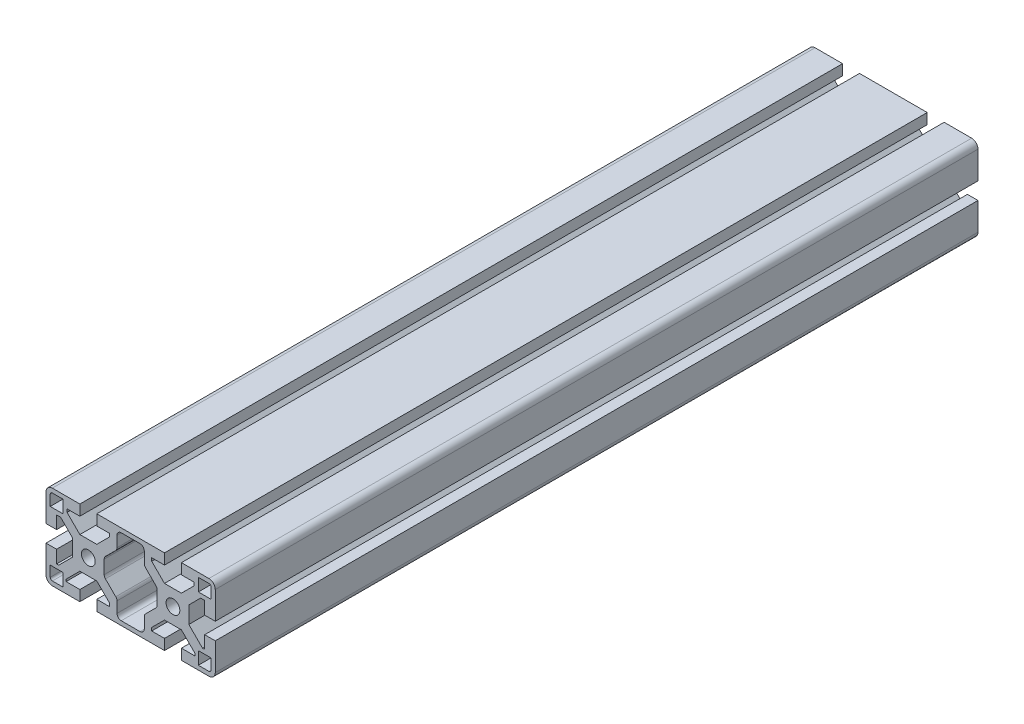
ISO-10303-21;
HEADER;
FILE_DESCRIPTION(('STEP AP214'),'2;1');
FILE_NAME('part.step','',(''),(''),'','','');
FILE_SCHEMA(('AUTOMOTIVE_DESIGN { 1 0 10303 214 1 1 1 1 }'));
ENDSEC;
DATA;
#1=APPLICATION_CONTEXT('core data for automotive mechanical design processes');
#2=APPLICATION_PROTOCOL_DEFINITION('international standard','automotive_design',2000,#1);
#3=PRODUCT_CONTEXT('',#1,'mechanical');
#4=PRODUCT('Part','Part','',(#3));
#5=PRODUCT_RELATED_PRODUCT_CATEGORY('part','',(#4));
#6=PRODUCT_DEFINITION_FORMATION('','',#4);
#7=PRODUCT_DEFINITION_CONTEXT('part definition',#1,'design');
#8=PRODUCT_DEFINITION('design','',#6,#7);
#9=PRODUCT_DEFINITION_SHAPE('','',#8);
#10=(LENGTH_UNIT() NAMED_UNIT(*) SI_UNIT(.MILLI.,.METRE.));
#11=(NAMED_UNIT(*) PLANE_ANGLE_UNIT() SI_UNIT($,.RADIAN.));
#12=(NAMED_UNIT(*) SI_UNIT($,.STERADIAN.) SOLID_ANGLE_UNIT());
#13=UNCERTAINTY_MEASURE_WITH_UNIT(LENGTH_MEASURE(1.E-05),#10,'distance_accuracy_value','');
#14=(GEOMETRIC_REPRESENTATION_CONTEXT(3) GLOBAL_UNCERTAINTY_ASSIGNED_CONTEXT((#13)) GLOBAL_UNIT_ASSIGNED_CONTEXT((#10,
#11,#12)) REPRESENTATION_CONTEXT('',''));
#15=CARTESIAN_POINT('',(0.,0.,0.));
#16=DIRECTION('',(0.,0.,1.));
#17=DIRECTION('',(1.,0.,0.));
#18=AXIS2_PLACEMENT_3D('',#15,#16,#17);
#19=CARTESIAN_POINT('',(57.,-17.,360.5));
#20=DIRECTION('',(0.,0.,1.));
#21=DIRECTION('',(1.,0.,0.));
#22=AXIS2_PLACEMENT_3D('',#19,#20,#21);
#23=PLANE('',#22);
#24=DIRECTION('',(0.,-1.,0.));
#25=VECTOR('',#24,1.);
#26=CARTESIAN_POINT('',(13.5499999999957,10.8784271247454,360.5));
#27=LINE('',#26,#25);
#28=CARTESIAN_POINT('',(13.5499999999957,16.,360.5));
#29=VERTEX_POINT('',#28);
#30=CARTESIAN_POINT('',(13.5499999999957,10.8784271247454,360.5));
#31=VERTEX_POINT('',#30);
#32=EDGE_CURVE('E727',#29,#31,#27,.T.);
#33=ORIENTED_EDGE('',*,*,#32,.F.);
#34=CARTESIAN_POINT('',(15.5499999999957,16.,360.5));
#35=DIRECTION('',(0.,0.,1.));
#36=DIRECTION('',(-1.,0.,0.));
#37=AXIS2_PLACEMENT_3D('',#34,#35,#36);
#38=CIRCLE('',#37,2.);
#39=CARTESIAN_POINT('',(15.5499999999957,18.,360.5));
#40=VERTEX_POINT('',#39);
#41=EDGE_CURVE('E719',#40,#29,#38,.T.);
#42=ORIENTED_EDGE('',*,*,#41,.F.);
#43=DIRECTION('',(-1.,0.,0.));
#44=VECTOR('',#43,1.);
#45=CARTESIAN_POINT('',(24.4500000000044,18.,360.5));
#46=LINE('',#45,#44);
#47=CARTESIAN_POINT('',(24.4500000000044,18.,360.5));
#48=VERTEX_POINT('',#47);
#49=EDGE_CURVE('E786',#48,#40,#46,.T.);
#50=ORIENTED_EDGE('',*,*,#49,.F.);
#51=CARTESIAN_POINT('',(24.4500000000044,16.,360.5));
#52=DIRECTION('',(0.,0.,1.));
#53=DIRECTION('',(1.,0.,0.));
#54=AXIS2_PLACEMENT_3D('',#51,#52,#53);
#55=CIRCLE('',#54,2.);
#56=CARTESIAN_POINT('',(26.4500000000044,16.,360.5));
#57=VERTEX_POINT('',#56);
#58=EDGE_CURVE('E784',#57,#48,#55,.T.);
#59=ORIENTED_EDGE('',*,*,#58,.F.);
#60=DIRECTION('',(0.,1.,0.));
#61=VECTOR('',#60,1.);
#62=CARTESIAN_POINT('',(26.4500000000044,10.8784271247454,360.5));
#63=LINE('',#62,#61);
#64=CARTESIAN_POINT('',(26.4500000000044,10.8784271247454,360.5));
#65=VERTEX_POINT('',#64);
#66=EDGE_CURVE('E782',#65,#57,#63,.T.);
#67=ORIENTED_EDGE('',*,*,#66,.F.);
#68=CARTESIAN_POINT('',(28.4500000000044,10.8784271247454,360.5));
#69=DIRECTION('',(0.,0.,-1.));
#70=DIRECTION('',(1.,0.,0.));
#71=AXIS2_PLACEMENT_3D('',#68,#69,#70);
#72=CIRCLE('',#71,2.);
#73=CARTESIAN_POINT('',(27.0357864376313,9.46421356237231,360.5));
#74=VERTEX_POINT('',#73);
#75=EDGE_CURVE('E780',#74,#65,#72,.T.);
#76=ORIENTED_EDGE('',*,*,#75,.F.);
#77=DIRECTION('',(-0.707106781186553,0.707106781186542,0.));
#78=VECTOR('',#77,1.);
#79=CARTESIAN_POINT('',(31.914213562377,4.58578643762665,360.5));
#80=LINE('',#79,#78);
#81=CARTESIAN_POINT('',(31.914213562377,4.58578643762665,360.5));
#82=VERTEX_POINT('',#81);
#83=EDGE_CURVE('E778',#82,#74,#80,.T.);
#84=ORIENTED_EDGE('',*,*,#83,.F.);
#85=CARTESIAN_POINT('',(30.500000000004,3.17157287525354,360.5));
#86=DIRECTION('',(0.,0.,1.));
#87=DIRECTION('',(1.,0.,0.));
#88=AXIS2_PLACEMENT_3D('',#85,#86,#87);
#89=CIRCLE('',#88,2.);
#90=CARTESIAN_POINT('',(32.500000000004,3.17157287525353,360.5));
#91=VERTEX_POINT('',#90);
#92=EDGE_CURVE('E776',#91,#82,#89,.T.);
#93=ORIENTED_EDGE('',*,*,#92,.F.);
#94=DIRECTION('',(0.,1.,0.));
#95=VECTOR('',#94,1.);
#96=CARTESIAN_POINT('',(32.500000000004,-3.17157287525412,360.5));
#97=LINE('',#96,#95);
#98=CARTESIAN_POINT('',(32.500000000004,-3.17157287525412,360.5));
#99=VERTEX_POINT('',#98);
#100=EDGE_CURVE('E774',#99,#91,#97,.T.);
#101=ORIENTED_EDGE('',*,*,#100,.F.);
#102=CARTESIAN_POINT('',(30.500000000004,-3.17157287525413,360.5));
#103=DIRECTION('',(0.,0.,1.));
#104=DIRECTION('',(-1.,0.,0.));
#105=AXIS2_PLACEMENT_3D('',#102,#103,#104);
#106=CIRCLE('',#105,2.);
#107=CARTESIAN_POINT('',(31.9142135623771,-4.58578643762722,360.5));
#108=VERTEX_POINT('',#107);
#109=EDGE_CURVE('E772',#108,#99,#106,.T.);
#110=ORIENTED_EDGE('',*,*,#109,.F.);
#111=DIRECTION('',(0.707106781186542,0.707106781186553,0.));
#112=VECTOR('',#111,1.);
#113=CARTESIAN_POINT('',(31.9142135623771,-4.58578643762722,360.5));
#114=LINE('',#113,#112);
#115=CARTESIAN_POINT('',(27.0357864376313,-9.46421356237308,360.5));
#116=VERTEX_POINT('',#115);
#117=EDGE_CURVE('E770',#116,#108,#114,.T.);
#118=ORIENTED_EDGE('',*,*,#117,.F.);
#119=CARTESIAN_POINT('',(28.4500000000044,-10.8784271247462,360.5));
#120=DIRECTION('',(0.,0.,-1.));
#121=DIRECTION('',(-1.,0.,0.));
#122=AXIS2_PLACEMENT_3D('',#119,#120,#121);
#123=CIRCLE('',#122,2.);
#124=CARTESIAN_POINT('',(26.4500000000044,-10.8784271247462,360.5));
#125=VERTEX_POINT('',#124);
#126=EDGE_CURVE('E768',#125,#116,#123,.T.);
#127=ORIENTED_EDGE('',*,*,#126,.F.);
#128=DIRECTION('',(0.,1.,0.));
#129=VECTOR('',#128,1.);
#130=CARTESIAN_POINT('',(26.4500000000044,-10.8784271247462,360.5));
#131=LINE('',#130,#129);
#132=CARTESIAN_POINT('',(26.4500000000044,-16.,360.5));
#133=VERTEX_POINT('',#132);
#134=EDGE_CURVE('E766',#133,#125,#131,.T.);
#135=ORIENTED_EDGE('',*,*,#134,.F.);
#136=CARTESIAN_POINT('',(24.4500000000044,-16.,360.5));
#137=DIRECTION('',(0.,0.,1.));
#138=DIRECTION('',(-1.,0.,0.));
#139=AXIS2_PLACEMENT_3D('',#136,#137,#138);
#140=CIRCLE('',#139,2.);
#141=CARTESIAN_POINT('',(24.4500000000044,-18.,360.5));
#142=VERTEX_POINT('',#141);
#143=EDGE_CURVE('E764',#142,#133,#140,.T.);
#144=ORIENTED_EDGE('',*,*,#143,.F.);
#145=DIRECTION('',(1.,0.,0.));
#146=VECTOR('',#145,1.);
#147=CARTESIAN_POINT('',(24.4500000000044,-18.,360.5));
#148=LINE('',#147,#146);
#149=CARTESIAN_POINT('',(15.5499999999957,-18.,360.5));
#150=VERTEX_POINT('',#149);
#151=EDGE_CURVE('E762',#150,#142,#148,.T.);
#152=ORIENTED_EDGE('',*,*,#151,.F.);
#153=CARTESIAN_POINT('',(15.5499999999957,-16.,360.5));
#154=DIRECTION('',(0.,0.,1.));
#155=DIRECTION('',(-1.,0.,0.));
#156=AXIS2_PLACEMENT_3D('',#153,#154,#155);
#157=CIRCLE('',#156,2.);
#158=CARTESIAN_POINT('',(13.5499999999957,-16.,360.5));
#159=VERTEX_POINT('',#158);
#160=EDGE_CURVE('E760',#159,#150,#157,.T.);
#161=ORIENTED_EDGE('',*,*,#160,.F.);
#162=DIRECTION('',(0.,-1.,0.));
#163=VECTOR('',#162,1.);
#164=CARTESIAN_POINT('',(13.5499999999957,-10.8784271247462,360.5));
#165=LINE('',#164,#163);
#166=CARTESIAN_POINT('',(13.5499999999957,-10.8784271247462,360.5));
#167=VERTEX_POINT('',#166);
#168=EDGE_CURVE('E758',#167,#159,#165,.T.);
#169=ORIENTED_EDGE('',*,*,#168,.F.);
#170=CARTESIAN_POINT('',(11.5499999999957,-10.8784271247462,360.5));
#171=DIRECTION('',(0.,0.,-1.));
#172=DIRECTION('',(1.,0.,0.));
#173=AXIS2_PLACEMENT_3D('',#170,#171,#172);
#174=CIRCLE('',#173,2.);
#175=CARTESIAN_POINT('',(12.9642135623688,-9.4642135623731,360.5));
#176=VERTEX_POINT('',#175);
#177=EDGE_CURVE('E756',#176,#167,#174,.T.);
#178=ORIENTED_EDGE('',*,*,#177,.F.);
#179=DIRECTION('',(0.707106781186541,-0.707106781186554,0.));
#180=VECTOR('',#179,1.);
#181=CARTESIAN_POINT('',(8.085786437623,-4.58578643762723,360.5));
#182=LINE('',#181,#180);
#183=CARTESIAN_POINT('',(8.085786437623,-4.58578643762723,360.5));
#184=VERTEX_POINT('',#183);
#185=EDGE_CURVE('E754',#184,#176,#182,.T.);
#186=ORIENTED_EDGE('',*,*,#185,.F.);
#187=CARTESIAN_POINT('',(9.4999999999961,-3.17157287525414,360.5));
#188=DIRECTION('',(0.,0.,1.));
#189=DIRECTION('',(-1.,0.,0.));
#190=AXIS2_PLACEMENT_3D('',#187,#188,#189);
#191=CIRCLE('',#190,2.);
#192=CARTESIAN_POINT('',(7.49999999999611,-3.17157287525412,360.5));
#193=VERTEX_POINT('',#192);
#194=EDGE_CURVE('E752',#193,#184,#191,.T.);
#195=ORIENTED_EDGE('',*,*,#194,.F.);
#196=DIRECTION('',(0.,-1.,0.));
#197=VECTOR('',#196,1.);
#198=CARTESIAN_POINT('',(7.49999999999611,-3.17157287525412,360.5));
#199=LINE('',#198,#197);
#200=CARTESIAN_POINT('',(7.49999999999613,3.17157287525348,360.5));
#201=VERTEX_POINT('',#200);
#202=EDGE_CURVE('E750',#201,#193,#199,.T.);
#203=ORIENTED_EDGE('',*,*,#202,.F.);
#204=CARTESIAN_POINT('',(9.4999999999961,3.17157287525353,360.5));
#205=DIRECTION('',(0.,0.,1.));
#206=DIRECTION('',(-1.,0.,0.));
#207=AXIS2_PLACEMENT_3D('',#204,#205,#206);
#208=CIRCLE('',#207,1.99999999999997);
#209=CARTESIAN_POINT('',(8.08578643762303,4.58578643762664,360.5));
#210=VERTEX_POINT('',#209);
#211=EDGE_CURVE('E748',#210,#201,#208,.T.);
#212=ORIENTED_EDGE('',*,*,#211,.F.);
#213=DIRECTION('',(-0.707106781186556,-0.707106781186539,0.));
#214=VECTOR('',#213,1.);
#215=CARTESIAN_POINT('',(8.08578643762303,4.58578643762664,360.5));
#216=LINE('',#215,#214);
#217=CARTESIAN_POINT('',(12.9642135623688,9.46421356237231,360.5));
#218=VERTEX_POINT('',#217);
#219=EDGE_CURVE('E743',#218,#210,#216,.T.);
#220=ORIENTED_EDGE('',*,*,#219,.F.);
#221=CARTESIAN_POINT('',(11.5499999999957,10.8784271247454,360.5));
#222=DIRECTION('',(0.,0.,-1.));
#223=DIRECTION('',(1.,0.,0.));
#224=AXIS2_PLACEMENT_3D('',#221,#222,#223);
#225=CIRCLE('',#224,2.00000000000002);
#226=EDGE_CURVE('E741',#31,#218,#225,.T.);
#227=ORIENTED_EDGE('',*,*,#226,.F.);
#228=EDGE_LOOP('',(#33,#42,#50,#59,#67,#76,#84,#93,#101,#110,#118,#127,#135,#144,#152,#161,#169,
#178,#186,#195,#203,#212,#220,#227));
#229=FACE_BOUND('',#228,.T.);
#230=DIRECTION('',(0.,1.,0.));
#231=VECTOR('',#230,1.);
#232=CARTESIAN_POINT('',(58.,-17.,360.5));
#233=LINE('',#232,#231);
#234=CARTESIAN_POINT('',(58.,-17.,360.5));
#235=VERTEX_POINT('',#234);
#236=CARTESIAN_POINT('',(58.,-12.,360.5));
#237=VERTEX_POINT('',#236);
#238=EDGE_CURVE('E939',#235,#237,#233,.T.);
#239=ORIENTED_EDGE('',*,*,#238,.F.);
#240=CARTESIAN_POINT('',(57.,-17.,360.5));
#241=DIRECTION('',(0.,0.,1.));
#242=DIRECTION('',(-1.,0.,0.));
#243=AXIS2_PLACEMENT_3D('',#240,#241,#242);
#244=CIRCLE('',#243,0.999999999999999);
#245=CARTESIAN_POINT('',(57.,-18.,360.5));
#246=VERTEX_POINT('',#245);
#247=EDGE_CURVE('E937',#246,#235,#244,.T.);
#248=ORIENTED_EDGE('',*,*,#247,.F.);
#249=DIRECTION('',(1.,0.,0.));
#250=VECTOR('',#249,1.);
#251=CARTESIAN_POINT('',(57.,-18.,360.5));
#252=LINE('',#251,#250);
#253=CARTESIAN_POINT('',(52.0000000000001,-18.,360.5));
#254=VERTEX_POINT('',#253);
#255=EDGE_CURVE('E947',#254,#246,#252,.T.);
#256=ORIENTED_EDGE('',*,*,#255,.F.);
#257=DIRECTION('',(0.,-1.,0.));
#258=VECTOR('',#257,1.);
#259=CARTESIAN_POINT('',(52.0000000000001,-18.,360.5));
#260=LINE('',#259,#258);
#261=CARTESIAN_POINT('',(52.0000000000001,-12.,360.5));
#262=VERTEX_POINT('',#261);
#263=EDGE_CURVE('E944',#262,#254,#260,.T.);
#264=ORIENTED_EDGE('',*,*,#263,.F.);
#265=DIRECTION('',(-1.,0.,0.));
#266=VECTOR('',#265,1.);
#267=CARTESIAN_POINT('',(58.,-12.,360.5));
#268=LINE('',#267,#266);
#269=EDGE_CURVE('E942',#237,#262,#268,.T.);
#270=ORIENTED_EDGE('',*,*,#269,.F.);
#271=EDGE_LOOP('',(#239,#248,#256,#264,#270));
#272=FACE_BOUND('',#271,.T.);
#273=DIRECTION('',(-1.,0.,0.));
#274=VECTOR('',#273,1.);
#275=CARTESIAN_POINT('',(-18.,-12.,360.5));
#276=LINE('',#275,#274);
#277=CARTESIAN_POINT('',(-12.,-12.,360.5));
#278=VERTEX_POINT('',#277);
#279=CARTESIAN_POINT('',(-18.,-12.,360.5));
#280=VERTEX_POINT('',#279);
#281=EDGE_CURVE('E983',#278,#280,#276,.T.);
#282=ORIENTED_EDGE('',*,*,#281,.F.);
#283=DIRECTION('',(0.,1.,0.));
#284=VECTOR('',#283,1.);
#285=CARTESIAN_POINT('',(-12.,-18.,360.5));
#286=LINE('',#285,#284);
#287=CARTESIAN_POINT('',(-12.,-18.,360.5));
#288=VERTEX_POINT('',#287);
#289=EDGE_CURVE('E981',#288,#278,#286,.T.);
#290=ORIENTED_EDGE('',*,*,#289,.F.);
#291=DIRECTION('',(1.,0.,0.));
#292=VECTOR('',#291,1.);
#293=CARTESIAN_POINT('',(-17.,-18.,360.5));
#294=LINE('',#293,#292);
#295=CARTESIAN_POINT('',(-17.,-18.,360.5));
#296=VERTEX_POINT('',#295);
#297=EDGE_CURVE('E991',#296,#288,#294,.T.);
#298=ORIENTED_EDGE('',*,*,#297,.F.);
#299=CARTESIAN_POINT('',(-17.,-17.,360.5));
#300=DIRECTION('',(0.,0.,1.));
#301=DIRECTION('',(1.,0.,0.));
#302=AXIS2_PLACEMENT_3D('',#299,#300,#301);
#303=CIRCLE('',#302,1.);
#304=CARTESIAN_POINT('',(-18.,-17.,360.5));
#305=VERTEX_POINT('',#304);
#306=EDGE_CURVE('E988',#305,#296,#303,.T.);
#307=ORIENTED_EDGE('',*,*,#306,.F.);
#308=DIRECTION('',(0.,-1.,0.));
#309=VECTOR('',#308,1.);
#310=CARTESIAN_POINT('',(-18.,-17.,360.5));
#311=LINE('',#310,#309);
#312=EDGE_CURVE('E986',#280,#305,#311,.T.);
#313=ORIENTED_EDGE('',*,*,#312,.F.);
#314=EDGE_LOOP('',(#282,#290,#298,#307,#313));
#315=FACE_BOUND('',#314,.T.);
#316=CARTESIAN_POINT('',(57.,-17.,360.5));
#317=DIRECTION('',(0.,0.,1.));
#318=DIRECTION('',(1.,0.,0.));
#319=AXIS2_PLACEMENT_3D('',#316,#317,#318);
#320=CIRCLE('',#319,3.);
#321=CARTESIAN_POINT('',(57.,-20.,360.5));
#322=VERTEX_POINT('',#321);
#323=CARTESIAN_POINT('',(60.0000000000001,-17.,360.5));
#324=VERTEX_POINT('',#323);
#325=EDGE_CURVE('E1057',#322,#324,#320,.T.);
#326=ORIENTED_EDGE('',*,*,#325,.T.);
#327=DIRECTION('',(0.,1.,0.));
#328=VECTOR('',#327,1.);
#329=CARTESIAN_POINT('',(60.0000000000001,-17.,360.5));
#330=LINE('',#329,#328);
#331=CARTESIAN_POINT('',(60.0000000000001,-4.00000000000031,360.5));
#332=VERTEX_POINT('',#331);
#333=EDGE_CURVE('E1060',#324,#332,#330,.T.);
#334=ORIENTED_EDGE('',*,*,#333,.T.);
#335=DIRECTION('',(-1.,0.,0.));
#336=VECTOR('',#335,1.);
#337=CARTESIAN_POINT('',(60.0000000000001,-4.00000000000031,360.5));
#338=LINE('',#337,#336);
#339=CARTESIAN_POINT('',(55.0000000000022,-4.00000000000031,360.5));
#340=VERTEX_POINT('',#339);
#341=EDGE_CURVE('E1063',#332,#340,#338,.T.);
#342=ORIENTED_EDGE('',*,*,#341,.T.);
#343=DIRECTION('',(0.,-1.,0.));
#344=VECTOR('',#343,1.);
#345=CARTESIAN_POINT('',(55.0000000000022,-10.05,360.5));
#346=LINE('',#345,#344);
#347=CARTESIAN_POINT('',(55.0000000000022,-10.05,360.5));
#348=VERTEX_POINT('',#347);
#349=EDGE_CURVE('E1065',#340,#348,#346,.T.);
#350=ORIENTED_EDGE('',*,*,#349,.T.);
#351=DIRECTION('',(-1.,0.,0.));
#352=VECTOR('',#351,1.);
#353=CARTESIAN_POINT('',(55.0000000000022,-10.05,360.5));
#354=LINE('',#353,#352);
#355=CARTESIAN_POINT('',(53.9999999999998,-10.05,360.5));
#356=VERTEX_POINT('',#355);
#357=EDGE_CURVE('E1067',#348,#356,#354,.T.);
#358=ORIENTED_EDGE('',*,*,#357,.T.);
#359=DIRECTION('',(-0.70710678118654,0.707106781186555,0.));
#360=VECTOR('',#359,1.);
#361=CARTESIAN_POINT('',(47.5,-3.55000000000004,360.5));
#362=LINE('',#361,#360);
#363=CARTESIAN_POINT('',(47.5,-3.55000000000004,360.5));
#364=VERTEX_POINT('',#363);
#365=EDGE_CURVE('E1069',#356,#364,#362,.T.);
#366=ORIENTED_EDGE('',*,*,#365,.T.);
#367=DIRECTION('',(0.,1.,0.));
#368=VECTOR('',#367,1.);
#369=CARTESIAN_POINT('',(47.5,-3.55000000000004,360.5));
#370=LINE('',#369,#368);
#371=CARTESIAN_POINT('',(47.5,4.44999999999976,360.5));
#372=VERTEX_POINT('',#371);
#373=EDGE_CURVE('E1071',#364,#372,#370,.T.);
#374=ORIENTED_EDGE('',*,*,#373,.T.);
#375=DIRECTION('',(0.707106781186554,0.707106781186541,0.));
#376=VECTOR('',#375,1.);
#377=CARTESIAN_POINT('',(47.5,4.44999999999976,360.5));
#378=LINE('',#377,#376);
#379=CARTESIAN_POINT('',(53.0999999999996,10.0499999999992,360.5));
#380=VERTEX_POINT('',#379);
#381=EDGE_CURVE('E1073',#372,#380,#378,.T.);
#382=ORIENTED_EDGE('',*,*,#381,.T.);
#383=DIRECTION('',(1.,0.,0.));
#384=VECTOR('',#383,1.);
#385=CARTESIAN_POINT('',(55.0000000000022,10.0499999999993,360.5));
#386=LINE('',#385,#384);
#387=CARTESIAN_POINT('',(55.0000000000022,10.0499999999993,360.5));
#388=VERTEX_POINT('',#387);
#389=EDGE_CURVE('E1075',#380,#388,#386,.T.);
#390=ORIENTED_EDGE('',*,*,#389,.T.);
#391=DIRECTION('',(0.,-1.,0.));
#392=VECTOR('',#391,1.);
#393=CARTESIAN_POINT('',(55.0000000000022,3.99999999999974,360.5));
#394=LINE('',#393,#392);
#395=CARTESIAN_POINT('',(55.0000000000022,3.99999999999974,360.5));
#396=VERTEX_POINT('',#395);
#397=EDGE_CURVE('E1077',#388,#396,#394,.T.);
#398=ORIENTED_EDGE('',*,*,#397,.T.);
#399=DIRECTION('',(1.,0.,0.));
#400=VECTOR('',#399,1.);
#401=CARTESIAN_POINT('',(60.0000000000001,3.99999999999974,360.5));
#402=LINE('',#401,#400);
#403=CARTESIAN_POINT('',(60.0000000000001,3.99999999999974,360.5));
#404=VERTEX_POINT('',#403);
#405=EDGE_CURVE('E1079',#396,#404,#402,.T.);
#406=ORIENTED_EDGE('',*,*,#405,.T.);
#407=DIRECTION('',(0.,1.,0.));
#408=VECTOR('',#407,1.);
#409=CARTESIAN_POINT('',(60.0000000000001,3.99999999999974,360.5));
#410=LINE('',#409,#408);
#411=CARTESIAN_POINT('',(60.0000000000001,17.,360.5));
#412=VERTEX_POINT('',#411);
#413=EDGE_CURVE('E1081',#404,#412,#410,.T.);
#414=ORIENTED_EDGE('',*,*,#413,.T.);
#415=CARTESIAN_POINT('',(57.,17.,360.5));
#416=DIRECTION('',(0.,0.,1.));
#417=DIRECTION('',(1.,0.,0.));
#418=AXIS2_PLACEMENT_3D('',#415,#416,#417);
#419=CIRCLE('',#418,3.);
#420=CARTESIAN_POINT('',(57.,20.,360.5));
#421=VERTEX_POINT('',#420);
#422=EDGE_CURVE('E1083',#412,#421,#419,.T.);
#423=ORIENTED_EDGE('',*,*,#422,.T.);
#424=DIRECTION('',(-1.,0.,0.));
#425=VECTOR('',#424,1.);
#426=CARTESIAN_POINT('',(57.,20.,360.5));
#427=LINE('',#426,#425);
#428=CARTESIAN_POINT('',(44.,20.,360.5));
#429=VERTEX_POINT('',#428);
#430=EDGE_CURVE('E1085',#421,#429,#427,.T.);
#431=ORIENTED_EDGE('',*,*,#430,.T.);
#432=DIRECTION('',(0.,-1.,0.));
#433=VECTOR('',#432,1.);
#434=CARTESIAN_POINT('',(44.,20.,360.5));
#435=LINE('',#434,#433);
#436=CARTESIAN_POINT('',(44.,15.,360.5));
#437=VERTEX_POINT('',#436);
#438=EDGE_CURVE('E1087',#429,#437,#435,.T.);
#439=ORIENTED_EDGE('',*,*,#438,.T.);
#440=DIRECTION('',(1.,0.,0.));
#441=VECTOR('',#440,1.);
#442=CARTESIAN_POINT('',(50.0628752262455,15.,360.5));
#443=LINE('',#442,#441);
#444=CARTESIAN_POINT('',(50.0628752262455,15.,360.5));
#445=VERTEX_POINT('',#444);
#446=EDGE_CURVE('E1089',#437,#445,#443,.T.);
#447=ORIENTED_EDGE('',*,*,#446,.T.);
#448=DIRECTION('',(0.,-1.,0.));
#449=VECTOR('',#448,1.);
#450=CARTESIAN_POINT('',(50.0628752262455,13.5499999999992,360.5));
#451=LINE('',#450,#449);
#452=CARTESIAN_POINT('',(50.0628752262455,13.5499999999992,360.5));
#453=VERTEX_POINT('',#452);
#454=EDGE_CURVE('E1091',#445,#453,#451,.T.);
#455=ORIENTED_EDGE('',*,*,#454,.T.);
#456=DIRECTION('',(-0.707857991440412,-0.706354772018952,0.));
#457=VECTOR('',#456,1.);
#458=CARTESIAN_POINT('',(50.0628752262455,13.5499999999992,360.5));
#459=LINE('',#458,#457);
#460=CARTESIAN_POINT('',(44.,7.50000000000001,360.5));
#461=VERTEX_POINT('',#460);
#462=EDGE_CURVE('E1093',#453,#461,#459,.T.);
#463=ORIENTED_EDGE('',*,*,#462,.T.);
#464=DIRECTION('',(-1.,0.,0.));
#465=VECTOR('',#464,1.);
#466=CARTESIAN_POINT('',(44.,7.50000000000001,360.5));
#467=LINE('',#466,#465);
#468=CARTESIAN_POINT('',(36.,7.50000000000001,360.5));
#469=VERTEX_POINT('',#468);
#470=EDGE_CURVE('E1095',#461,#469,#467,.T.);
#471=ORIENTED_EDGE('',*,*,#470,.T.);
#472=DIRECTION('',(-0.707106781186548,0.707106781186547,0.));
#473=VECTOR('',#472,1.);
#474=CARTESIAN_POINT('',(36.,7.50000000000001,360.5));
#475=LINE('',#474,#473);
#476=CARTESIAN_POINT('',(29.9500000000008,13.5499999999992,360.5));
#477=VERTEX_POINT('',#476);
#478=EDGE_CURVE('E1097',#469,#477,#475,.T.);
#479=ORIENTED_EDGE('',*,*,#478,.T.);
#480=DIRECTION('',(0.,1.,0.));
#481=VECTOR('',#480,1.);
#482=CARTESIAN_POINT('',(29.9500000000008,13.5499999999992,360.5));
#483=LINE('',#482,#481);
#484=CARTESIAN_POINT('',(29.9500000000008,15.,360.5));
#485=VERTEX_POINT('',#484);
#486=EDGE_CURVE('E1099',#477,#485,#483,.T.);
#487=ORIENTED_EDGE('',*,*,#486,.T.);
#488=DIRECTION('',(1.,0.,0.));
#489=VECTOR('',#488,1.);
#490=CARTESIAN_POINT('',(36.,15.,360.5));
#491=LINE('',#490,#489);
#492=CARTESIAN_POINT('',(36.,15.,360.5));
#493=VERTEX_POINT('',#492);
#494=EDGE_CURVE('E1101',#485,#493,#491,.T.);
#495=ORIENTED_EDGE('',*,*,#494,.T.);
#496=DIRECTION('',(0.,1.,0.));
#497=VECTOR('',#496,1.);
#498=CARTESIAN_POINT('',(36.,20.,360.5));
#499=LINE('',#498,#497);
#500=CARTESIAN_POINT('',(36.,20.,360.5));
#501=VERTEX_POINT('',#500);
#502=EDGE_CURVE('E1103',#493,#501,#499,.T.);
#503=ORIENTED_EDGE('',*,*,#502,.T.);
#504=DIRECTION('',(-1.,0.,0.));
#505=VECTOR('',#504,1.);
#506=CARTESIAN_POINT('',(4.00000000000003,20.,360.5));
#507=LINE('',#506,#505);
#508=CARTESIAN_POINT('',(4.00000000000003,20.,360.5));
#509=VERTEX_POINT('',#508);
#510=EDGE_CURVE('E1105',#501,#509,#507,.T.);
#511=ORIENTED_EDGE('',*,*,#510,.T.);
#512=DIRECTION('',(0.,-1.,0.));
#513=VECTOR('',#512,1.);
#514=CARTESIAN_POINT('',(4.00000000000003,20.,360.5));
#515=LINE('',#514,#513);
#516=CARTESIAN_POINT('',(4.00000000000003,15.,360.5));
#517=VERTEX_POINT('',#516);
#518=EDGE_CURVE('E1107',#509,#517,#515,.T.);
#519=ORIENTED_EDGE('',*,*,#518,.T.);
#520=DIRECTION('',(1.,0.,0.));
#521=VECTOR('',#520,1.);
#522=CARTESIAN_POINT('',(4.00000000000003,15.,360.5));
#523=LINE('',#522,#521);
#524=CARTESIAN_POINT('',(10.0499999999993,15.,360.5));
#525=VERTEX_POINT('',#524);
#526=EDGE_CURVE('E1109',#517,#525,#523,.T.);
#527=ORIENTED_EDGE('',*,*,#526,.T.);
#528=DIRECTION('',(0.,-1.,0.));
#529=VECTOR('',#528,1.);
#530=CARTESIAN_POINT('',(10.0499999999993,13.5499999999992,360.5));
#531=LINE('',#530,#529);
#532=CARTESIAN_POINT('',(10.0499999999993,13.5499999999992,360.5));
#533=VERTEX_POINT('',#532);
#534=EDGE_CURVE('E1111',#525,#533,#531,.T.);
#535=ORIENTED_EDGE('',*,*,#534,.T.);
#536=DIRECTION('',(-0.707106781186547,-0.707106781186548,0.));
#537=VECTOR('',#536,1.);
#538=CARTESIAN_POINT('',(4.00000000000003,7.5,360.5));
#539=LINE('',#538,#537);
#540=CARTESIAN_POINT('',(4.00000000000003,7.5,360.5));
#541=VERTEX_POINT('',#540);
#542=EDGE_CURVE('E1113',#533,#541,#539,.T.);
#543=ORIENTED_EDGE('',*,*,#542,.T.);
#544=DIRECTION('',(-1.,0.,0.));
#545=VECTOR('',#544,1.);
#546=CARTESIAN_POINT('',(-3.99999999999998,7.5,360.5));
#547=LINE('',#546,#545);
#548=CARTESIAN_POINT('',(-3.99999999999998,7.5,360.5));
#549=VERTEX_POINT('',#548);
#550=EDGE_CURVE('E1115',#541,#549,#547,.T.);
#551=ORIENTED_EDGE('',*,*,#550,.T.);
#552=DIRECTION('',(-0.707857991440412,0.706354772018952,0.));
#553=VECTOR('',#552,1.);
#554=CARTESIAN_POINT('',(-10.0628752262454,13.5499999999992,360.5));
#555=LINE('',#554,#553);
#556=CARTESIAN_POINT('',(-10.0628752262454,13.5499999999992,360.5));
#557=VERTEX_POINT('',#556);
#558=EDGE_CURVE('E1117',#549,#557,#555,.T.);
#559=ORIENTED_EDGE('',*,*,#558,.T.);
#560=DIRECTION('',(0.,1.,0.));
#561=VECTOR('',#560,1.);
#562=CARTESIAN_POINT('',(-10.0628752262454,13.5499999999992,360.5));
#563=LINE('',#562,#561);
#564=CARTESIAN_POINT('',(-10.0628752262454,15.,360.5));
#565=VERTEX_POINT('',#564);
#566=EDGE_CURVE('E1119',#557,#565,#563,.T.);
#567=ORIENTED_EDGE('',*,*,#566,.T.);
#568=DIRECTION('',(1.,0.,0.));
#569=VECTOR('',#568,1.);
#570=CARTESIAN_POINT('',(-10.0628752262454,15.,360.5));
#571=LINE('',#570,#569);
#572=CARTESIAN_POINT('',(-3.99999999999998,15.,360.5));
#573=VERTEX_POINT('',#572);
#574=EDGE_CURVE('E1121',#565,#573,#571,.T.);
#575=ORIENTED_EDGE('',*,*,#574,.T.);
#576=DIRECTION('',(0.,1.,0.));
#577=VECTOR('',#576,1.);
#578=CARTESIAN_POINT('',(-3.99999999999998,20.,360.5));
#579=LINE('',#578,#577);
#580=CARTESIAN_POINT('',(-3.99999999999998,20.,360.5));
#581=VERTEX_POINT('',#580);
#582=EDGE_CURVE('E1123',#573,#581,#579,.T.);
#583=ORIENTED_EDGE('',*,*,#582,.T.);
#584=DIRECTION('',(-1.,0.,0.));
#585=VECTOR('',#584,1.);
#586=CARTESIAN_POINT('',(-17.,20.,360.5));
#587=LINE('',#586,#585);
#588=CARTESIAN_POINT('',(-17.,20.,360.5));
#589=VERTEX_POINT('',#588);
#590=EDGE_CURVE('E1125',#581,#589,#587,.T.);
#591=ORIENTED_EDGE('',*,*,#590,.T.);
#592=CARTESIAN_POINT('',(-17.,17.,360.5));
#593=DIRECTION('',(0.,0.,1.));
#594=DIRECTION('',(-1.,0.,0.));
#595=AXIS2_PLACEMENT_3D('',#592,#593,#594);
#596=CIRCLE('',#595,3.);
#597=CARTESIAN_POINT('',(-20.,17.,360.5));
#598=VERTEX_POINT('',#597);
#599=EDGE_CURVE('E1127',#589,#598,#596,.T.);
#600=ORIENTED_EDGE('',*,*,#599,.T.);
#601=DIRECTION('',(0.,-1.,0.));
#602=VECTOR('',#601,1.);
#603=CARTESIAN_POINT('',(-20.,3.99999999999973,360.5));
#604=LINE('',#603,#602);
#605=CARTESIAN_POINT('',(-20.,3.99999999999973,360.5));
#606=VERTEX_POINT('',#605);
#607=EDGE_CURVE('E1129',#598,#606,#604,.T.);
#608=ORIENTED_EDGE('',*,*,#607,.T.);
#609=DIRECTION('',(1.,0.,0.));
#610=VECTOR('',#609,1.);
#611=CARTESIAN_POINT('',(-20.,3.99999999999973,360.5));
#612=LINE('',#611,#610);
#613=CARTESIAN_POINT('',(-15.0000000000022,3.99999999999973,360.5));
#614=VERTEX_POINT('',#613);
#615=EDGE_CURVE('E1131',#606,#614,#612,.T.);
#616=ORIENTED_EDGE('',*,*,#615,.T.);
#617=DIRECTION('',(0.,1.,0.));
#618=VECTOR('',#617,1.);
#619=CARTESIAN_POINT('',(-15.0000000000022,3.99999999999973,360.5));
#620=LINE('',#619,#618);
#621=CARTESIAN_POINT('',(-15.0000000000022,10.0499999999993,360.5));
#622=VERTEX_POINT('',#621);
#623=EDGE_CURVE('E1133',#614,#622,#620,.T.);
#624=ORIENTED_EDGE('',*,*,#623,.T.);
#625=DIRECTION('',(1.,0.,0.));
#626=VECTOR('',#625,1.);
#627=CARTESIAN_POINT('',(-15.0000000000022,10.0499999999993,360.5));
#628=LINE('',#627,#626);
#629=CARTESIAN_POINT('',(-13.0999999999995,10.0499999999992,360.5));
#630=VERTEX_POINT('',#629);
#631=EDGE_CURVE('E1135',#622,#630,#628,.T.);
#632=ORIENTED_EDGE('',*,*,#631,.T.);
#633=DIRECTION('',(0.707106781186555,-0.70710678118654,0.));
#634=VECTOR('',#633,1.);
#635=CARTESIAN_POINT('',(-7.49999999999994,4.44999999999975,360.5));
#636=LINE('',#635,#634);
#637=CARTESIAN_POINT('',(-7.49999999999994,4.44999999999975,360.5));
#638=VERTEX_POINT('',#637);
#639=EDGE_CURVE('E1137',#630,#638,#636,.T.);
#640=ORIENTED_EDGE('',*,*,#639,.T.);
#641=DIRECTION('',(0.,-1.,0.));
#642=VECTOR('',#641,1.);
#643=CARTESIAN_POINT('',(-7.49999999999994,-3.55000000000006,360.5));
#644=LINE('',#643,#642);
#645=CARTESIAN_POINT('',(-7.49999999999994,-3.55000000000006,360.5));
#646=VERTEX_POINT('',#645);
#647=EDGE_CURVE('E1139',#638,#646,#644,.T.);
#648=ORIENTED_EDGE('',*,*,#647,.T.);
#649=DIRECTION('',(-0.70710678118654,-0.707106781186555,0.));
#650=VECTOR('',#649,1.);
#651=CARTESIAN_POINT('',(-7.49999999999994,-3.55000000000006,360.5));
#652=LINE('',#651,#650);
#653=CARTESIAN_POINT('',(-13.9999999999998,-10.05,360.5));
#654=VERTEX_POINT('',#653);
#655=EDGE_CURVE('E1141',#646,#654,#652,.T.);
#656=ORIENTED_EDGE('',*,*,#655,.T.);
#657=DIRECTION('',(-1.,0.,0.));
#658=VECTOR('',#657,1.);
#659=CARTESIAN_POINT('',(-15.0000000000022,-10.05,360.5));
#660=LINE('',#659,#658);
#661=CARTESIAN_POINT('',(-15.0000000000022,-10.05,360.5));
#662=VERTEX_POINT('',#661);
#663=EDGE_CURVE('E1143',#654,#662,#660,.T.);
#664=ORIENTED_EDGE('',*,*,#663,.T.);
#665=DIRECTION('',(0.,1.,0.));
#666=VECTOR('',#665,1.);
#667=CARTESIAN_POINT('',(-15.0000000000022,-10.05,360.5));
#668=LINE('',#667,#666);
#669=CARTESIAN_POINT('',(-15.0000000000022,-4.00000000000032,360.5));
#670=VERTEX_POINT('',#669);
#671=EDGE_CURVE('E1145',#662,#670,#668,.T.);
#672=ORIENTED_EDGE('',*,*,#671,.T.);
#673=DIRECTION('',(-1.,0.,0.));
#674=VECTOR('',#673,1.);
#675=CARTESIAN_POINT('',(-20.,-4.00000000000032,360.5));
#676=LINE('',#675,#674);
#677=CARTESIAN_POINT('',(-20.,-4.00000000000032,360.5));
#678=VERTEX_POINT('',#677);
#679=EDGE_CURVE('E1147',#670,#678,#676,.T.);
#680=ORIENTED_EDGE('',*,*,#679,.T.);
#681=DIRECTION('',(0.,-1.,0.));
#682=VECTOR('',#681,1.);
#683=CARTESIAN_POINT('',(-20.,-17.,360.5));
#684=LINE('',#683,#682);
#685=CARTESIAN_POINT('',(-20.,-17.,360.5));
#686=VERTEX_POINT('',#685);
#687=EDGE_CURVE('E1149',#678,#686,#684,.T.);
#688=ORIENTED_EDGE('',*,*,#687,.T.);
#689=CARTESIAN_POINT('',(-17.,-17.,360.5));
#690=DIRECTION('',(0.,0.,1.));
#691=DIRECTION('',(-1.,0.,0.));
#692=AXIS2_PLACEMENT_3D('',#689,#690,#691);
#693=CIRCLE('',#692,3.);
#694=CARTESIAN_POINT('',(-17.,-20.,360.5));
#695=VERTEX_POINT('',#694);
#696=EDGE_CURVE('E1151',#686,#695,#693,.T.);
#697=ORIENTED_EDGE('',*,*,#696,.T.);
#698=DIRECTION('',(1.,0.,0.));
#699=VECTOR('',#698,1.);
#700=CARTESIAN_POINT('',(-17.,-20.,360.5));
#701=LINE('',#700,#699);
#702=CARTESIAN_POINT('',(-4.,-20.,360.5));
#703=VERTEX_POINT('',#702);
#704=EDGE_CURVE('E1153',#695,#703,#701,.T.);
#705=ORIENTED_EDGE('',*,*,#704,.T.);
#706=DIRECTION('',(0.,1.,0.));
#707=VECTOR('',#706,1.);
#708=CARTESIAN_POINT('',(-4.,-20.,360.5));
#709=LINE('',#708,#707);
#710=CARTESIAN_POINT('',(-3.99999999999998,-14.9999999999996,360.5));
#711=VERTEX_POINT('',#710);
#712=EDGE_CURVE('E1155',#703,#711,#709,.T.);
#713=ORIENTED_EDGE('',*,*,#712,.T.);
#714=DIRECTION('',(-1.,0.,0.));
#715=VECTOR('',#714,1.);
#716=CARTESIAN_POINT('',(-10.4999999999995,-14.9999999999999,360.5));
#717=LINE('',#716,#715);
#718=CARTESIAN_POINT('',(-10.4999999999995,-14.9999999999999,360.5));
#719=VERTEX_POINT('',#718);
#720=EDGE_CURVE('E1157',#711,#719,#717,.T.);
#721=ORIENTED_EDGE('',*,*,#720,.T.);
#722=DIRECTION('',(0.,1.,0.));
#723=VECTOR('',#722,1.);
#724=CARTESIAN_POINT('',(-10.4999999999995,-13.9999999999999,360.5));
#725=LINE('',#724,#723);
#726=CARTESIAN_POINT('',(-10.4999999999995,-13.9999999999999,360.5));
#727=VERTEX_POINT('',#726);
#728=EDGE_CURVE('E1159',#719,#727,#725,.T.);
#729=ORIENTED_EDGE('',*,*,#728,.T.);
#730=DIRECTION('',(0.707106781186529,0.707106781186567,0.));
#731=VECTOR('',#730,1.);
#732=CARTESIAN_POINT('',(-10.4999999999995,-13.9999999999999,360.5));
#733=LINE('',#732,#731);
#734=CARTESIAN_POINT('',(-4.,-7.5,360.5));
#735=VERTEX_POINT('',#734);
#736=EDGE_CURVE('E1161',#727,#735,#733,.T.);
#737=ORIENTED_EDGE('',*,*,#736,.T.);
#738=DIRECTION('',(1.,0.,0.));
#739=VECTOR('',#738,1.);
#740=CARTESIAN_POINT('',(-4.,-7.5,360.5));
#741=LINE('',#740,#739);
#742=CARTESIAN_POINT('',(4.,-7.5,360.5));
#743=VERTEX_POINT('',#742);
#744=EDGE_CURVE('E1163',#735,#743,#741,.T.);
#745=ORIENTED_EDGE('',*,*,#744,.T.);
#746=DIRECTION('',(0.70710678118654,-0.707106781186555,0.));
#747=VECTOR('',#746,1.);
#748=CARTESIAN_POINT('',(4.,-7.5,360.5));
#749=LINE('',#748,#747);
#750=CARTESIAN_POINT('',(10.0499999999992,-13.5499999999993,360.5));
#751=VERTEX_POINT('',#750);
#752=EDGE_CURVE('E1165',#743,#751,#749,.T.);
#753=ORIENTED_EDGE('',*,*,#752,.T.);
#754=DIRECTION('',(0.,-1.,0.));
#755=VECTOR('',#754,1.);
#756=CARTESIAN_POINT('',(10.0499999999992,-14.9999999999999,360.5));
#757=LINE('',#756,#755);
#758=CARTESIAN_POINT('',(10.0499999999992,-14.9999999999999,360.5));
#759=VERTEX_POINT('',#758);
#760=EDGE_CURVE('E1167',#751,#759,#757,.T.);
#761=ORIENTED_EDGE('',*,*,#760,.T.);
#762=DIRECTION('',(-1.,0.,0.));
#763=VECTOR('',#762,1.);
#764=CARTESIAN_POINT('',(4.00000000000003,-14.9999999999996,360.5));
#765=LINE('',#764,#763);
#766=CARTESIAN_POINT('',(4.00000000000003,-14.9999999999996,360.5));
#767=VERTEX_POINT('',#766);
#768=EDGE_CURVE('E1169',#759,#767,#765,.T.);
#769=ORIENTED_EDGE('',*,*,#768,.T.);
#770=DIRECTION('',(0.,-1.,0.));
#771=VECTOR('',#770,1.);
#772=CARTESIAN_POINT('',(4.,-20.,360.5));
#773=LINE('',#772,#771);
#774=CARTESIAN_POINT('',(4.,-20.,360.5));
#775=VERTEX_POINT('',#774);
#776=EDGE_CURVE('E1171',#767,#775,#773,.T.);
#777=ORIENTED_EDGE('',*,*,#776,.T.);
#778=DIRECTION('',(1.,0.,0.));
#779=VECTOR('',#778,1.);
#780=CARTESIAN_POINT('',(36.0000000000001,-20.,360.5));
#781=LINE('',#780,#779);
#782=CARTESIAN_POINT('',(36.0000000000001,-20.,360.5));
#783=VERTEX_POINT('',#782);
#784=EDGE_CURVE('E1173',#775,#783,#781,.T.);
#785=ORIENTED_EDGE('',*,*,#784,.T.);
#786=DIRECTION('',(0.,1.,0.));
#787=VECTOR('',#786,1.);
#788=CARTESIAN_POINT('',(36.0000000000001,-20.,360.5));
#789=LINE('',#788,#787);
#790=CARTESIAN_POINT('',(36.,-14.9999999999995,360.5));
#791=VERTEX_POINT('',#790);
#792=EDGE_CURVE('E1175',#783,#791,#789,.T.);
#793=ORIENTED_EDGE('',*,*,#792,.T.);
#794=DIRECTION('',(-1.,0.,0.));
#795=VECTOR('',#794,1.);
#796=CARTESIAN_POINT('',(36.,-14.9999999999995,360.5));
#797=LINE('',#796,#795);
#798=CARTESIAN_POINT('',(29.9500000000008,-15.,360.5));
#799=VERTEX_POINT('',#798);
#800=EDGE_CURVE('E1177',#791,#799,#797,.T.);
#801=ORIENTED_EDGE('',*,*,#800,.T.);
#802=DIRECTION('',(0.,1.,0.));
#803=VECTOR('',#802,1.);
#804=CARTESIAN_POINT('',(29.9500000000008,-15.,360.5));
#805=LINE('',#804,#803);
#806=CARTESIAN_POINT('',(29.9500000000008,-13.5499999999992,360.5));
#807=VERTEX_POINT('',#806);
#808=EDGE_CURVE('E1179',#799,#807,#805,.T.);
#809=ORIENTED_EDGE('',*,*,#808,.T.);
#810=DIRECTION('',(0.70710678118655,0.707106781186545,0.));
#811=VECTOR('',#810,1.);
#812=CARTESIAN_POINT('',(36.0000000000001,-7.49999999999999,360.5));
#813=LINE('',#812,#811);
#814=CARTESIAN_POINT('',(36.0000000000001,-7.49999999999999,360.5));
#815=VERTEX_POINT('',#814);
#816=EDGE_CURVE('E1181',#807,#815,#813,.T.);
#817=ORIENTED_EDGE('',*,*,#816,.T.);
#818=DIRECTION('',(1.,0.,0.));
#819=VECTOR('',#818,1.);
#820=CARTESIAN_POINT('',(44.,-7.49999999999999,360.5));
#821=LINE('',#820,#819);
#822=CARTESIAN_POINT('',(44.,-7.49999999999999,360.5));
#823=VERTEX_POINT('',#822);
#824=EDGE_CURVE('E1183',#815,#823,#821,.T.);
#825=ORIENTED_EDGE('',*,*,#824,.T.);
#826=DIRECTION('',(0.70710678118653,-0.707106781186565,0.));
#827=VECTOR('',#826,1.);
#828=CARTESIAN_POINT('',(50.4999999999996,-13.9999999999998,360.5));
#829=LINE('',#828,#827);
#830=CARTESIAN_POINT('',(50.4999999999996,-13.9999999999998,360.5));
#831=VERTEX_POINT('',#830);
#832=EDGE_CURVE('E1185',#823,#831,#829,.T.);
#833=ORIENTED_EDGE('',*,*,#832,.T.);
#834=DIRECTION('',(0.,-1.,0.));
#835=VECTOR('',#834,1.);
#836=CARTESIAN_POINT('',(50.4999999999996,-13.9999999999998,360.5));
#837=LINE('',#836,#835);
#838=CARTESIAN_POINT('',(50.4999999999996,-14.9999999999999,360.5));
#839=VERTEX_POINT('',#838);
#840=EDGE_CURVE('E1187',#831,#839,#837,.T.);
#841=ORIENTED_EDGE('',*,*,#840,.T.);
#842=DIRECTION('',(-1.,0.,0.));
#843=VECTOR('',#842,1.);
#844=CARTESIAN_POINT('',(50.4999999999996,-14.9999999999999,360.5));
#845=LINE('',#844,#843);
#846=CARTESIAN_POINT('',(44.,-14.9999999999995,360.5));
#847=VERTEX_POINT('',#846);
#848=EDGE_CURVE('E1189',#839,#847,#845,.T.);
#849=ORIENTED_EDGE('',*,*,#848,.T.);
#850=DIRECTION('',(0.,-1.,0.));
#851=VECTOR('',#850,1.);
#852=CARTESIAN_POINT('',(44.,-20.,360.5));
#853=LINE('',#852,#851);
#854=CARTESIAN_POINT('',(44.,-20.,360.5));
#855=VERTEX_POINT('',#854);
#856=EDGE_CURVE('E1191',#847,#855,#853,.T.);
#857=ORIENTED_EDGE('',*,*,#856,.T.);
#858=DIRECTION('',(1.,0.,0.));
#859=VECTOR('',#858,1.);
#860=CARTESIAN_POINT('',(57.,-20.,360.5));
#861=LINE('',#860,#859);
#862=EDGE_CURVE('E1193',#855,#322,#861,.T.);
#863=ORIENTED_EDGE('',*,*,#862,.T.);
#864=EDGE_LOOP('',(#326,#334,#342,#350,#358,#366,#374,#382,#390,#398,#406,#414,#423,#431,#439,
#447,#455,#463,#471,#479,#487,#495,#503,#511,#519,#527,#535,#543,#551,#559,#567,#575,#583,#591,
#600,#608,#616,#624,#632,#640,#648,#656,#664,#672,#680,#688,#697,#705,#713,#721,#729,#737,#745,
#753,#761,#769,#777,#785,#793,#801,#809,#817,#825,#833,#841,#849,#857,#863));
#865=FACE_BOUND('',#864,.T.);
#866=DIRECTION('',(-1.,0.,0.));
#867=VECTOR('',#866,1.);
#868=CARTESIAN_POINT('',(-17.,18.,360.5));
#869=LINE('',#868,#867);
#870=CARTESIAN_POINT('',(-12.,18.,360.5));
#871=VERTEX_POINT('',#870);
#872=CARTESIAN_POINT('',(-17.,18.,360.5));
#873=VERTEX_POINT('',#872);
#874=EDGE_CURVE('E1021',#871,#873,#869,.T.);
#875=ORIENTED_EDGE('',*,*,#874,.F.);
#876=DIRECTION('',(0.,1.,0.));
#877=VECTOR('',#876,1.);
#878=CARTESIAN_POINT('',(-12.,12.,360.5));
#879=LINE('',#878,#877);
#880=CARTESIAN_POINT('',(-12.,12.,360.5));
#881=VERTEX_POINT('',#880);
#882=EDGE_CURVE('E1019',#881,#871,#879,.T.);
#883=ORIENTED_EDGE('',*,*,#882,.F.);
#884=DIRECTION('',(1.,0.,0.));
#885=VECTOR('',#884,1.);
#886=CARTESIAN_POINT('',(-18.,12.,360.5));
#887=LINE('',#886,#885);
#888=CARTESIAN_POINT('',(-18.,12.,360.5));
#889=VERTEX_POINT('',#888);
#890=EDGE_CURVE('E1029',#889,#881,#887,.T.);
#891=ORIENTED_EDGE('',*,*,#890,.F.);
#892=DIRECTION('',(0.,-1.,0.));
#893=VECTOR('',#892,1.);
#894=CARTESIAN_POINT('',(-18.,12.,360.5));
#895=LINE('',#894,#893);
#896=CARTESIAN_POINT('',(-18.,17.,360.5));
#897=VERTEX_POINT('',#896);
#898=EDGE_CURVE('E1026',#897,#889,#895,.T.);
#899=ORIENTED_EDGE('',*,*,#898,.F.);
#900=CARTESIAN_POINT('',(-17.,17.,360.5));
#901=DIRECTION('',(0.,0.,1.));
#902=DIRECTION('',(-1.,0.,0.));
#903=AXIS2_PLACEMENT_3D('',#900,#901,#902);
#904=CIRCLE('',#903,1.);
#905=EDGE_CURVE('E1024',#873,#897,#904,.T.);
#906=ORIENTED_EDGE('',*,*,#905,.F.);
#907=EDGE_LOOP('',(#875,#883,#891,#899,#906));
#908=FACE_BOUND('',#907,.T.);
#909=CARTESIAN_POINT('',(40.0000000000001,0.,360.5));
#910=DIRECTION('',(0.,0.,1.));
#911=DIRECTION('',(-1.,0.,0.));
#912=AXIS2_PLACEMENT_3D('',#909,#910,#911);
#913=CIRCLE('',#912,3.25);
#914=CARTESIAN_POINT('',(36.7500000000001,0.,360.5));
#915=VERTEX_POINT('',#914);
#916=EDGE_CURVE('E975',#915,#915,#913,.T.);
#917=ORIENTED_EDGE('',*,*,#916,.F.);
#918=EDGE_LOOP('',(#917));
#919=FACE_BOUND('',#918,.T.);
#920=DIRECTION('',(-1.,0.,0.));
#921=VECTOR('',#920,1.);
#922=CARTESIAN_POINT('',(57.,18.,360.5));
#923=LINE('',#922,#921);
#924=CARTESIAN_POINT('',(57.,18.,360.5));
#925=VERTEX_POINT('',#924);
#926=CARTESIAN_POINT('',(52.0000000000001,18.,360.5));
#927=VERTEX_POINT('',#926);
#928=EDGE_CURVE('E901',#925,#927,#923,.T.);
#929=ORIENTED_EDGE('',*,*,#928,.F.);
#930=CARTESIAN_POINT('',(57.,17.,360.5));
#931=DIRECTION('',(0.,0.,1.));
#932=DIRECTION('',(1.,0.,0.));
#933=AXIS2_PLACEMENT_3D('',#930,#931,#932);
#934=CIRCLE('',#933,1.);
#935=CARTESIAN_POINT('',(58.,17.,360.5));
#936=VERTEX_POINT('',#935);
#937=EDGE_CURVE('E899',#936,#925,#934,.T.);
#938=ORIENTED_EDGE('',*,*,#937,.F.);
#939=DIRECTION('',(0.,1.,0.));
#940=VECTOR('',#939,1.);
#941=CARTESIAN_POINT('',(58.,12.,360.5));
#942=LINE('',#941,#940);
#943=CARTESIAN_POINT('',(58.,12.,360.5));
#944=VERTEX_POINT('',#943);
#945=EDGE_CURVE('E909',#944,#936,#942,.T.);
#946=ORIENTED_EDGE('',*,*,#945,.F.);
#947=DIRECTION('',(1.,0.,0.));
#948=VECTOR('',#947,1.);
#949=CARTESIAN_POINT('',(58.,12.,360.5));
#950=LINE('',#949,#948);
#951=CARTESIAN_POINT('',(52.0000000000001,12.,360.5));
#952=VERTEX_POINT('',#951);
#953=EDGE_CURVE('E906',#952,#944,#950,.T.);
#954=ORIENTED_EDGE('',*,*,#953,.F.);
#955=DIRECTION('',(0.,-1.,0.));
#956=VECTOR('',#955,1.);
#957=CARTESIAN_POINT('',(52.0000000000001,12.,360.5));
#958=LINE('',#957,#956);
#959=EDGE_CURVE('E904',#927,#952,#958,.T.);
#960=ORIENTED_EDGE('',*,*,#959,.F.);
#961=EDGE_LOOP('',(#929,#938,#946,#954,#960));
#962=FACE_BOUND('',#961,.T.);
#963=CARTESIAN_POINT('',(0.,0.,360.5));
#964=DIRECTION('',(0.,0.,1.));
#965=DIRECTION('',(1.,0.,0.));
#966=AXIS2_PLACEMENT_3D('',#963,#964,#965);
#967=CIRCLE('',#966,3.25);
#968=CARTESIAN_POINT('',(3.25,0.,360.5));
#969=VERTEX_POINT('',#968);
#970=EDGE_CURVE('E789',#969,#969,#967,.T.);
#971=ORIENTED_EDGE('',*,*,#970,.F.);
#972=EDGE_LOOP('',(#971));
#973=FACE_BOUND('',#972,.T.);
#974=ADVANCED_FACE('F30',(#229,#272,#315,#865,#908,#919,#962,#973),#23,.T.);
#975=CARTESIAN_POINT('',(57.,-17.,0.));
#976=DIRECTION('',(0.,0.,1.));
#977=DIRECTION('',(1.,0.,0.));
#978=AXIS2_PLACEMENT_3D('',#975,#976,#977);
#979=PLANE('',#978);
#980=CARTESIAN_POINT('',(15.5499999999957,16.,0.));
#981=DIRECTION('',(0.,0.,1.));
#982=DIRECTION('',(-1.,0.,0.));
#983=AXIS2_PLACEMENT_3D('',#980,#981,#982);
#984=CIRCLE('',#983,2.);
#985=CARTESIAN_POINT('',(15.5499999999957,18.,0.));
#986=VERTEX_POINT('',#985);
#987=CARTESIAN_POINT('',(13.5499999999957,16.,0.));
#988=VERTEX_POINT('',#987);
#989=EDGE_CURVE('E53',#986,#988,#984,.T.);
#990=ORIENTED_EDGE('',*,*,#989,.T.);
#991=DIRECTION('',(0.,-1.,0.));
#992=VECTOR('',#991,1.);
#993=CARTESIAN_POINT('',(13.5499999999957,10.8784271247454,0.));
#994=LINE('',#993,#992);
#995=CARTESIAN_POINT('',(13.5499999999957,10.8784271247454,0.));
#996=VERTEX_POINT('',#995);
#997=EDGE_CURVE('E734',#988,#996,#994,.T.);
#998=ORIENTED_EDGE('',*,*,#997,.T.);
#999=CARTESIAN_POINT('',(11.5499999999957,10.8784271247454,0.));
#1000=DIRECTION('',(0.,0.,-1.));
#1001=DIRECTION('',(1.,0.,0.));
#1002=AXIS2_PLACEMENT_3D('',#999,#1000,#1001);
#1003=CIRCLE('',#1002,2.00000000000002);
#1004=CARTESIAN_POINT('',(12.9642135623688,9.46421356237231,0.));
#1005=VERTEX_POINT('',#1004);
#1006=EDGE_CURVE('E791',#996,#1005,#1003,.T.);
#1007=ORIENTED_EDGE('',*,*,#1006,.T.);
#1008=DIRECTION('',(-0.707106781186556,-0.707106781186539,0.));
#1009=VECTOR('',#1008,1.);
#1010=CARTESIAN_POINT('',(8.08578643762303,4.58578643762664,0.));
#1011=LINE('',#1010,#1009);
#1012=CARTESIAN_POINT('',(8.08578643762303,4.58578643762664,0.));
#1013=VERTEX_POINT('',#1012);
#1014=EDGE_CURVE('E794',#1005,#1013,#1011,.T.);
#1015=ORIENTED_EDGE('',*,*,#1014,.T.);
#1016=CARTESIAN_POINT('',(9.4999999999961,3.17157287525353,0.));
#1017=DIRECTION('',(0.,0.,1.));
#1018=DIRECTION('',(-1.,0.,0.));
#1019=AXIS2_PLACEMENT_3D('',#1016,#1017,#1018);
#1020=CIRCLE('',#1019,1.99999999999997);
#1021=CARTESIAN_POINT('',(7.49999999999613,3.17157287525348,0.));
#1022=VERTEX_POINT('',#1021);
#1023=EDGE_CURVE('E797',#1013,#1022,#1020,.T.);
#1024=ORIENTED_EDGE('',*,*,#1023,.T.);
#1025=DIRECTION('',(0.,-1.,0.));
#1026=VECTOR('',#1025,1.);
#1027=CARTESIAN_POINT('',(7.49999999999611,-3.17157287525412,0.));
#1028=LINE('',#1027,#1026);
#1029=CARTESIAN_POINT('',(7.49999999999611,-3.17157287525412,0.));
#1030=VERTEX_POINT('',#1029);
#1031=EDGE_CURVE('E800',#1022,#1030,#1028,.T.);
#1032=ORIENTED_EDGE('',*,*,#1031,.T.);
#1033=CARTESIAN_POINT('',(9.4999999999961,-3.17157287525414,0.));
#1034=DIRECTION('',(0.,0.,1.));
#1035=DIRECTION('',(-1.,0.,0.));
#1036=AXIS2_PLACEMENT_3D('',#1033,#1034,#1035);
#1037=CIRCLE('',#1036,2.);
#1038=CARTESIAN_POINT('',(8.085786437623,-4.58578643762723,0.));
#1039=VERTEX_POINT('',#1038);
#1040=EDGE_CURVE('E803',#1030,#1039,#1037,.T.);
#1041=ORIENTED_EDGE('',*,*,#1040,.T.);
#1042=DIRECTION('',(0.707106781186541,-0.707106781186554,0.));
#1043=VECTOR('',#1042,1.);
#1044=CARTESIAN_POINT('',(8.085786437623,-4.58578643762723,0.));
#1045=LINE('',#1044,#1043);
#1046=CARTESIAN_POINT('',(12.9642135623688,-9.4642135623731,0.));
#1047=VERTEX_POINT('',#1046);
#1048=EDGE_CURVE('E806',#1039,#1047,#1045,.T.);
#1049=ORIENTED_EDGE('',*,*,#1048,.T.);
#1050=CARTESIAN_POINT('',(11.5499999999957,-10.8784271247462,0.));
#1051=DIRECTION('',(0.,0.,-1.));
#1052=DIRECTION('',(1.,0.,0.));
#1053=AXIS2_PLACEMENT_3D('',#1050,#1051,#1052);
#1054=CIRCLE('',#1053,2.);
#1055=CARTESIAN_POINT('',(13.5499999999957,-10.8784271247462,0.));
#1056=VERTEX_POINT('',#1055);
#1057=EDGE_CURVE('E809',#1047,#1056,#1054,.T.);
#1058=ORIENTED_EDGE('',*,*,#1057,.T.);
#1059=DIRECTION('',(0.,-1.,0.));
#1060=VECTOR('',#1059,1.);
#1061=CARTESIAN_POINT('',(13.5499999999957,-10.8784271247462,0.));
#1062=LINE('',#1061,#1060);
#1063=CARTESIAN_POINT('',(13.5499999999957,-16.,0.));
#1064=VERTEX_POINT('',#1063);
#1065=EDGE_CURVE('E812',#1056,#1064,#1062,.T.);
#1066=ORIENTED_EDGE('',*,*,#1065,.T.);
#1067=CARTESIAN_POINT('',(15.5499999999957,-16.,0.));
#1068=DIRECTION('',(0.,0.,1.));
#1069=DIRECTION('',(-1.,0.,0.));
#1070=AXIS2_PLACEMENT_3D('',#1067,#1068,#1069);
#1071=CIRCLE('',#1070,2.);
#1072=CARTESIAN_POINT('',(15.5499999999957,-18.,0.));
#1073=VERTEX_POINT('',#1072);
#1074=EDGE_CURVE('E815',#1064,#1073,#1071,.T.);
#1075=ORIENTED_EDGE('',*,*,#1074,.T.);
#1076=DIRECTION('',(1.,0.,0.));
#1077=VECTOR('',#1076,1.);
#1078=CARTESIAN_POINT('',(24.4500000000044,-18.,0.));
#1079=LINE('',#1078,#1077);
#1080=CARTESIAN_POINT('',(24.4500000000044,-18.,0.));
#1081=VERTEX_POINT('',#1080);
#1082=EDGE_CURVE('E818',#1073,#1081,#1079,.T.);
#1083=ORIENTED_EDGE('',*,*,#1082,.T.);
#1084=CARTESIAN_POINT('',(24.4500000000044,-16.,0.));
#1085=DIRECTION('',(0.,0.,1.));
#1086=DIRECTION('',(-1.,0.,0.));
#1087=AXIS2_PLACEMENT_3D('',#1084,#1085,#1086);
#1088=CIRCLE('',#1087,2.);
#1089=CARTESIAN_POINT('',(26.4500000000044,-16.,0.));
#1090=VERTEX_POINT('',#1089);
#1091=EDGE_CURVE('E821',#1081,#1090,#1088,.T.);
#1092=ORIENTED_EDGE('',*,*,#1091,.T.);
#1093=DIRECTION('',(0.,1.,0.));
#1094=VECTOR('',#1093,1.);
#1095=CARTESIAN_POINT('',(26.4500000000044,-10.8784271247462,0.));
#1096=LINE('',#1095,#1094);
#1097=CARTESIAN_POINT('',(26.4500000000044,-10.8784271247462,0.));
#1098=VERTEX_POINT('',#1097);
#1099=EDGE_CURVE('E824',#1090,#1098,#1096,.T.);
#1100=ORIENTED_EDGE('',*,*,#1099,.T.);
#1101=CARTESIAN_POINT('',(28.4500000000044,-10.8784271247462,0.));
#1102=DIRECTION('',(0.,0.,-1.));
#1103=DIRECTION('',(-1.,0.,0.));
#1104=AXIS2_PLACEMENT_3D('',#1101,#1102,#1103);
#1105=CIRCLE('',#1104,2.);
#1106=CARTESIAN_POINT('',(27.0357864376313,-9.46421356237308,0.));
#1107=VERTEX_POINT('',#1106);
#1108=EDGE_CURVE('E827',#1098,#1107,#1105,.T.);
#1109=ORIENTED_EDGE('',*,*,#1108,.T.);
#1110=DIRECTION('',(0.707106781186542,0.707106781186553,0.));
#1111=VECTOR('',#1110,1.);
#1112=CARTESIAN_POINT('',(31.9142135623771,-4.58578643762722,0.));
#1113=LINE('',#1112,#1111);
#1114=CARTESIAN_POINT('',(31.9142135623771,-4.58578643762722,0.));
#1115=VERTEX_POINT('',#1114);
#1116=EDGE_CURVE('E830',#1107,#1115,#1113,.T.);
#1117=ORIENTED_EDGE('',*,*,#1116,.T.);
#1118=CARTESIAN_POINT('',(30.500000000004,-3.17157287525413,0.));
#1119=DIRECTION('',(0.,0.,1.));
#1120=DIRECTION('',(-1.,0.,0.));
#1121=AXIS2_PLACEMENT_3D('',#1118,#1119,#1120);
#1122=CIRCLE('',#1121,2.);
#1123=CARTESIAN_POINT('',(32.500000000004,-3.17157287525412,0.));
#1124=VERTEX_POINT('',#1123);
#1125=EDGE_CURVE('E833',#1115,#1124,#1122,.T.);
#1126=ORIENTED_EDGE('',*,*,#1125,.T.);
#1127=DIRECTION('',(0.,1.,0.));
#1128=VECTOR('',#1127,1.);
#1129=CARTESIAN_POINT('',(32.500000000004,-3.17157287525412,0.));
#1130=LINE('',#1129,#1128);
#1131=CARTESIAN_POINT('',(32.500000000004,3.17157287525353,0.));
#1132=VERTEX_POINT('',#1131);
#1133=EDGE_CURVE('E836',#1124,#1132,#1130,.T.);
#1134=ORIENTED_EDGE('',*,*,#1133,.T.);
#1135=CARTESIAN_POINT('',(30.500000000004,3.17157287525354,0.));
#1136=DIRECTION('',(0.,0.,1.));
#1137=DIRECTION('',(1.,0.,0.));
#1138=AXIS2_PLACEMENT_3D('',#1135,#1136,#1137);
#1139=CIRCLE('',#1138,2.);
#1140=CARTESIAN_POINT('',(31.914213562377,4.58578643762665,0.));
#1141=VERTEX_POINT('',#1140);
#1142=EDGE_CURVE('E839',#1132,#1141,#1139,.T.);
#1143=ORIENTED_EDGE('',*,*,#1142,.T.);
#1144=DIRECTION('',(-0.707106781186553,0.707106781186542,0.));
#1145=VECTOR('',#1144,1.);
#1146=CARTESIAN_POINT('',(31.914213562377,4.58578643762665,0.));
#1147=LINE('',#1146,#1145);
#1148=CARTESIAN_POINT('',(27.0357864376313,9.46421356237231,0.));
#1149=VERTEX_POINT('',#1148);
#1150=EDGE_CURVE('E842',#1141,#1149,#1147,.T.);
#1151=ORIENTED_EDGE('',*,*,#1150,.T.);
#1152=CARTESIAN_POINT('',(28.4500000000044,10.8784271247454,0.));
#1153=DIRECTION('',(0.,0.,-1.));
#1154=DIRECTION('',(1.,0.,0.));
#1155=AXIS2_PLACEMENT_3D('',#1152,#1153,#1154);
#1156=CIRCLE('',#1155,2.);
#1157=CARTESIAN_POINT('',(26.4500000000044,10.8784271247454,0.));
#1158=VERTEX_POINT('',#1157);
#1159=EDGE_CURVE('E845',#1149,#1158,#1156,.T.);
#1160=ORIENTED_EDGE('',*,*,#1159,.T.);
#1161=DIRECTION('',(0.,1.,0.));
#1162=VECTOR('',#1161,1.);
#1163=CARTESIAN_POINT('',(26.4500000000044,10.8784271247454,0.));
#1164=LINE('',#1163,#1162);
#1165=CARTESIAN_POINT('',(26.4500000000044,16.,0.));
#1166=VERTEX_POINT('',#1165);
#1167=EDGE_CURVE('E848',#1158,#1166,#1164,.T.);
#1168=ORIENTED_EDGE('',*,*,#1167,.T.);
#1169=CARTESIAN_POINT('',(24.4500000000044,16.,0.));
#1170=DIRECTION('',(0.,0.,1.));
#1171=DIRECTION('',(1.,0.,0.));
#1172=AXIS2_PLACEMENT_3D('',#1169,#1170,#1171);
#1173=CIRCLE('',#1172,2.);
#1174=CARTESIAN_POINT('',(24.4500000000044,18.,0.));
#1175=VERTEX_POINT('',#1174);
#1176=EDGE_CURVE('E851',#1166,#1175,#1173,.T.);
#1177=ORIENTED_EDGE('',*,*,#1176,.T.);
#1178=DIRECTION('',(-1.,0.,0.));
#1179=VECTOR('',#1178,1.);
#1180=CARTESIAN_POINT('',(24.4500000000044,18.,0.));
#1181=LINE('',#1180,#1179);
#1182=EDGE_CURVE('E728',#1175,#986,#1181,.T.);
#1183=ORIENTED_EDGE('',*,*,#1182,.T.);
#1184=EDGE_LOOP('',(#990,#998,#1007,#1015,#1024,#1032,#1041,#1049,#1058,#1066,#1075,#1083,#1092,
#1100,#1109,#1117,#1126,#1134,#1143,#1151,#1160,#1168,#1177,#1183));
#1185=FACE_BOUND('',#1184,.T.);
#1186=CARTESIAN_POINT('',(57.,-17.,0.));
#1187=DIRECTION('',(0.,0.,1.));
#1188=DIRECTION('',(-1.,0.,0.));
#1189=AXIS2_PLACEMENT_3D('',#1186,#1187,#1188);
#1190=CIRCLE('',#1189,0.999999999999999);
#1191=CARTESIAN_POINT('',(57.,-18.,0.));
#1192=VERTEX_POINT('',#1191);
#1193=CARTESIAN_POINT('',(58.,-17.,0.));
#1194=VERTEX_POINT('',#1193);
#1195=EDGE_CURVE('E936',#1192,#1194,#1190,.T.);
#1196=ORIENTED_EDGE('',*,*,#1195,.T.);
#1197=DIRECTION('',(0.,1.,0.));
#1198=VECTOR('',#1197,1.);
#1199=CARTESIAN_POINT('',(58.,-17.,0.));
#1200=LINE('',#1199,#1198);
#1201=CARTESIAN_POINT('',(58.,-12.,0.));
#1202=VERTEX_POINT('',#1201);
#1203=EDGE_CURVE('E952',#1194,#1202,#1200,.T.);
#1204=ORIENTED_EDGE('',*,*,#1203,.T.);
#1205=DIRECTION('',(-1.,0.,0.));
#1206=VECTOR('',#1205,1.);
#1207=CARTESIAN_POINT('',(58.,-12.,0.));
#1208=LINE('',#1207,#1206);
#1209=CARTESIAN_POINT('',(52.0000000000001,-12.,0.));
#1210=VERTEX_POINT('',#1209);
#1211=EDGE_CURVE('E955',#1202,#1210,#1208,.T.);
#1212=ORIENTED_EDGE('',*,*,#1211,.T.);
#1213=DIRECTION('',(0.,-1.,0.));
#1214=VECTOR('',#1213,1.);
#1215=CARTESIAN_POINT('',(52.0000000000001,-18.,0.));
#1216=LINE('',#1215,#1214);
#1217=CARTESIAN_POINT('',(52.0000000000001,-18.,0.));
#1218=VERTEX_POINT('',#1217);
#1219=EDGE_CURVE('E958',#1210,#1218,#1216,.T.);
#1220=ORIENTED_EDGE('',*,*,#1219,.T.);
#1221=DIRECTION('',(1.,0.,0.));
#1222=VECTOR('',#1221,1.);
#1223=CARTESIAN_POINT('',(57.,-18.,0.));
#1224=LINE('',#1223,#1222);
#1225=EDGE_CURVE('E940',#1218,#1192,#1224,.T.);
#1226=ORIENTED_EDGE('',*,*,#1225,.T.);
#1227=EDGE_LOOP('',(#1196,#1204,#1212,#1220,#1226));
#1228=FACE_BOUND('',#1227,.T.);
#1229=DIRECTION('',(0.,1.,0.));
#1230=VECTOR('',#1229,1.);
#1231=CARTESIAN_POINT('',(-12.,-18.,0.));
#1232=LINE('',#1231,#1230);
#1233=CARTESIAN_POINT('',(-12.,-18.,0.));
#1234=VERTEX_POINT('',#1233);
#1235=CARTESIAN_POINT('',(-12.,-12.,0.));
#1236=VERTEX_POINT('',#1235);
#1237=EDGE_CURVE('E978',#1234,#1236,#1232,.T.);
#1238=ORIENTED_EDGE('',*,*,#1237,.T.);
#1239=DIRECTION('',(-1.,0.,0.));
#1240=VECTOR('',#1239,1.);
#1241=CARTESIAN_POINT('',(-18.,-12.,0.));
#1242=LINE('',#1241,#1240);
#1243=CARTESIAN_POINT('',(-18.,-12.,0.));
#1244=VERTEX_POINT('',#1243);
#1245=EDGE_CURVE('E996',#1236,#1244,#1242,.T.);
#1246=ORIENTED_EDGE('',*,*,#1245,.T.);
#1247=DIRECTION('',(0.,-1.,0.));
#1248=VECTOR('',#1247,1.);
#1249=CARTESIAN_POINT('',(-18.,-17.,0.));
#1250=LINE('',#1249,#1248);
#1251=CARTESIAN_POINT('',(-18.,-17.,0.));
#1252=VERTEX_POINT('',#1251);
#1253=EDGE_CURVE('E999',#1244,#1252,#1250,.T.);
#1254=ORIENTED_EDGE('',*,*,#1253,.T.);
#1255=CARTESIAN_POINT('',(-17.,-17.,0.));
#1256=DIRECTION('',(0.,0.,1.));
#1257=DIRECTION('',(1.,0.,0.));
#1258=AXIS2_PLACEMENT_3D('',#1255,#1256,#1257);
#1259=CIRCLE('',#1258,1.);
#1260=CARTESIAN_POINT('',(-17.,-18.,0.));
#1261=VERTEX_POINT('',#1260);
#1262=EDGE_CURVE('E1002',#1252,#1261,#1259,.T.);
#1263=ORIENTED_EDGE('',*,*,#1262,.T.);
#1264=DIRECTION('',(1.,0.,0.));
#1265=VECTOR('',#1264,1.);
#1266=CARTESIAN_POINT('',(-17.,-18.,0.));
#1267=LINE('',#1266,#1265);
#1268=EDGE_CURVE('E984',#1261,#1234,#1267,.T.);
#1269=ORIENTED_EDGE('',*,*,#1268,.T.);
#1270=EDGE_LOOP('',(#1238,#1246,#1254,#1263,#1269));
#1271=FACE_BOUND('',#1270,.T.);
#1272=CARTESIAN_POINT('',(57.,-17.,0.));
#1273=DIRECTION('',(0.,0.,1.));
#1274=DIRECTION('',(1.,0.,0.));
#1275=AXIS2_PLACEMENT_3D('',#1272,#1273,#1274);
#1276=CIRCLE('',#1275,3.);
#1277=CARTESIAN_POINT('',(57.,-20.,0.));
#1278=VERTEX_POINT('',#1277);
#1279=CARTESIAN_POINT('',(60.0000000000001,-17.,0.));
#1280=VERTEX_POINT('',#1279);
#1281=EDGE_CURVE('E1056',#1278,#1280,#1276,.T.);
#1282=ORIENTED_EDGE('',*,*,#1281,.F.);
#1283=DIRECTION('',(1.,0.,0.));
#1284=VECTOR('',#1283,1.);
#1285=CARTESIAN_POINT('',(57.,-20.,0.));
#1286=LINE('',#1285,#1284);
#1287=CARTESIAN_POINT('',(44.,-20.,0.));
#1288=VERTEX_POINT('',#1287);
#1289=EDGE_CURVE('E1061',#1288,#1278,#1286,.T.);
#1290=ORIENTED_EDGE('',*,*,#1289,.F.);
#1291=DIRECTION('',(0.,-1.,0.));
#1292=VECTOR('',#1291,1.);
#1293=CARTESIAN_POINT('',(44.,-20.,0.));
#1294=LINE('',#1293,#1292);
#1295=CARTESIAN_POINT('',(44.,-14.9999999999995,0.));
#1296=VERTEX_POINT('',#1295);
#1297=EDGE_CURVE('E1328',#1296,#1288,#1294,.T.);
#1298=ORIENTED_EDGE('',*,*,#1297,.F.);
#1299=DIRECTION('',(-1.,0.,0.));
#1300=VECTOR('',#1299,1.);
#1301=CARTESIAN_POINT('',(50.4999999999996,-14.9999999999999,0.));
#1302=LINE('',#1301,#1300);
#1303=CARTESIAN_POINT('',(50.4999999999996,-14.9999999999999,0.));
#1304=VERTEX_POINT('',#1303);
#1305=EDGE_CURVE('E1326',#1304,#1296,#1302,.T.);
#1306=ORIENTED_EDGE('',*,*,#1305,.F.);
#1307=DIRECTION('',(0.,-1.,0.));
#1308=VECTOR('',#1307,1.);
#1309=CARTESIAN_POINT('',(50.4999999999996,-13.9999999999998,0.));
#1310=LINE('',#1309,#1308);
#1311=CARTESIAN_POINT('',(50.4999999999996,-13.9999999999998,0.));
#1312=VERTEX_POINT('',#1311);
#1313=EDGE_CURVE('E1324',#1312,#1304,#1310,.T.);
#1314=ORIENTED_EDGE('',*,*,#1313,.F.);
#1315=DIRECTION('',(0.70710678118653,-0.707106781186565,0.));
#1316=VECTOR('',#1315,1.);
#1317=CARTESIAN_POINT('',(50.4999999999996,-13.9999999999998,0.));
#1318=LINE('',#1317,#1316);
#1319=CARTESIAN_POINT('',(44.,-7.49999999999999,0.));
#1320=VERTEX_POINT('',#1319);
#1321=EDGE_CURVE('E1322',#1320,#1312,#1318,.T.);
#1322=ORIENTED_EDGE('',*,*,#1321,.F.);
#1323=DIRECTION('',(1.,0.,0.));
#1324=VECTOR('',#1323,1.);
#1325=CARTESIAN_POINT('',(44.,-7.49999999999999,0.));
#1326=LINE('',#1325,#1324);
#1327=CARTESIAN_POINT('',(36.0000000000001,-7.49999999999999,0.));
#1328=VERTEX_POINT('',#1327);
#1329=EDGE_CURVE('E1320',#1328,#1320,#1326,.T.);
#1330=ORIENTED_EDGE('',*,*,#1329,.F.);
#1331=DIRECTION('',(0.70710678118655,0.707106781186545,0.));
#1332=VECTOR('',#1331,1.);
#1333=CARTESIAN_POINT('',(36.0000000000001,-7.49999999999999,0.));
#1334=LINE('',#1333,#1332);
#1335=CARTESIAN_POINT('',(29.9500000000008,-13.5499999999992,0.));
#1336=VERTEX_POINT('',#1335);
#1337=EDGE_CURVE('E1318',#1336,#1328,#1334,.T.);
#1338=ORIENTED_EDGE('',*,*,#1337,.F.);
#1339=DIRECTION('',(0.,1.,0.));
#1340=VECTOR('',#1339,1.);
#1341=CARTESIAN_POINT('',(29.9500000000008,-15.,0.));
#1342=LINE('',#1341,#1340);
#1343=CARTESIAN_POINT('',(29.9500000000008,-15.,0.));
#1344=VERTEX_POINT('',#1343);
#1345=EDGE_CURVE('E1316',#1344,#1336,#1342,.T.);
#1346=ORIENTED_EDGE('',*,*,#1345,.F.);
#1347=DIRECTION('',(-1.,0.,0.));
#1348=VECTOR('',#1347,1.);
#1349=CARTESIAN_POINT('',(36.,-14.9999999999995,0.));
#1350=LINE('',#1349,#1348);
#1351=CARTESIAN_POINT('',(36.,-14.9999999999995,0.));
#1352=VERTEX_POINT('',#1351);
#1353=EDGE_CURVE('E1314',#1352,#1344,#1350,.T.);
#1354=ORIENTED_EDGE('',*,*,#1353,.F.);
#1355=DIRECTION('',(0.,1.,0.));
#1356=VECTOR('',#1355,1.);
#1357=CARTESIAN_POINT('',(36.0000000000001,-20.,0.));
#1358=LINE('',#1357,#1356);
#1359=CARTESIAN_POINT('',(36.0000000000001,-20.,0.));
#1360=VERTEX_POINT('',#1359);
#1361=EDGE_CURVE('E1312',#1360,#1352,#1358,.T.);
#1362=ORIENTED_EDGE('',*,*,#1361,.F.);
#1363=DIRECTION('',(1.,0.,0.));
#1364=VECTOR('',#1363,1.);
#1365=CARTESIAN_POINT('',(36.0000000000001,-20.,0.));
#1366=LINE('',#1365,#1364);
#1367=CARTESIAN_POINT('',(4.,-20.,0.));
#1368=VERTEX_POINT('',#1367);
#1369=EDGE_CURVE('E1310',#1368,#1360,#1366,.T.);
#1370=ORIENTED_EDGE('',*,*,#1369,.F.);
#1371=DIRECTION('',(0.,-1.,0.));
#1372=VECTOR('',#1371,1.);
#1373=CARTESIAN_POINT('',(4.,-20.,0.));
#1374=LINE('',#1373,#1372);
#1375=CARTESIAN_POINT('',(4.00000000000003,-14.9999999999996,0.));
#1376=VERTEX_POINT('',#1375);
#1377=EDGE_CURVE('E1308',#1376,#1368,#1374,.T.);
#1378=ORIENTED_EDGE('',*,*,#1377,.F.);
#1379=DIRECTION('',(-1.,0.,0.));
#1380=VECTOR('',#1379,1.);
#1381=CARTESIAN_POINT('',(4.00000000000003,-14.9999999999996,0.));
#1382=LINE('',#1381,#1380);
#1383=CARTESIAN_POINT('',(10.0499999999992,-14.9999999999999,0.));
#1384=VERTEX_POINT('',#1383);
#1385=EDGE_CURVE('E1306',#1384,#1376,#1382,.T.);
#1386=ORIENTED_EDGE('',*,*,#1385,.F.);
#1387=DIRECTION('',(0.,-1.,0.));
#1388=VECTOR('',#1387,1.);
#1389=CARTESIAN_POINT('',(10.0499999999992,-14.9999999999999,0.));
#1390=LINE('',#1389,#1388);
#1391=CARTESIAN_POINT('',(10.0499999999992,-13.5499999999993,0.));
#1392=VERTEX_POINT('',#1391);
#1393=EDGE_CURVE('E1304',#1392,#1384,#1390,.T.);
#1394=ORIENTED_EDGE('',*,*,#1393,.F.);
#1395=DIRECTION('',(0.70710678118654,-0.707106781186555,0.));
#1396=VECTOR('',#1395,1.);
#1397=CARTESIAN_POINT('',(4.,-7.5,0.));
#1398=LINE('',#1397,#1396);
#1399=CARTESIAN_POINT('',(4.,-7.5,0.));
#1400=VERTEX_POINT('',#1399);
#1401=EDGE_CURVE('E1302',#1400,#1392,#1398,.T.);
#1402=ORIENTED_EDGE('',*,*,#1401,.F.);
#1403=DIRECTION('',(1.,0.,0.));
#1404=VECTOR('',#1403,1.);
#1405=CARTESIAN_POINT('',(-4.,-7.5,0.));
#1406=LINE('',#1405,#1404);
#1407=CARTESIAN_POINT('',(-4.,-7.5,0.));
#1408=VERTEX_POINT('',#1407);
#1409=EDGE_CURVE('E1300',#1408,#1400,#1406,.T.);
#1410=ORIENTED_EDGE('',*,*,#1409,.F.);
#1411=DIRECTION('',(0.707106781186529,0.707106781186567,0.));
#1412=VECTOR('',#1411,1.);
#1413=CARTESIAN_POINT('',(-10.4999999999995,-13.9999999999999,0.));
#1414=LINE('',#1413,#1412);
#1415=CARTESIAN_POINT('',(-10.4999999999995,-13.9999999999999,0.));
#1416=VERTEX_POINT('',#1415);
#1417=EDGE_CURVE('E1298',#1416,#1408,#1414,.T.);
#1418=ORIENTED_EDGE('',*,*,#1417,.F.);
#1419=DIRECTION('',(0.,1.,0.));
#1420=VECTOR('',#1419,1.);
#1421=CARTESIAN_POINT('',(-10.4999999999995,-13.9999999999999,0.));
#1422=LINE('',#1421,#1420);
#1423=CARTESIAN_POINT('',(-10.4999999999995,-14.9999999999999,0.));
#1424=VERTEX_POINT('',#1423);
#1425=EDGE_CURVE('E1296',#1424,#1416,#1422,.T.);
#1426=ORIENTED_EDGE('',*,*,#1425,.F.);
#1427=DIRECTION('',(-1.,0.,0.));
#1428=VECTOR('',#1427,1.);
#1429=CARTESIAN_POINT('',(-10.4999999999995,-14.9999999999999,0.));
#1430=LINE('',#1429,#1428);
#1431=CARTESIAN_POINT('',(-3.99999999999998,-14.9999999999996,0.));
#1432=VERTEX_POINT('',#1431);
#1433=EDGE_CURVE('E1294',#1432,#1424,#1430,.T.);
#1434=ORIENTED_EDGE('',*,*,#1433,.F.);
#1435=DIRECTION('',(0.,1.,0.));
#1436=VECTOR('',#1435,1.);
#1437=CARTESIAN_POINT('',(-4.,-20.,0.));
#1438=LINE('',#1437,#1436);
#1439=CARTESIAN_POINT('',(-4.,-20.,0.));
#1440=VERTEX_POINT('',#1439);
#1441=EDGE_CURVE('E1292',#1440,#1432,#1438,.T.);
#1442=ORIENTED_EDGE('',*,*,#1441,.F.);
#1443=DIRECTION('',(1.,0.,0.));
#1444=VECTOR('',#1443,1.);
#1445=CARTESIAN_POINT('',(-17.,-20.,0.));
#1446=LINE('',#1445,#1444);
#1447=CARTESIAN_POINT('',(-17.,-20.,0.));
#1448=VERTEX_POINT('',#1447);
#1449=EDGE_CURVE('E1290',#1448,#1440,#1446,.T.);
#1450=ORIENTED_EDGE('',*,*,#1449,.F.);
#1451=CARTESIAN_POINT('',(-17.,-17.,0.));
#1452=DIRECTION('',(0.,0.,1.));
#1453=DIRECTION('',(-1.,0.,0.));
#1454=AXIS2_PLACEMENT_3D('',#1451,#1452,#1453);
#1455=CIRCLE('',#1454,3.);
#1456=CARTESIAN_POINT('',(-20.,-17.,0.));
#1457=VERTEX_POINT('',#1456);
#1458=EDGE_CURVE('E1288',#1457,#1448,#1455,.T.);
#1459=ORIENTED_EDGE('',*,*,#1458,.F.);
#1460=DIRECTION('',(0.,-1.,0.));
#1461=VECTOR('',#1460,1.);
#1462=CARTESIAN_POINT('',(-20.,-17.,0.));
#1463=LINE('',#1462,#1461);
#1464=CARTESIAN_POINT('',(-20.,-4.00000000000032,0.));
#1465=VERTEX_POINT('',#1464);
#1466=EDGE_CURVE('E1286',#1465,#1457,#1463,.T.);
#1467=ORIENTED_EDGE('',*,*,#1466,.F.);
#1468=DIRECTION('',(-1.,0.,0.));
#1469=VECTOR('',#1468,1.);
#1470=CARTESIAN_POINT('',(-20.,-4.00000000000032,0.));
#1471=LINE('',#1470,#1469);
#1472=CARTESIAN_POINT('',(-15.0000000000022,-4.00000000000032,0.));
#1473=VERTEX_POINT('',#1472);
#1474=EDGE_CURVE('E1284',#1473,#1465,#1471,.T.);
#1475=ORIENTED_EDGE('',*,*,#1474,.F.);
#1476=DIRECTION('',(0.,1.,0.));
#1477=VECTOR('',#1476,1.);
#1478=CARTESIAN_POINT('',(-15.0000000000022,-10.05,0.));
#1479=LINE('',#1478,#1477);
#1480=CARTESIAN_POINT('',(-15.0000000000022,-10.05,0.));
#1481=VERTEX_POINT('',#1480);
#1482=EDGE_CURVE('E1282',#1481,#1473,#1479,.T.);
#1483=ORIENTED_EDGE('',*,*,#1482,.F.);
#1484=DIRECTION('',(-1.,0.,0.));
#1485=VECTOR('',#1484,1.);
#1486=CARTESIAN_POINT('',(-15.0000000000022,-10.05,0.));
#1487=LINE('',#1486,#1485);
#1488=CARTESIAN_POINT('',(-13.9999999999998,-10.05,0.));
#1489=VERTEX_POINT('',#1488);
#1490=EDGE_CURVE('E1280',#1489,#1481,#1487,.T.);
#1491=ORIENTED_EDGE('',*,*,#1490,.F.);
#1492=DIRECTION('',(-0.70710678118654,-0.707106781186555,0.));
#1493=VECTOR('',#1492,1.);
#1494=CARTESIAN_POINT('',(-7.49999999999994,-3.55000000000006,0.));
#1495=LINE('',#1494,#1493);
#1496=CARTESIAN_POINT('',(-7.49999999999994,-3.55000000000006,0.));
#1497=VERTEX_POINT('',#1496);
#1498=EDGE_CURVE('E1278',#1497,#1489,#1495,.T.);
#1499=ORIENTED_EDGE('',*,*,#1498,.F.);
#1500=DIRECTION('',(0.,-1.,0.));
#1501=VECTOR('',#1500,1.);
#1502=CARTESIAN_POINT('',(-7.49999999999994,-3.55000000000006,0.));
#1503=LINE('',#1502,#1501);
#1504=CARTESIAN_POINT('',(-7.49999999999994,4.44999999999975,0.));
#1505=VERTEX_POINT('',#1504);
#1506=EDGE_CURVE('E1276',#1505,#1497,#1503,.T.);
#1507=ORIENTED_EDGE('',*,*,#1506,.F.);
#1508=DIRECTION('',(0.707106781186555,-0.70710678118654,0.));
#1509=VECTOR('',#1508,1.);
#1510=CARTESIAN_POINT('',(-7.49999999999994,4.44999999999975,0.));
#1511=LINE('',#1510,#1509);
#1512=CARTESIAN_POINT('',(-13.0999999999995,10.0499999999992,0.));
#1513=VERTEX_POINT('',#1512);
#1514=EDGE_CURVE('E1274',#1513,#1505,#1511,.T.);
#1515=ORIENTED_EDGE('',*,*,#1514,.F.);
#1516=DIRECTION('',(1.,0.,0.));
#1517=VECTOR('',#1516,1.);
#1518=CARTESIAN_POINT('',(-15.0000000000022,10.0499999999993,0.));
#1519=LINE('',#1518,#1517);
#1520=CARTESIAN_POINT('',(-15.0000000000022,10.0499999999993,0.));
#1521=VERTEX_POINT('',#1520);
#1522=EDGE_CURVE('E1272',#1521,#1513,#1519,.T.);
#1523=ORIENTED_EDGE('',*,*,#1522,.F.);
#1524=DIRECTION('',(0.,1.,0.));
#1525=VECTOR('',#1524,1.);
#1526=CARTESIAN_POINT('',(-15.0000000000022,3.99999999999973,0.));
#1527=LINE('',#1526,#1525);
#1528=CARTESIAN_POINT('',(-15.0000000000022,3.99999999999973,0.));
#1529=VERTEX_POINT('',#1528);
#1530=EDGE_CURVE('E1270',#1529,#1521,#1527,.T.);
#1531=ORIENTED_EDGE('',*,*,#1530,.F.);
#1532=DIRECTION('',(1.,0.,0.));
#1533=VECTOR('',#1532,1.);
#1534=CARTESIAN_POINT('',(-20.,3.99999999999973,0.));
#1535=LINE('',#1534,#1533);
#1536=CARTESIAN_POINT('',(-20.,3.99999999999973,0.));
#1537=VERTEX_POINT('',#1536);
#1538=EDGE_CURVE('E1268',#1537,#1529,#1535,.T.);
#1539=ORIENTED_EDGE('',*,*,#1538,.F.);
#1540=DIRECTION('',(0.,-1.,0.));
#1541=VECTOR('',#1540,1.);
#1542=CARTESIAN_POINT('',(-20.,3.99999999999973,0.));
#1543=LINE('',#1542,#1541);
#1544=CARTESIAN_POINT('',(-20.,17.,0.));
#1545=VERTEX_POINT('',#1544);
#1546=EDGE_CURVE('E1266',#1545,#1537,#1543,.T.);
#1547=ORIENTED_EDGE('',*,*,#1546,.F.);
#1548=CARTESIAN_POINT('',(-17.,17.,0.));
#1549=DIRECTION('',(0.,0.,1.));
#1550=DIRECTION('',(-1.,0.,0.));
#1551=AXIS2_PLACEMENT_3D('',#1548,#1549,#1550);
#1552=CIRCLE('',#1551,3.);
#1553=CARTESIAN_POINT('',(-17.,20.,0.));
#1554=VERTEX_POINT('',#1553);
#1555=EDGE_CURVE('E1264',#1554,#1545,#1552,.T.);
#1556=ORIENTED_EDGE('',*,*,#1555,.F.);
#1557=DIRECTION('',(-1.,0.,0.));
#1558=VECTOR('',#1557,1.);
#1559=CARTESIAN_POINT('',(-17.,20.,0.));
#1560=LINE('',#1559,#1558);
#1561=CARTESIAN_POINT('',(-3.99999999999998,20.,0.));
#1562=VERTEX_POINT('',#1561);
#1563=EDGE_CURVE('E1262',#1562,#1554,#1560,.T.);
#1564=ORIENTED_EDGE('',*,*,#1563,.F.);
#1565=DIRECTION('',(0.,1.,0.));
#1566=VECTOR('',#1565,1.);
#1567=CARTESIAN_POINT('',(-3.99999999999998,20.,0.));
#1568=LINE('',#1567,#1566);
#1569=CARTESIAN_POINT('',(-3.99999999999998,15.,0.));
#1570=VERTEX_POINT('',#1569);
#1571=EDGE_CURVE('E1260',#1570,#1562,#1568,.T.);
#1572=ORIENTED_EDGE('',*,*,#1571,.F.);
#1573=DIRECTION('',(1.,0.,0.));
#1574=VECTOR('',#1573,1.);
#1575=CARTESIAN_POINT('',(-10.0628752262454,15.,0.));
#1576=LINE('',#1575,#1574);
#1577=CARTESIAN_POINT('',(-10.0628752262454,15.,0.));
#1578=VERTEX_POINT('',#1577);
#1579=EDGE_CURVE('E1258',#1578,#1570,#1576,.T.);
#1580=ORIENTED_EDGE('',*,*,#1579,.F.);
#1581=DIRECTION('',(0.,1.,0.));
#1582=VECTOR('',#1581,1.);
#1583=CARTESIAN_POINT('',(-10.0628752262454,13.5499999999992,0.));
#1584=LINE('',#1583,#1582);
#1585=CARTESIAN_POINT('',(-10.0628752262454,13.5499999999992,0.));
#1586=VERTEX_POINT('',#1585);
#1587=EDGE_CURVE('E1256',#1586,#1578,#1584,.T.);
#1588=ORIENTED_EDGE('',*,*,#1587,.F.);
#1589=DIRECTION('',(-0.707857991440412,0.706354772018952,0.));
#1590=VECTOR('',#1589,1.);
#1591=CARTESIAN_POINT('',(-10.0628752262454,13.5499999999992,0.));
#1592=LINE('',#1591,#1590);
#1593=CARTESIAN_POINT('',(-3.99999999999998,7.5,0.));
#1594=VERTEX_POINT('',#1593);
#1595=EDGE_CURVE('E1254',#1594,#1586,#1592,.T.);
#1596=ORIENTED_EDGE('',*,*,#1595,.F.);
#1597=DIRECTION('',(-1.,0.,0.));
#1598=VECTOR('',#1597,1.);
#1599=CARTESIAN_POINT('',(-3.99999999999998,7.5,0.));
#1600=LINE('',#1599,#1598);
#1601=CARTESIAN_POINT('',(4.00000000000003,7.5,0.));
#1602=VERTEX_POINT('',#1601);
#1603=EDGE_CURVE('E1252',#1602,#1594,#1600,.T.);
#1604=ORIENTED_EDGE('',*,*,#1603,.F.);
#1605=DIRECTION('',(-0.707106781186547,-0.707106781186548,0.));
#1606=VECTOR('',#1605,1.);
#1607=CARTESIAN_POINT('',(4.00000000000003,7.5,0.));
#1608=LINE('',#1607,#1606);
#1609=CARTESIAN_POINT('',(10.0499999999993,13.5499999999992,0.));
#1610=VERTEX_POINT('',#1609);
#1611=EDGE_CURVE('E1250',#1610,#1602,#1608,.T.);
#1612=ORIENTED_EDGE('',*,*,#1611,.F.);
#1613=DIRECTION('',(0.,-1.,0.));
#1614=VECTOR('',#1613,1.);
#1615=CARTESIAN_POINT('',(10.0499999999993,13.5499999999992,0.));
#1616=LINE('',#1615,#1614);
#1617=CARTESIAN_POINT('',(10.0499999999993,15.,0.));
#1618=VERTEX_POINT('',#1617);
#1619=EDGE_CURVE('E1248',#1618,#1610,#1616,.T.);
#1620=ORIENTED_EDGE('',*,*,#1619,.F.);
#1621=DIRECTION('',(1.,0.,0.));
#1622=VECTOR('',#1621,1.);
#1623=CARTESIAN_POINT('',(4.00000000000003,15.,0.));
#1624=LINE('',#1623,#1622);
#1625=CARTESIAN_POINT('',(4.00000000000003,15.,0.));
#1626=VERTEX_POINT('',#1625);
#1627=EDGE_CURVE('E1246',#1626,#1618,#1624,.T.);
#1628=ORIENTED_EDGE('',*,*,#1627,.F.);
#1629=DIRECTION('',(0.,-1.,0.));
#1630=VECTOR('',#1629,1.);
#1631=CARTESIAN_POINT('',(4.00000000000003,20.,0.));
#1632=LINE('',#1631,#1630);
#1633=CARTESIAN_POINT('',(4.00000000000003,20.,0.));
#1634=VERTEX_POINT('',#1633);
#1635=EDGE_CURVE('E1244',#1634,#1626,#1632,.T.);
#1636=ORIENTED_EDGE('',*,*,#1635,.F.);
#1637=DIRECTION('',(-1.,0.,0.));
#1638=VECTOR('',#1637,1.);
#1639=CARTESIAN_POINT('',(4.00000000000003,20.,0.));
#1640=LINE('',#1639,#1638);
#1641=CARTESIAN_POINT('',(36.,20.,0.));
#1642=VERTEX_POINT('',#1641);
#1643=EDGE_CURVE('E1242',#1642,#1634,#1640,.T.);
#1644=ORIENTED_EDGE('',*,*,#1643,.F.);
#1645=DIRECTION('',(0.,1.,0.));
#1646=VECTOR('',#1645,1.);
#1647=CARTESIAN_POINT('',(36.,20.,0.));
#1648=LINE('',#1647,#1646);
#1649=CARTESIAN_POINT('',(36.,15.,0.));
#1650=VERTEX_POINT('',#1649);
#1651=EDGE_CURVE('E1240',#1650,#1642,#1648,.T.);
#1652=ORIENTED_EDGE('',*,*,#1651,.F.);
#1653=DIRECTION('',(1.,0.,0.));
#1654=VECTOR('',#1653,1.);
#1655=CARTESIAN_POINT('',(36.,15.,0.));
#1656=LINE('',#1655,#1654);
#1657=CARTESIAN_POINT('',(29.9500000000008,15.,0.));
#1658=VERTEX_POINT('',#1657);
#1659=EDGE_CURVE('E1238',#1658,#1650,#1656,.T.);
#1660=ORIENTED_EDGE('',*,*,#1659,.F.);
#1661=DIRECTION('',(0.,1.,0.));
#1662=VECTOR('',#1661,1.);
#1663=CARTESIAN_POINT('',(29.9500000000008,13.5499999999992,0.));
#1664=LINE('',#1663,#1662);
#1665=CARTESIAN_POINT('',(29.9500000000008,13.5499999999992,0.));
#1666=VERTEX_POINT('',#1665);
#1667=EDGE_CURVE('E1236',#1666,#1658,#1664,.T.);
#1668=ORIENTED_EDGE('',*,*,#1667,.F.);
#1669=DIRECTION('',(-0.707106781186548,0.707106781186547,0.));
#1670=VECTOR('',#1669,1.);
#1671=CARTESIAN_POINT('',(36.,7.50000000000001,0.));
#1672=LINE('',#1671,#1670);
#1673=CARTESIAN_POINT('',(36.,7.50000000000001,0.));
#1674=VERTEX_POINT('',#1673);
#1675=EDGE_CURVE('E1234',#1674,#1666,#1672,.T.);
#1676=ORIENTED_EDGE('',*,*,#1675,.F.);
#1677=DIRECTION('',(-1.,0.,0.));
#1678=VECTOR('',#1677,1.);
#1679=CARTESIAN_POINT('',(44.,7.50000000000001,0.));
#1680=LINE('',#1679,#1678);
#1681=CARTESIAN_POINT('',(44.,7.50000000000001,0.));
#1682=VERTEX_POINT('',#1681);
#1683=EDGE_CURVE('E1232',#1682,#1674,#1680,.T.);
#1684=ORIENTED_EDGE('',*,*,#1683,.F.);
#1685=DIRECTION('',(-0.707857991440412,-0.706354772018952,0.));
#1686=VECTOR('',#1685,1.);
#1687=CARTESIAN_POINT('',(50.0628752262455,13.5499999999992,0.));
#1688=LINE('',#1687,#1686);
#1689=CARTESIAN_POINT('',(50.0628752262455,13.5499999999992,0.));
#1690=VERTEX_POINT('',#1689);
#1691=EDGE_CURVE('E1230',#1690,#1682,#1688,.T.);
#1692=ORIENTED_EDGE('',*,*,#1691,.F.);
#1693=DIRECTION('',(0.,-1.,0.));
#1694=VECTOR('',#1693,1.);
#1695=CARTESIAN_POINT('',(50.0628752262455,13.5499999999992,0.));
#1696=LINE('',#1695,#1694);
#1697=CARTESIAN_POINT('',(50.0628752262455,15.,0.));
#1698=VERTEX_POINT('',#1697);
#1699=EDGE_CURVE('E1228',#1698,#1690,#1696,.T.);
#1700=ORIENTED_EDGE('',*,*,#1699,.F.);
#1701=DIRECTION('',(1.,0.,0.));
#1702=VECTOR('',#1701,1.);
#1703=CARTESIAN_POINT('',(50.0628752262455,15.,0.));
#1704=LINE('',#1703,#1702);
#1705=CARTESIAN_POINT('',(44.,15.,0.));
#1706=VERTEX_POINT('',#1705);
#1707=EDGE_CURVE('E1226',#1706,#1698,#1704,.T.);
#1708=ORIENTED_EDGE('',*,*,#1707,.F.);
#1709=DIRECTION('',(0.,-1.,0.));
#1710=VECTOR('',#1709,1.);
#1711=CARTESIAN_POINT('',(44.,20.,0.));
#1712=LINE('',#1711,#1710);
#1713=CARTESIAN_POINT('',(44.,20.,0.));
#1714=VERTEX_POINT('',#1713);
#1715=EDGE_CURVE('E1224',#1714,#1706,#1712,.T.);
#1716=ORIENTED_EDGE('',*,*,#1715,.F.);
#1717=DIRECTION('',(-1.,0.,0.));
#1718=VECTOR('',#1717,1.);
#1719=CARTESIAN_POINT('',(57.,20.,0.));
#1720=LINE('',#1719,#1718);
#1721=CARTESIAN_POINT('',(57.,20.,0.));
#1722=VERTEX_POINT('',#1721);
#1723=EDGE_CURVE('E1222',#1722,#1714,#1720,.T.);
#1724=ORIENTED_EDGE('',*,*,#1723,.F.);
#1725=CARTESIAN_POINT('',(57.,17.,0.));
#1726=DIRECTION('',(0.,0.,1.));
#1727=DIRECTION('',(1.,0.,0.));
#1728=AXIS2_PLACEMENT_3D('',#1725,#1726,#1727);
#1729=CIRCLE('',#1728,3.);
#1730=CARTESIAN_POINT('',(60.0000000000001,17.,0.));
#1731=VERTEX_POINT('',#1730);
#1732=EDGE_CURVE('E1220',#1731,#1722,#1729,.T.);
#1733=ORIENTED_EDGE('',*,*,#1732,.F.);
#1734=DIRECTION('',(0.,1.,0.));
#1735=VECTOR('',#1734,1.);
#1736=CARTESIAN_POINT('',(60.0000000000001,3.99999999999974,0.));
#1737=LINE('',#1736,#1735);
#1738=CARTESIAN_POINT('',(60.0000000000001,3.99999999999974,0.));
#1739=VERTEX_POINT('',#1738);
#1740=EDGE_CURVE('E1218',#1739,#1731,#1737,.T.);
#1741=ORIENTED_EDGE('',*,*,#1740,.F.);
#1742=DIRECTION('',(1.,0.,0.));
#1743=VECTOR('',#1742,1.);
#1744=CARTESIAN_POINT('',(60.0000000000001,3.99999999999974,0.));
#1745=LINE('',#1744,#1743);
#1746=CARTESIAN_POINT('',(55.0000000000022,3.99999999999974,0.));
#1747=VERTEX_POINT('',#1746);
#1748=EDGE_CURVE('E1216',#1747,#1739,#1745,.T.);
#1749=ORIENTED_EDGE('',*,*,#1748,.F.);
#1750=DIRECTION('',(0.,-1.,0.));
#1751=VECTOR('',#1750,1.);
#1752=CARTESIAN_POINT('',(55.0000000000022,3.99999999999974,0.));
#1753=LINE('',#1752,#1751);
#1754=CARTESIAN_POINT('',(55.0000000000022,10.0499999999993,0.));
#1755=VERTEX_POINT('',#1754);
#1756=EDGE_CURVE('E1214',#1755,#1747,#1753,.T.);
#1757=ORIENTED_EDGE('',*,*,#1756,.F.);
#1758=DIRECTION('',(1.,0.,0.));
#1759=VECTOR('',#1758,1.);
#1760=CARTESIAN_POINT('',(55.0000000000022,10.0499999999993,0.));
#1761=LINE('',#1760,#1759);
#1762=CARTESIAN_POINT('',(53.0999999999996,10.0499999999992,0.));
#1763=VERTEX_POINT('',#1762);
#1764=EDGE_CURVE('E1212',#1763,#1755,#1761,.T.);
#1765=ORIENTED_EDGE('',*,*,#1764,.F.);
#1766=DIRECTION('',(0.707106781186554,0.707106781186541,0.));
#1767=VECTOR('',#1766,1.);
#1768=CARTESIAN_POINT('',(47.5,4.44999999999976,0.));
#1769=LINE('',#1768,#1767);
#1770=CARTESIAN_POINT('',(47.5,4.44999999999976,0.));
#1771=VERTEX_POINT('',#1770);
#1772=EDGE_CURVE('E1210',#1771,#1763,#1769,.T.);
#1773=ORIENTED_EDGE('',*,*,#1772,.F.);
#1774=DIRECTION('',(0.,1.,0.));
#1775=VECTOR('',#1774,1.);
#1776=CARTESIAN_POINT('',(47.5,-3.55000000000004,0.));
#1777=LINE('',#1776,#1775);
#1778=CARTESIAN_POINT('',(47.5,-3.55000000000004,0.));
#1779=VERTEX_POINT('',#1778);
#1780=EDGE_CURVE('E1208',#1779,#1771,#1777,.T.);
#1781=ORIENTED_EDGE('',*,*,#1780,.F.);
#1782=DIRECTION('',(-0.70710678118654,0.707106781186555,0.));
#1783=VECTOR('',#1782,1.);
#1784=CARTESIAN_POINT('',(47.5,-3.55000000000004,0.));
#1785=LINE('',#1784,#1783);
#1786=CARTESIAN_POINT('',(53.9999999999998,-10.05,0.));
#1787=VERTEX_POINT('',#1786);
#1788=EDGE_CURVE('E1206',#1787,#1779,#1785,.T.);
#1789=ORIENTED_EDGE('',*,*,#1788,.F.);
#1790=DIRECTION('',(-1.,0.,0.));
#1791=VECTOR('',#1790,1.);
#1792=CARTESIAN_POINT('',(55.0000000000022,-10.05,0.));
#1793=LINE('',#1792,#1791);
#1794=CARTESIAN_POINT('',(55.0000000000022,-10.05,0.));
#1795=VERTEX_POINT('',#1794);
#1796=EDGE_CURVE('E1204',#1795,#1787,#1793,.T.);
#1797=ORIENTED_EDGE('',*,*,#1796,.F.);
#1798=DIRECTION('',(0.,-1.,0.));
#1799=VECTOR('',#1798,1.);
#1800=CARTESIAN_POINT('',(55.0000000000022,-10.05,0.));
#1801=LINE('',#1800,#1799);
#1802=CARTESIAN_POINT('',(55.0000000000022,-4.00000000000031,0.));
#1803=VERTEX_POINT('',#1802);
#1804=EDGE_CURVE('E1202',#1803,#1795,#1801,.T.);
#1805=ORIENTED_EDGE('',*,*,#1804,.F.);
#1806=DIRECTION('',(-1.,0.,0.));
#1807=VECTOR('',#1806,1.);
#1808=CARTESIAN_POINT('',(60.0000000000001,-4.00000000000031,0.));
#1809=LINE('',#1808,#1807);
#1810=CARTESIAN_POINT('',(60.0000000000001,-4.00000000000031,0.));
#1811=VERTEX_POINT('',#1810);
#1812=EDGE_CURVE('E1200',#1811,#1803,#1809,.T.);
#1813=ORIENTED_EDGE('',*,*,#1812,.F.);
#1814=DIRECTION('',(0.,1.,0.));
#1815=VECTOR('',#1814,1.);
#1816=CARTESIAN_POINT('',(60.0000000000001,-17.,0.));
#1817=LINE('',#1816,#1815);
#1818=EDGE_CURVE('E1198',#1280,#1811,#1817,.T.);
#1819=ORIENTED_EDGE('',*,*,#1818,.F.);
#1820=EDGE_LOOP('',(#1282,#1290,#1298,#1306,#1314,#1322,#1330,#1338,#1346,#1354,#1362,#1370,
#1378,#1386,#1394,#1402,#1410,#1418,#1426,#1434,#1442,#1450,#1459,#1467,#1475,#1483,#1491,#1499,
#1507,#1515,#1523,#1531,#1539,#1547,#1556,#1564,#1572,#1580,#1588,#1596,#1604,#1612,#1620,#1628,
#1636,#1644,#1652,#1660,#1668,#1676,#1684,#1692,#1700,#1708,#1716,#1724,#1733,#1741,#1749,#1757,
#1765,#1773,#1781,#1789,#1797,#1805,#1813,#1819));
#1821=FACE_BOUND('',#1820,.T.);
#1822=DIRECTION('',(0.,1.,0.));
#1823=VECTOR('',#1822,1.);
#1824=CARTESIAN_POINT('',(-12.,12.,0.));
#1825=LINE('',#1824,#1823);
#1826=CARTESIAN_POINT('',(-12.,12.,0.));
#1827=VERTEX_POINT('',#1826);
#1828=CARTESIAN_POINT('',(-12.,18.,0.));
#1829=VERTEX_POINT('',#1828);
#1830=EDGE_CURVE('E1018',#1827,#1829,#1825,.T.);
#1831=ORIENTED_EDGE('',*,*,#1830,.T.);
#1832=DIRECTION('',(-1.,0.,0.));
#1833=VECTOR('',#1832,1.);
#1834=CARTESIAN_POINT('',(-17.,18.,0.));
#1835=LINE('',#1834,#1833);
#1836=CARTESIAN_POINT('',(-17.,18.,0.));
#1837=VERTEX_POINT('',#1836);
#1838=EDGE_CURVE('E1034',#1829,#1837,#1835,.T.);
#1839=ORIENTED_EDGE('',*,*,#1838,.T.);
#1840=CARTESIAN_POINT('',(-17.,17.,0.));
#1841=DIRECTION('',(0.,0.,1.));
#1842=DIRECTION('',(-1.,0.,0.));
#1843=AXIS2_PLACEMENT_3D('',#1840,#1841,#1842);
#1844=CIRCLE('',#1843,1.);
#1845=CARTESIAN_POINT('',(-18.,17.,0.));
#1846=VERTEX_POINT('',#1845);
#1847=EDGE_CURVE('E1037',#1837,#1846,#1844,.T.);
#1848=ORIENTED_EDGE('',*,*,#1847,.T.);
#1849=DIRECTION('',(0.,-1.,0.));
#1850=VECTOR('',#1849,1.);
#1851=CARTESIAN_POINT('',(-18.,12.,0.));
#1852=LINE('',#1851,#1850);
#1853=CARTESIAN_POINT('',(-18.,12.,0.));
#1854=VERTEX_POINT('',#1853);
#1855=EDGE_CURVE('E1040',#1846,#1854,#1852,.T.);
#1856=ORIENTED_EDGE('',*,*,#1855,.T.);
#1857=DIRECTION('',(1.,0.,0.));
#1858=VECTOR('',#1857,1.);
#1859=CARTESIAN_POINT('',(-18.,12.,0.));
#1860=LINE('',#1859,#1858);
#1861=EDGE_CURVE('E1022',#1854,#1827,#1860,.T.);
#1862=ORIENTED_EDGE('',*,*,#1861,.T.);
#1863=EDGE_LOOP('',(#1831,#1839,#1848,#1856,#1862));
#1864=FACE_BOUND('',#1863,.T.);
#1865=CARTESIAN_POINT('',(40.0000000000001,0.,0.));
#1866=DIRECTION('',(0.,0.,1.));
#1867=DIRECTION('',(-1.,0.,0.));
#1868=AXIS2_PLACEMENT_3D('',#1865,#1866,#1867);
#1869=CIRCLE('',#1868,3.25);
#1870=CARTESIAN_POINT('',(36.7500000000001,0.,0.));
#1871=VERTEX_POINT('',#1870);
#1872=EDGE_CURVE('E974',#1871,#1871,#1869,.T.);
#1873=ORIENTED_EDGE('',*,*,#1872,.T.);
#1874=EDGE_LOOP('',(#1873));
#1875=FACE_BOUND('',#1874,.T.);
#1876=CARTESIAN_POINT('',(57.,17.,0.));
#1877=DIRECTION('',(0.,0.,1.));
#1878=DIRECTION('',(1.,0.,0.));
#1879=AXIS2_PLACEMENT_3D('',#1876,#1877,#1878);
#1880=CIRCLE('',#1879,1.);
#1881=CARTESIAN_POINT('',(58.,17.,0.));
#1882=VERTEX_POINT('',#1881);
#1883=CARTESIAN_POINT('',(57.,18.,0.));
#1884=VERTEX_POINT('',#1883);
#1885=EDGE_CURVE('E735',#1882,#1884,#1880,.T.);
#1886=ORIENTED_EDGE('',*,*,#1885,.T.);
#1887=DIRECTION('',(-1.,0.,0.));
#1888=VECTOR('',#1887,1.);
#1889=CARTESIAN_POINT('',(57.,18.,0.));
#1890=LINE('',#1889,#1888);
#1891=CARTESIAN_POINT('',(52.0000000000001,18.,0.));
#1892=VERTEX_POINT('',#1891);
#1893=EDGE_CURVE('E914',#1884,#1892,#1890,.T.);
#1894=ORIENTED_EDGE('',*,*,#1893,.T.);
#1895=DIRECTION('',(0.,-1.,0.));
#1896=VECTOR('',#1895,1.);
#1897=CARTESIAN_POINT('',(52.0000000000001,12.,0.));
#1898=LINE('',#1897,#1896);
#1899=CARTESIAN_POINT('',(52.0000000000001,12.,0.));
#1900=VERTEX_POINT('',#1899);
#1901=EDGE_CURVE('E917',#1892,#1900,#1898,.T.);
#1902=ORIENTED_EDGE('',*,*,#1901,.T.);
#1903=DIRECTION('',(1.,0.,0.));
#1904=VECTOR('',#1903,1.);
#1905=CARTESIAN_POINT('',(58.,12.,0.));
#1906=LINE('',#1905,#1904);
#1907=CARTESIAN_POINT('',(58.,12.,0.));
#1908=VERTEX_POINT('',#1907);
#1909=EDGE_CURVE('E920',#1900,#1908,#1906,.T.);
#1910=ORIENTED_EDGE('',*,*,#1909,.T.);
#1911=DIRECTION('',(0.,1.,0.));
#1912=VECTOR('',#1911,1.);
#1913=CARTESIAN_POINT('',(58.,12.,0.));
#1914=LINE('',#1913,#1912);
#1915=EDGE_CURVE('E902',#1908,#1882,#1914,.T.);
#1916=ORIENTED_EDGE('',*,*,#1915,.T.);
#1917=EDGE_LOOP('',(#1886,#1894,#1902,#1910,#1916));
#1918=FACE_BOUND('',#1917,.T.);
#1919=CARTESIAN_POINT('',(0.,0.,0.));
#1920=DIRECTION('',(0.,0.,1.));
#1921=DIRECTION('',(1.,0.,0.));
#1922=AXIS2_PLACEMENT_3D('',#1919,#1920,#1921);
#1923=CIRCLE('',#1922,3.25);
#1924=CARTESIAN_POINT('',(3.25,0.,0.));
#1925=VERTEX_POINT('',#1924);
#1926=EDGE_CURVE('E2895',#1925,#1925,#1923,.T.);
#1927=ORIENTED_EDGE('',*,*,#1926,.T.);
#1928=EDGE_LOOP('',(#1927));
#1929=FACE_BOUND('',#1928,.T.);
#1930=ADVANCED_FACE('F1538',(#1185,#1228,#1271,#1821,#1864,#1875,#1918,#1929),#979,.F.);
#1931=CARTESIAN_POINT('',(57.,-17.,360.5));
#1932=DIRECTION('',(0.,0.,-1.));
#1933=DIRECTION('',(-1.,0.,0.));
#1934=AXIS2_PLACEMENT_3D('',#1931,#1932,#1933);
#1935=CYLINDRICAL_SURFACE('',#1934,3.);
#1936=ORIENTED_EDGE('',*,*,#1281,.T.);
#1937=DIRECTION('',(0.,0.,-1.));
#1938=VECTOR('',#1937,1.);
#1939=CARTESIAN_POINT('',(60.0000000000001,-17.,360.5));
#1940=LINE('',#1939,#1938);
#1941=EDGE_CURVE('E11',#324,#1280,#1940,.T.);
#1942=ORIENTED_EDGE('',*,*,#1941,.F.);
#1943=ORIENTED_EDGE('',*,*,#325,.F.);
#1944=DIRECTION('',(0.,0.,-1.));
#1945=VECTOR('',#1944,1.);
#1946=CARTESIAN_POINT('',(57.,-20.,360.5));
#1947=LINE('',#1946,#1945);
#1948=EDGE_CURVE('E1195',#322,#1278,#1947,.T.);
#1949=ORIENTED_EDGE('',*,*,#1948,.T.);
#1950=EDGE_LOOP('',(#1936,#1942,#1943,#1949));
#1951=FACE_BOUND('',#1950,.T.);
#1952=ADVANCED_FACE('F32',(#1951),#1935,.T.);
#1953=CARTESIAN_POINT('',(60.0000000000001,-17.,360.5));
#1954=DIRECTION('',(-1.,0.,0.));
#1955=DIRECTION('',(0.,0.,1.));
#1956=AXIS2_PLACEMENT_3D('',#1953,#1954,#1955);
#1957=PLANE('',#1956);
#1958=ORIENTED_EDGE('',*,*,#1818,.T.);
#1959=DIRECTION('',(0.,0.,-1.));
#1960=VECTOR('',#1959,1.);
#1961=CARTESIAN_POINT('',(60.0000000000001,-4.00000000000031,360.5));
#1962=LINE('',#1961,#1960);
#1963=EDGE_CURVE('E38',#332,#1811,#1962,.T.);
#1964=ORIENTED_EDGE('',*,*,#1963,.F.);
#1965=ORIENTED_EDGE('',*,*,#333,.F.);
#1966=ORIENTED_EDGE('',*,*,#1941,.T.);
#1967=EDGE_LOOP('',(#1958,#1964,#1965,#1966));
#1968=FACE_BOUND('',#1967,.T.);
#1969=ADVANCED_FACE('F1556',(#1968),#1957,.F.);
#1970=CARTESIAN_POINT('',(60.0000000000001,-4.00000000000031,360.5));
#1971=DIRECTION('',(0.,-1.,0.));
#1972=DIRECTION('',(0.,0.,-1.));
#1973=AXIS2_PLACEMENT_3D('',#1970,#1971,#1972);
#1974=PLANE('',#1973);
#1975=ORIENTED_EDGE('',*,*,#1812,.T.);
#1976=DIRECTION('',(0.,0.,-1.));
#1977=VECTOR('',#1976,1.);
#1978=CARTESIAN_POINT('',(55.0000000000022,-4.00000000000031,360.5));
#1979=LINE('',#1978,#1977);
#1980=EDGE_CURVE('E1525',#340,#1803,#1979,.T.);
#1981=ORIENTED_EDGE('',*,*,#1980,.F.);
#1982=ORIENTED_EDGE('',*,*,#341,.F.);
#1983=ORIENTED_EDGE('',*,*,#1963,.T.);
#1984=EDGE_LOOP('',(#1975,#1981,#1982,#1983));
#1985=FACE_BOUND('',#1984,.T.);
#1986=ADVANCED_FACE('F1532',(#1985),#1974,.F.);
#1987=CARTESIAN_POINT('',(55.0000000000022,-10.05,360.5));
#1988=DIRECTION('',(1.,0.,0.));
#1989=DIRECTION('',(0.,0.,-1.));
#1990=AXIS2_PLACEMENT_3D('',#1987,#1988,#1989);
#1991=PLANE('',#1990);
#1992=ORIENTED_EDGE('',*,*,#1804,.T.);
#1993=DIRECTION('',(0.,0.,-1.));
#1994=VECTOR('',#1993,1.);
#1995=CARTESIAN_POINT('',(55.0000000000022,-10.05,360.5));
#1996=LINE('',#1995,#1994);
#1997=EDGE_CURVE('E1522',#348,#1795,#1996,.T.);
#1998=ORIENTED_EDGE('',*,*,#1997,.F.);
#1999=ORIENTED_EDGE('',*,*,#349,.F.);
#2000=ORIENTED_EDGE('',*,*,#1980,.T.);
#2001=EDGE_LOOP('',(#1992,#1998,#1999,#2000));
#2002=FACE_BOUND('',#2001,.T.);
#2003=ADVANCED_FACE('F1544',(#2002),#1991,.F.);
#2004=CARTESIAN_POINT('',(55.0000000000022,-10.05,360.5));
#2005=DIRECTION('',(0.,-1.,0.));
#2006=DIRECTION('',(0.,0.,-1.));
#2007=AXIS2_PLACEMENT_3D('',#2004,#2005,#2006);
#2008=PLANE('',#2007);
#2009=ORIENTED_EDGE('',*,*,#1796,.T.);
#2010=DIRECTION('',(0.,0.,-1.));
#2011=VECTOR('',#2010,1.);
#2012=CARTESIAN_POINT('',(53.9999999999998,-10.05,360.5));
#2013=LINE('',#2012,#2011);
#2014=EDGE_CURVE('E1519',#356,#1787,#2013,.T.);
#2015=ORIENTED_EDGE('',*,*,#2014,.F.);
#2016=ORIENTED_EDGE('',*,*,#357,.F.);
#2017=ORIENTED_EDGE('',*,*,#1997,.T.);
#2018=EDGE_LOOP('',(#2009,#2015,#2016,#2017));
#2019=FACE_BOUND('',#2018,.T.);
#2020=ADVANCED_FACE('F1548',(#2019),#2008,.F.);
#2021=CARTESIAN_POINT('',(47.5,-3.55000000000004,360.5));
#2022=DIRECTION('',(-0.707106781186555,-0.70710678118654,0.));
#2023=DIRECTION('',(0.70710678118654,-0.707106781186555,0.));
#2024=AXIS2_PLACEMENT_3D('',#2021,#2022,#2023);
#2025=PLANE('',#2024);
#2026=ORIENTED_EDGE('',*,*,#1788,.T.);
#2027=DIRECTION('',(0.,0.,-1.));
#2028=VECTOR('',#2027,1.);
#2029=CARTESIAN_POINT('',(47.5,-3.55000000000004,360.5));
#2030=LINE('',#2029,#2028);
#2031=EDGE_CURVE('E1516',#364,#1779,#2030,.T.);
#2032=ORIENTED_EDGE('',*,*,#2031,.F.);
#2033=ORIENTED_EDGE('',*,*,#365,.F.);
#2034=ORIENTED_EDGE('',*,*,#2014,.T.);
#2035=EDGE_LOOP('',(#2026,#2032,#2033,#2034));
#2036=FACE_BOUND('',#2035,.T.);
#2037=ADVANCED_FACE('F1869',(#2036),#2025,.F.);
#2038=CARTESIAN_POINT('',(47.5,-3.55000000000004,360.5));
#2039=DIRECTION('',(-1.,0.,0.));
#2040=DIRECTION('',(0.,-1.,0.));
#2041=AXIS2_PLACEMENT_3D('',#2038,#2039,#2040);
#2042=PLANE('',#2041);
#2043=ORIENTED_EDGE('',*,*,#1780,.T.);
#2044=DIRECTION('',(0.,0.,-1.));
#2045=VECTOR('',#2044,1.);
#2046=CARTESIAN_POINT('',(47.5,4.44999999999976,360.5));
#2047=LINE('',#2046,#2045);
#2048=EDGE_CURVE('E1513',#372,#1771,#2047,.T.);
#2049=ORIENTED_EDGE('',*,*,#2048,.F.);
#2050=ORIENTED_EDGE('',*,*,#373,.F.);
#2051=ORIENTED_EDGE('',*,*,#2031,.T.);
#2052=EDGE_LOOP('',(#2043,#2049,#2050,#2051));
#2053=FACE_BOUND('',#2052,.T.);
#2054=ADVANCED_FACE('F1867',(#2053),#2042,.F.);
#2055=CARTESIAN_POINT('',(47.5,4.44999999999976,360.5));
#2056=DIRECTION('',(-0.707106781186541,0.707106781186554,0.));
#2057=DIRECTION('',(-0.707106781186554,-0.707106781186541,0.));
#2058=AXIS2_PLACEMENT_3D('',#2055,#2056,#2057);
#2059=PLANE('',#2058);
#2060=ORIENTED_EDGE('',*,*,#1772,.T.);
#2061=DIRECTION('',(0.,0.,-1.));
#2062=VECTOR('',#2061,1.);
#2063=CARTESIAN_POINT('',(53.0999999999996,10.0499999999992,360.5));
#2064=LINE('',#2063,#2062);
#2065=EDGE_CURVE('E1510',#380,#1763,#2064,.T.);
#2066=ORIENTED_EDGE('',*,*,#2065,.F.);
#2067=ORIENTED_EDGE('',*,*,#381,.F.);
#2068=ORIENTED_EDGE('',*,*,#2048,.T.);
#2069=EDGE_LOOP('',(#2060,#2066,#2067,#2068));
#2070=FACE_BOUND('',#2069,.T.);
#2071=ADVANCED_FACE('F1862',(#2070),#2059,.F.);
#2072=CARTESIAN_POINT('',(55.0000000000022,10.0499999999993,360.5));
#2073=DIRECTION('',(0.,1.,0.));
#2074=DIRECTION('',(-1.,0.,0.));
#2075=AXIS2_PLACEMENT_3D('',#2072,#2073,#2074);
#2076=PLANE('',#2075);
#2077=ORIENTED_EDGE('',*,*,#1764,.T.);
#2078=DIRECTION('',(0.,0.,-1.));
#2079=VECTOR('',#2078,1.);
#2080=CARTESIAN_POINT('',(55.0000000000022,10.0499999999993,360.5));
#2081=LINE('',#2080,#2079);
#2082=EDGE_CURVE('E1507',#388,#1755,#2081,.T.);
#2083=ORIENTED_EDGE('',*,*,#2082,.F.);
#2084=ORIENTED_EDGE('',*,*,#389,.F.);
#2085=ORIENTED_EDGE('',*,*,#2065,.T.);
#2086=EDGE_LOOP('',(#2077,#2083,#2084,#2085));
#2087=FACE_BOUND('',#2086,.T.);
#2088=ADVANCED_FACE('F1857',(#2087),#2076,.F.);
#2089=CARTESIAN_POINT('',(55.0000000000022,3.99999999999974,360.5));
#2090=DIRECTION('',(1.,0.,0.));
#2091=DIRECTION('',(0.,0.,-1.));
#2092=AXIS2_PLACEMENT_3D('',#2089,#2090,#2091);
#2093=PLANE('',#2092);
#2094=ORIENTED_EDGE('',*,*,#1756,.T.);
#2095=DIRECTION('',(0.,0.,-1.));
#2096=VECTOR('',#2095,1.);
#2097=CARTESIAN_POINT('',(55.0000000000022,3.99999999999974,360.5));
#2098=LINE('',#2097,#2096);
#2099=EDGE_CURVE('E1504',#396,#1747,#2098,.T.);
#2100=ORIENTED_EDGE('',*,*,#2099,.F.);
#2101=ORIENTED_EDGE('',*,*,#397,.F.);
#2102=ORIENTED_EDGE('',*,*,#2082,.T.);
#2103=EDGE_LOOP('',(#2094,#2100,#2101,#2102));
#2104=FACE_BOUND('',#2103,.T.);
#2105=ADVANCED_FACE('F1853',(#2104),#2093,.F.);
#2106=CARTESIAN_POINT('',(60.0000000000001,3.99999999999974,360.5));
#2107=DIRECTION('',(0.,1.,0.));
#2108=DIRECTION('',(0.,0.,1.));
#2109=AXIS2_PLACEMENT_3D('',#2106,#2107,#2108);
#2110=PLANE('',#2109);
#2111=ORIENTED_EDGE('',*,*,#1748,.T.);
#2112=DIRECTION('',(0.,0.,-1.));
#2113=VECTOR('',#2112,1.);
#2114=CARTESIAN_POINT('',(60.0000000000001,3.99999999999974,360.5));
#2115=LINE('',#2114,#2113);
#2116=EDGE_CURVE('E1501',#404,#1739,#2115,.T.);
#2117=ORIENTED_EDGE('',*,*,#2116,.F.);
#2118=ORIENTED_EDGE('',*,*,#405,.F.);
#2119=ORIENTED_EDGE('',*,*,#2099,.T.);
#2120=EDGE_LOOP('',(#2111,#2117,#2118,#2119));
#2121=FACE_BOUND('',#2120,.T.);
#2122=ADVANCED_FACE('F1848',(#2121),#2110,.F.);
#2123=CARTESIAN_POINT('',(60.0000000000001,3.99999999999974,360.5));
#2124=DIRECTION('',(-1.,0.,0.));
#2125=DIRECTION('',(0.,0.,1.));
#2126=AXIS2_PLACEMENT_3D('',#2123,#2124,#2125);
#2127=PLANE('',#2126);
#2128=ORIENTED_EDGE('',*,*,#1740,.T.);
#2129=DIRECTION('',(0.,0.,-1.));
#2130=VECTOR('',#2129,1.);
#2131=CARTESIAN_POINT('',(60.0000000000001,17.,360.5));
#2132=LINE('',#2131,#2130);
#2133=EDGE_CURVE('E1498',#412,#1731,#2132,.T.);
#2134=ORIENTED_EDGE('',*,*,#2133,.F.);
#2135=ORIENTED_EDGE('',*,*,#413,.F.);
#2136=ORIENTED_EDGE('',*,*,#2116,.T.);
#2137=EDGE_LOOP('',(#2128,#2134,#2135,#2136));
#2138=FACE_BOUND('',#2137,.T.);
#2139=ADVANCED_FACE('F1842',(#2138),#2127,.F.);
#2140=CARTESIAN_POINT('',(57.,17.,360.5));
#2141=DIRECTION('',(0.,0.,-1.));
#2142=DIRECTION('',(-1.,0.,0.));
#2143=AXIS2_PLACEMENT_3D('',#2140,#2141,#2142);
#2144=CYLINDRICAL_SURFACE('',#2143,3.);
#2145=ORIENTED_EDGE('',*,*,#1732,.T.);
#2146=DIRECTION('',(0.,0.,-1.));
#2147=VECTOR('',#2146,1.);
#2148=CARTESIAN_POINT('',(57.,20.,360.5));
#2149=LINE('',#2148,#2147);
#2150=EDGE_CURVE('E1495',#421,#1722,#2149,.T.);
#2151=ORIENTED_EDGE('',*,*,#2150,.F.);
#2152=ORIENTED_EDGE('',*,*,#422,.F.);
#2153=ORIENTED_EDGE('',*,*,#2133,.T.);
#2154=EDGE_LOOP('',(#2145,#2151,#2152,#2153));
#2155=FACE_BOUND('',#2154,.T.);
#2156=ADVANCED_FACE('F1838',(#2155),#2144,.T.);
#2157=CARTESIAN_POINT('',(57.,20.,360.5));
#2158=DIRECTION('',(0.,-1.,0.));
#2159=DIRECTION('',(1.,0.,0.));
#2160=AXIS2_PLACEMENT_3D('',#2157,#2158,#2159);
#2161=PLANE('',#2160);
#2162=ORIENTED_EDGE('',*,*,#1723,.T.);
#2163=DIRECTION('',(0.,0.,-1.));
#2164=VECTOR('',#2163,1.);
#2165=CARTESIAN_POINT('',(44.,20.,360.5));
#2166=LINE('',#2165,#2164);
#2167=EDGE_CURVE('E1492',#429,#1714,#2166,.T.);
#2168=ORIENTED_EDGE('',*,*,#2167,.F.);
#2169=ORIENTED_EDGE('',*,*,#430,.F.);
#2170=ORIENTED_EDGE('',*,*,#2150,.T.);
#2171=EDGE_LOOP('',(#2162,#2168,#2169,#2170));
#2172=FACE_BOUND('',#2171,.T.);
#2173=ADVANCED_FACE('F1833',(#2172),#2161,.F.);
#2174=CARTESIAN_POINT('',(44.,20.,360.5));
#2175=DIRECTION('',(1.,0.,0.));
#2176=DIRECTION('',(0.,1.,0.));
#2177=AXIS2_PLACEMENT_3D('',#2174,#2175,#2176);
#2178=PLANE('',#2177);
#2179=ORIENTED_EDGE('',*,*,#1715,.T.);
#2180=DIRECTION('',(0.,0.,-1.));
#2181=VECTOR('',#2180,1.);
#2182=CARTESIAN_POINT('',(44.,15.,360.5));
#2183=LINE('',#2182,#2181);
#2184=EDGE_CURVE('E1489',#437,#1706,#2183,.T.);
#2185=ORIENTED_EDGE('',*,*,#2184,.F.);
#2186=ORIENTED_EDGE('',*,*,#438,.F.);
#2187=ORIENTED_EDGE('',*,*,#2167,.T.);
#2188=EDGE_LOOP('',(#2179,#2185,#2186,#2187));
#2189=FACE_BOUND('',#2188,.T.);
#2190=ADVANCED_FACE('F1827',(#2189),#2178,.F.);
#2191=CARTESIAN_POINT('',(50.0628752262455,15.,360.5));
#2192=DIRECTION('',(0.,1.,0.));
#2193=DIRECTION('',(0.,0.,1.));
#2194=AXIS2_PLACEMENT_3D('',#2191,#2192,#2193);
#2195=PLANE('',#2194);
#2196=ORIENTED_EDGE('',*,*,#1707,.T.);
#2197=DIRECTION('',(0.,0.,-1.));
#2198=VECTOR('',#2197,1.);
#2199=CARTESIAN_POINT('',(50.0628752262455,15.,360.5));
#2200=LINE('',#2199,#2198);
#2201=EDGE_CURVE('E1486',#445,#1698,#2200,.T.);
#2202=ORIENTED_EDGE('',*,*,#2201,.F.);
#2203=ORIENTED_EDGE('',*,*,#446,.F.);
#2204=ORIENTED_EDGE('',*,*,#2184,.T.);
#2205=EDGE_LOOP('',(#2196,#2202,#2203,#2204));
#2206=FACE_BOUND('',#2205,.T.);
#2207=ADVANCED_FACE('F1823',(#2206),#2195,.F.);
#2208=CARTESIAN_POINT('',(50.0628752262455,13.5499999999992,360.5));
#2209=DIRECTION('',(1.,0.,0.));
#2210=DIRECTION('',(0.,0.,-1.));
#2211=AXIS2_PLACEMENT_3D('',#2208,#2209,#2210);
#2212=PLANE('',#2211);
#2213=ORIENTED_EDGE('',*,*,#1699,.T.);
#2214=DIRECTION('',(0.,0.,-1.));
#2215=VECTOR('',#2214,1.);
#2216=CARTESIAN_POINT('',(50.0628752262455,13.5499999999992,360.5));
#2217=LINE('',#2216,#2215);
#2218=EDGE_CURVE('E1483',#453,#1690,#2217,.T.);
#2219=ORIENTED_EDGE('',*,*,#2218,.F.);
#2220=ORIENTED_EDGE('',*,*,#454,.F.);
#2221=ORIENTED_EDGE('',*,*,#2201,.T.);
#2222=EDGE_LOOP('',(#2213,#2219,#2220,#2221));
#2223=FACE_BOUND('',#2222,.T.);
#2224=ADVANCED_FACE('F1818',(#2223),#2212,.F.);
#2225=CARTESIAN_POINT('',(50.0628752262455,13.5499999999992,360.5));
#2226=DIRECTION('',(0.706354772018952,-0.707857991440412,0.));
#2227=DIRECTION('',(0.707857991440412,0.706354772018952,0.));
#2228=AXIS2_PLACEMENT_3D('',#2225,#2226,#2227);
#2229=PLANE('',#2228);
#2230=ORIENTED_EDGE('',*,*,#1691,.T.);
#2231=DIRECTION('',(0.,0.,-1.));
#2232=VECTOR('',#2231,1.);
#2233=CARTESIAN_POINT('',(44.,7.50000000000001,360.5));
#2234=LINE('',#2233,#2232);
#2235=EDGE_CURVE('E1480',#461,#1682,#2234,.T.);
#2236=ORIENTED_EDGE('',*,*,#2235,.F.);
#2237=ORIENTED_EDGE('',*,*,#462,.F.);
#2238=ORIENTED_EDGE('',*,*,#2218,.T.);
#2239=EDGE_LOOP('',(#2230,#2236,#2237,#2238));
#2240=FACE_BOUND('',#2239,.T.);
#2241=ADVANCED_FACE('F1812',(#2240),#2229,.F.);
#2242=CARTESIAN_POINT('',(44.,7.50000000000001,360.5));
#2243=DIRECTION('',(0.,-1.,0.));
#2244=DIRECTION('',(0.,0.,-1.));
#2245=AXIS2_PLACEMENT_3D('',#2242,#2243,#2244);
#2246=PLANE('',#2245);
#2247=ORIENTED_EDGE('',*,*,#1683,.T.);
#2248=DIRECTION('',(0.,0.,-1.));
#2249=VECTOR('',#2248,1.);
#2250=CARTESIAN_POINT('',(36.,7.50000000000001,360.5));
#2251=LINE('',#2250,#2249);
#2252=EDGE_CURVE('E1477',#469,#1674,#2251,.T.);
#2253=ORIENTED_EDGE('',*,*,#2252,.F.);
#2254=ORIENTED_EDGE('',*,*,#470,.F.);
#2255=ORIENTED_EDGE('',*,*,#2235,.T.);
#2256=EDGE_LOOP('',(#2247,#2253,#2254,#2255));
#2257=FACE_BOUND('',#2256,.T.);
#2258=ADVANCED_FACE('F1808',(#2257),#2246,.F.);
#2259=CARTESIAN_POINT('',(36.,7.50000000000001,360.5));
#2260=DIRECTION('',(-0.707106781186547,-0.707106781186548,0.));
#2261=DIRECTION('',(0.707106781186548,-0.707106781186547,0.));
#2262=AXIS2_PLACEMENT_3D('',#2259,#2260,#2261);
#2263=PLANE('',#2262);
#2264=ORIENTED_EDGE('',*,*,#1675,.T.);
#2265=DIRECTION('',(0.,0.,-1.));
#2266=VECTOR('',#2265,1.);
#2267=CARTESIAN_POINT('',(29.9500000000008,13.5499999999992,360.5));
#2268=LINE('',#2267,#2266);
#2269=EDGE_CURVE('E1474',#477,#1666,#2268,.T.);
#2270=ORIENTED_EDGE('',*,*,#2269,.F.);
#2271=ORIENTED_EDGE('',*,*,#478,.F.);
#2272=ORIENTED_EDGE('',*,*,#2252,.T.);
#2273=EDGE_LOOP('',(#2264,#2270,#2271,#2272));
#2274=FACE_BOUND('',#2273,.T.);
#2275=ADVANCED_FACE('F1803',(#2274),#2263,.F.);
#2276=CARTESIAN_POINT('',(29.9500000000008,13.5499999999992,360.5));
#2277=DIRECTION('',(-1.,0.,0.));
#2278=DIRECTION('',(0.,0.,1.));
#2279=AXIS2_PLACEMENT_3D('',#2276,#2277,#2278);
#2280=PLANE('',#2279);
#2281=ORIENTED_EDGE('',*,*,#1667,.T.);
#2282=DIRECTION('',(0.,0.,-1.));
#2283=VECTOR('',#2282,1.);
#2284=CARTESIAN_POINT('',(29.9500000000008,15.,360.5));
#2285=LINE('',#2284,#2283);
#2286=EDGE_CURVE('E1471',#485,#1658,#2285,.T.);
#2287=ORIENTED_EDGE('',*,*,#2286,.F.);
#2288=ORIENTED_EDGE('',*,*,#486,.F.);
#2289=ORIENTED_EDGE('',*,*,#2269,.T.);
#2290=EDGE_LOOP('',(#2281,#2287,#2288,#2289));
#2291=FACE_BOUND('',#2290,.T.);
#2292=ADVANCED_FACE('F1797',(#2291),#2280,.F.);
#2293=CARTESIAN_POINT('',(36.,15.,360.5));
#2294=DIRECTION('',(0.,1.,0.));
#2295=DIRECTION('',(0.,0.,1.));
#2296=AXIS2_PLACEMENT_3D('',#2293,#2294,#2295);
#2297=PLANE('',#2296);
#2298=ORIENTED_EDGE('',*,*,#1659,.T.);
#2299=DIRECTION('',(0.,0.,-1.));
#2300=VECTOR('',#2299,1.);
#2301=CARTESIAN_POINT('',(36.,15.,360.5));
#2302=LINE('',#2301,#2300);
#2303=EDGE_CURVE('E1468',#493,#1650,#2302,.T.);
#2304=ORIENTED_EDGE('',*,*,#2303,.F.);
#2305=ORIENTED_EDGE('',*,*,#494,.F.);
#2306=ORIENTED_EDGE('',*,*,#2286,.T.);
#2307=EDGE_LOOP('',(#2298,#2304,#2305,#2306));
#2308=FACE_BOUND('',#2307,.T.);
#2309=ADVANCED_FACE('F1793',(#2308),#2297,.F.);
#2310=CARTESIAN_POINT('',(36.,20.,360.5));
#2311=DIRECTION('',(-1.,0.,0.));
#2312=DIRECTION('',(0.,0.,1.));
#2313=AXIS2_PLACEMENT_3D('',#2310,#2311,#2312);
#2314=PLANE('',#2313);
#2315=ORIENTED_EDGE('',*,*,#1651,.T.);
#2316=DIRECTION('',(0.,0.,-1.));
#2317=VECTOR('',#2316,1.);
#2318=CARTESIAN_POINT('',(36.,20.,360.5));
#2319=LINE('',#2318,#2317);
#2320=EDGE_CURVE('E1465',#501,#1642,#2319,.T.);
#2321=ORIENTED_EDGE('',*,*,#2320,.F.);
#2322=ORIENTED_EDGE('',*,*,#502,.F.);
#2323=ORIENTED_EDGE('',*,*,#2303,.T.);
#2324=EDGE_LOOP('',(#2315,#2321,#2322,#2323));
#2325=FACE_BOUND('',#2324,.T.);
#2326=ADVANCED_FACE('F1788',(#2325),#2314,.F.);
#2327=CARTESIAN_POINT('',(4.00000000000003,20.,360.5));
#2328=DIRECTION('',(0.,-1.,0.));
#2329=DIRECTION('',(0.,0.,-1.));
#2330=AXIS2_PLACEMENT_3D('',#2327,#2328,#2329);
#2331=PLANE('',#2330);
#2332=ORIENTED_EDGE('',*,*,#1643,.T.);
#2333=DIRECTION('',(0.,0.,-1.));
#2334=VECTOR('',#2333,1.);
#2335=CARTESIAN_POINT('',(4.00000000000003,20.,360.5));
#2336=LINE('',#2335,#2334);
#2337=EDGE_CURVE('E1462',#509,#1634,#2336,.T.);
#2338=ORIENTED_EDGE('',*,*,#2337,.F.);
#2339=ORIENTED_EDGE('',*,*,#510,.F.);
#2340=ORIENTED_EDGE('',*,*,#2320,.T.);
#2341=EDGE_LOOP('',(#2332,#2338,#2339,#2340));
#2342=FACE_BOUND('',#2341,.T.);
#2343=ADVANCED_FACE('F1782',(#2342),#2331,.F.);
#2344=CARTESIAN_POINT('',(4.00000000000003,20.,360.5));
#2345=DIRECTION('',(1.,0.,0.));
#2346=DIRECTION('',(0.,1.,0.));
#2347=AXIS2_PLACEMENT_3D('',#2344,#2345,#2346);
#2348=PLANE('',#2347);
#2349=ORIENTED_EDGE('',*,*,#1635,.T.);
#2350=DIRECTION('',(0.,0.,-1.));
#2351=VECTOR('',#2350,1.);
#2352=CARTESIAN_POINT('',(4.00000000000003,15.,360.5));
#2353=LINE('',#2352,#2351);
#2354=EDGE_CURVE('E1459',#517,#1626,#2353,.T.);
#2355=ORIENTED_EDGE('',*,*,#2354,.F.);
#2356=ORIENTED_EDGE('',*,*,#518,.F.);
#2357=ORIENTED_EDGE('',*,*,#2337,.T.);
#2358=EDGE_LOOP('',(#2349,#2355,#2356,#2357));
#2359=FACE_BOUND('',#2358,.T.);
#2360=ADVANCED_FACE('F1778',(#2359),#2348,.F.);
#2361=CARTESIAN_POINT('',(4.00000000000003,15.,360.5));
#2362=DIRECTION('',(0.,1.,0.));
#2363=DIRECTION('',(0.,0.,1.));
#2364=AXIS2_PLACEMENT_3D('',#2361,#2362,#2363);
#2365=PLANE('',#2364);
#2366=ORIENTED_EDGE('',*,*,#1627,.T.);
#2367=DIRECTION('',(0.,0.,-1.));
#2368=VECTOR('',#2367,1.);
#2369=CARTESIAN_POINT('',(10.0499999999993,15.,360.5));
#2370=LINE('',#2369,#2368);
#2371=EDGE_CURVE('E1456',#525,#1618,#2370,.T.);
#2372=ORIENTED_EDGE('',*,*,#2371,.F.);
#2373=ORIENTED_EDGE('',*,*,#526,.F.);
#2374=ORIENTED_EDGE('',*,*,#2354,.T.);
#2375=EDGE_LOOP('',(#2366,#2372,#2373,#2374));
#2376=FACE_BOUND('',#2375,.T.);
#2377=ADVANCED_FACE('F1773',(#2376),#2365,.F.);
#2378=CARTESIAN_POINT('',(10.0499999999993,13.5499999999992,360.5));
#2379=DIRECTION('',(1.,0.,0.));
#2380=DIRECTION('',(0.,0.,-1.));
#2381=AXIS2_PLACEMENT_3D('',#2378,#2379,#2380);
#2382=PLANE('',#2381);
#2383=ORIENTED_EDGE('',*,*,#1619,.T.);
#2384=DIRECTION('',(0.,0.,-1.));
#2385=VECTOR('',#2384,1.);
#2386=CARTESIAN_POINT('',(10.0499999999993,13.5499999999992,360.5));
#2387=LINE('',#2386,#2385);
#2388=EDGE_CURVE('E1453',#533,#1610,#2387,.T.);
#2389=ORIENTED_EDGE('',*,*,#2388,.F.);
#2390=ORIENTED_EDGE('',*,*,#534,.F.);
#2391=ORIENTED_EDGE('',*,*,#2371,.T.);
#2392=EDGE_LOOP('',(#2383,#2389,#2390,#2391));
#2393=FACE_BOUND('',#2392,.T.);
#2394=ADVANCED_FACE('F1767',(#2393),#2382,.F.);
#2395=CARTESIAN_POINT('',(4.00000000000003,7.5,360.5));
#2396=DIRECTION('',(0.707106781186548,-0.707106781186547,0.));
#2397=DIRECTION('',(0.707106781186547,0.707106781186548,0.));
#2398=AXIS2_PLACEMENT_3D('',#2395,#2396,#2397);
#2399=PLANE('',#2398);
#2400=ORIENTED_EDGE('',*,*,#1611,.T.);
#2401=DIRECTION('',(0.,0.,-1.));
#2402=VECTOR('',#2401,1.);
#2403=CARTESIAN_POINT('',(4.00000000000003,7.5,360.5));
#2404=LINE('',#2403,#2402);
#2405=EDGE_CURVE('E1450',#541,#1602,#2404,.T.);
#2406=ORIENTED_EDGE('',*,*,#2405,.F.);
#2407=ORIENTED_EDGE('',*,*,#542,.F.);
#2408=ORIENTED_EDGE('',*,*,#2388,.T.);
#2409=EDGE_LOOP('',(#2400,#2406,#2407,#2408));
#2410=FACE_BOUND('',#2409,.T.);
#2411=ADVANCED_FACE('F1763',(#2410),#2399,.F.);
#2412=CARTESIAN_POINT('',(-3.99999999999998,7.5,360.5));
#2413=DIRECTION('',(0.,-1.,0.));
#2414=DIRECTION('',(0.,0.,-1.));
#2415=AXIS2_PLACEMENT_3D('',#2412,#2413,#2414);
#2416=PLANE('',#2415);
#2417=ORIENTED_EDGE('',*,*,#1603,.T.);
#2418=DIRECTION('',(0.,0.,-1.));
#2419=VECTOR('',#2418,1.);
#2420=CARTESIAN_POINT('',(-3.99999999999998,7.5,360.5));
#2421=LINE('',#2420,#2419);
#2422=EDGE_CURVE('E1447',#549,#1594,#2421,.T.);
#2423=ORIENTED_EDGE('',*,*,#2422,.F.);
#2424=ORIENTED_EDGE('',*,*,#550,.F.);
#2425=ORIENTED_EDGE('',*,*,#2405,.T.);
#2426=EDGE_LOOP('',(#2417,#2423,#2424,#2425));
#2427=FACE_BOUND('',#2426,.T.);
#2428=ADVANCED_FACE('F1758',(#2427),#2416,.F.);
#2429=CARTESIAN_POINT('',(-10.0628752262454,13.5499999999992,360.5));
#2430=DIRECTION('',(-0.706354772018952,-0.707857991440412,0.));
#2431=DIRECTION('',(0.707857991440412,-0.706354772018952,0.));
#2432=AXIS2_PLACEMENT_3D('',#2429,#2430,#2431);
#2433=PLANE('',#2432);
#2434=ORIENTED_EDGE('',*,*,#1595,.T.);
#2435=DIRECTION('',(0.,0.,-1.));
#2436=VECTOR('',#2435,1.);
#2437=CARTESIAN_POINT('',(-10.0628752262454,13.5499999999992,360.5));
#2438=LINE('',#2437,#2436);
#2439=EDGE_CURVE('E1444',#557,#1586,#2438,.T.);
#2440=ORIENTED_EDGE('',*,*,#2439,.F.);
#2441=ORIENTED_EDGE('',*,*,#558,.F.);
#2442=ORIENTED_EDGE('',*,*,#2422,.T.);
#2443=EDGE_LOOP('',(#2434,#2440,#2441,#2442));
#2444=FACE_BOUND('',#2443,.T.);
#2445=ADVANCED_FACE('F1752',(#2444),#2433,.F.);
#2446=CARTESIAN_POINT('',(-10.0628752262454,13.5499999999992,360.5));
#2447=DIRECTION('',(-1.,0.,0.));
#2448=DIRECTION('',(0.,0.,1.));
#2449=AXIS2_PLACEMENT_3D('',#2446,#2447,#2448);
#2450=PLANE('',#2449);
#2451=ORIENTED_EDGE('',*,*,#1587,.T.);
#2452=DIRECTION('',(0.,0.,-1.));
#2453=VECTOR('',#2452,1.);
#2454=CARTESIAN_POINT('',(-10.0628752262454,15.,360.5));
#2455=LINE('',#2454,#2453);
#2456=EDGE_CURVE('E1441',#565,#1578,#2455,.T.);
#2457=ORIENTED_EDGE('',*,*,#2456,.F.);
#2458=ORIENTED_EDGE('',*,*,#566,.F.);
#2459=ORIENTED_EDGE('',*,*,#2439,.T.);
#2460=EDGE_LOOP('',(#2451,#2457,#2458,#2459));
#2461=FACE_BOUND('',#2460,.T.);
#2462=ADVANCED_FACE('F1748',(#2461),#2450,.F.);
#2463=CARTESIAN_POINT('',(-10.0628752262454,15.,360.5));
#2464=DIRECTION('',(0.,1.,0.));
#2465=DIRECTION('',(0.,0.,1.));
#2466=AXIS2_PLACEMENT_3D('',#2463,#2464,#2465);
#2467=PLANE('',#2466);
#2468=ORIENTED_EDGE('',*,*,#1579,.T.);
#2469=DIRECTION('',(0.,0.,-1.));
#2470=VECTOR('',#2469,1.);
#2471=CARTESIAN_POINT('',(-3.99999999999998,15.,360.5));
#2472=LINE('',#2471,#2470);
#2473=EDGE_CURVE('E1438',#573,#1570,#2472,.T.);
#2474=ORIENTED_EDGE('',*,*,#2473,.F.);
#2475=ORIENTED_EDGE('',*,*,#574,.F.);
#2476=ORIENTED_EDGE('',*,*,#2456,.T.);
#2477=EDGE_LOOP('',(#2468,#2474,#2475,#2476));
#2478=FACE_BOUND('',#2477,.T.);
#2479=ADVANCED_FACE('F1743',(#2478),#2467,.F.);
#2480=CARTESIAN_POINT('',(-3.99999999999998,20.,360.5));
#2481=DIRECTION('',(-1.,0.,0.));
#2482=DIRECTION('',(0.,-1.,0.));
#2483=AXIS2_PLACEMENT_3D('',#2480,#2481,#2482);
#2484=PLANE('',#2483);
#2485=ORIENTED_EDGE('',*,*,#1571,.T.);
#2486=DIRECTION('',(0.,0.,-1.));
#2487=VECTOR('',#2486,1.);
#2488=CARTESIAN_POINT('',(-3.99999999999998,20.,360.5));
#2489=LINE('',#2488,#2487);
#2490=EDGE_CURVE('E1435',#581,#1562,#2489,.T.);
#2491=ORIENTED_EDGE('',*,*,#2490,.F.);
#2492=ORIENTED_EDGE('',*,*,#582,.F.);
#2493=ORIENTED_EDGE('',*,*,#2473,.T.);
#2494=EDGE_LOOP('',(#2485,#2491,#2492,#2493));
#2495=FACE_BOUND('',#2494,.T.);
#2496=ADVANCED_FACE('F1737',(#2495),#2484,.F.);
#2497=CARTESIAN_POINT('',(-17.,20.,360.5));
#2498=DIRECTION('',(0.,-1.,0.));
#2499=DIRECTION('',(1.,0.,0.));
#2500=AXIS2_PLACEMENT_3D('',#2497,#2498,#2499);
#2501=PLANE('',#2500);
#2502=ORIENTED_EDGE('',*,*,#1563,.T.);
#2503=DIRECTION('',(0.,0.,-1.));
#2504=VECTOR('',#2503,1.);
#2505=CARTESIAN_POINT('',(-17.,20.,360.5));
#2506=LINE('',#2505,#2504);
#2507=EDGE_CURVE('E1432',#589,#1554,#2506,.T.);
#2508=ORIENTED_EDGE('',*,*,#2507,.F.);
#2509=ORIENTED_EDGE('',*,*,#590,.F.);
#2510=ORIENTED_EDGE('',*,*,#2490,.T.);
#2511=EDGE_LOOP('',(#2502,#2508,#2509,#2510));
#2512=FACE_BOUND('',#2511,.T.);
#2513=ADVANCED_FACE('F1733',(#2512),#2501,.F.);
#2514=CARTESIAN_POINT('',(-17.,17.,360.5));
#2515=DIRECTION('',(0.,0.,-1.));
#2516=DIRECTION('',(-1.,0.,0.));
#2517=AXIS2_PLACEMENT_3D('',#2514,#2515,#2516);
#2518=CYLINDRICAL_SURFACE('',#2517,3.);
#2519=ORIENTED_EDGE('',*,*,#1555,.T.);
#2520=DIRECTION('',(0.,0.,-1.));
#2521=VECTOR('',#2520,1.);
#2522=CARTESIAN_POINT('',(-20.,17.,360.5));
#2523=LINE('',#2522,#2521);
#2524=EDGE_CURVE('E1429',#598,#1545,#2523,.T.);
#2525=ORIENTED_EDGE('',*,*,#2524,.F.);
#2526=ORIENTED_EDGE('',*,*,#599,.F.);
#2527=ORIENTED_EDGE('',*,*,#2507,.T.);
#2528=EDGE_LOOP('',(#2519,#2525,#2526,#2527));
#2529=FACE_BOUND('',#2528,.T.);
#2530=ADVANCED_FACE('F1728',(#2529),#2518,.T.);
#2531=CARTESIAN_POINT('',(-20.,3.99999999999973,360.5));
#2532=DIRECTION('',(1.,0.,0.));
#2533=DIRECTION('',(0.,0.,-1.));
#2534=AXIS2_PLACEMENT_3D('',#2531,#2532,#2533);
#2535=PLANE('',#2534);
#2536=ORIENTED_EDGE('',*,*,#1546,.T.);
#2537=DIRECTION('',(0.,0.,-1.));
#2538=VECTOR('',#2537,1.);
#2539=CARTESIAN_POINT('',(-20.,3.99999999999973,360.5));
#2540=LINE('',#2539,#2538);
#2541=EDGE_CURVE('E1426',#606,#1537,#2540,.T.);
#2542=ORIENTED_EDGE('',*,*,#2541,.F.);
#2543=ORIENTED_EDGE('',*,*,#607,.F.);
#2544=ORIENTED_EDGE('',*,*,#2524,.T.);
#2545=EDGE_LOOP('',(#2536,#2542,#2543,#2544));
#2546=FACE_BOUND('',#2545,.T.);
#2547=ADVANCED_FACE('F1722',(#2546),#2535,.F.);
#2548=CARTESIAN_POINT('',(-20.,3.99999999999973,360.5));
#2549=DIRECTION('',(0.,1.,0.));
#2550=DIRECTION('',(0.,0.,1.));
#2551=AXIS2_PLACEMENT_3D('',#2548,#2549,#2550);
#2552=PLANE('',#2551);
#2553=ORIENTED_EDGE('',*,*,#1538,.T.);
#2554=DIRECTION('',(0.,0.,-1.));
#2555=VECTOR('',#2554,1.);
#2556=CARTESIAN_POINT('',(-15.0000000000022,3.99999999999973,360.5));
#2557=LINE('',#2556,#2555);
#2558=EDGE_CURVE('E1423',#614,#1529,#2557,.T.);
#2559=ORIENTED_EDGE('',*,*,#2558,.F.);
#2560=ORIENTED_EDGE('',*,*,#615,.F.);
#2561=ORIENTED_EDGE('',*,*,#2541,.T.);
#2562=EDGE_LOOP('',(#2553,#2559,#2560,#2561));
#2563=FACE_BOUND('',#2562,.T.);
#2564=ADVANCED_FACE('F1718',(#2563),#2552,.F.);
#2565=CARTESIAN_POINT('',(-15.0000000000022,3.99999999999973,360.5));
#2566=DIRECTION('',(-1.,0.,0.));
#2567=DIRECTION('',(0.,0.,1.));
#2568=AXIS2_PLACEMENT_3D('',#2565,#2566,#2567);
#2569=PLANE('',#2568);
#2570=ORIENTED_EDGE('',*,*,#1530,.T.);
#2571=DIRECTION('',(0.,0.,-1.));
#2572=VECTOR('',#2571,1.);
#2573=CARTESIAN_POINT('',(-15.0000000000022,10.0499999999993,360.5));
#2574=LINE('',#2573,#2572);
#2575=EDGE_CURVE('E1420',#622,#1521,#2574,.T.);
#2576=ORIENTED_EDGE('',*,*,#2575,.F.);
#2577=ORIENTED_EDGE('',*,*,#623,.F.);
#2578=ORIENTED_EDGE('',*,*,#2558,.T.);
#2579=EDGE_LOOP('',(#2570,#2576,#2577,#2578));
#2580=FACE_BOUND('',#2579,.T.);
#2581=ADVANCED_FACE('F1713',(#2580),#2569,.F.);
#2582=CARTESIAN_POINT('',(-15.0000000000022,10.0499999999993,360.5));
#2583=DIRECTION('',(0.,1.,0.));
#2584=DIRECTION('',(-1.,0.,0.));
#2585=AXIS2_PLACEMENT_3D('',#2582,#2583,#2584);
#2586=PLANE('',#2585);
#2587=ORIENTED_EDGE('',*,*,#1522,.T.);
#2588=DIRECTION('',(0.,0.,-1.));
#2589=VECTOR('',#2588,1.);
#2590=CARTESIAN_POINT('',(-13.0999999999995,10.0499999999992,360.5));
#2591=LINE('',#2590,#2589);
#2592=EDGE_CURVE('E1417',#630,#1513,#2591,.T.);
#2593=ORIENTED_EDGE('',*,*,#2592,.F.);
#2594=ORIENTED_EDGE('',*,*,#631,.F.);
#2595=ORIENTED_EDGE('',*,*,#2575,.T.);
#2596=EDGE_LOOP('',(#2587,#2593,#2594,#2595));
#2597=FACE_BOUND('',#2596,.T.);
#2598=ADVANCED_FACE('F1707',(#2597),#2586,.F.);
#2599=CARTESIAN_POINT('',(-7.49999999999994,4.44999999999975,360.5));
#2600=DIRECTION('',(0.70710678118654,0.707106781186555,0.));
#2601=DIRECTION('',(-0.707106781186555,0.70710678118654,0.));
#2602=AXIS2_PLACEMENT_3D('',#2599,#2600,#2601);
#2603=PLANE('',#2602);
#2604=ORIENTED_EDGE('',*,*,#1514,.T.);
#2605=DIRECTION('',(0.,0.,-1.));
#2606=VECTOR('',#2605,1.);
#2607=CARTESIAN_POINT('',(-7.49999999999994,4.44999999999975,360.5));
#2608=LINE('',#2607,#2606);
#2609=EDGE_CURVE('E1414',#638,#1505,#2608,.T.);
#2610=ORIENTED_EDGE('',*,*,#2609,.F.);
#2611=ORIENTED_EDGE('',*,*,#639,.F.);
#2612=ORIENTED_EDGE('',*,*,#2592,.T.);
#2613=EDGE_LOOP('',(#2604,#2610,#2611,#2612));
#2614=FACE_BOUND('',#2613,.T.);
#2615=ADVANCED_FACE('F1703',(#2614),#2603,.F.);
#2616=CARTESIAN_POINT('',(-7.49999999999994,-3.55000000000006,360.5));
#2617=DIRECTION('',(1.,0.,0.));
#2618=DIRECTION('',(0.,1.,0.));
#2619=AXIS2_PLACEMENT_3D('',#2616,#2617,#2618);
#2620=PLANE('',#2619);
#2621=ORIENTED_EDGE('',*,*,#1506,.T.);
#2622=DIRECTION('',(0.,0.,-1.));
#2623=VECTOR('',#2622,1.);
#2624=CARTESIAN_POINT('',(-7.49999999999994,-3.55000000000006,360.5));
#2625=LINE('',#2624,#2623);
#2626=EDGE_CURVE('E1411',#646,#1497,#2625,.T.);
#2627=ORIENTED_EDGE('',*,*,#2626,.F.);
#2628=ORIENTED_EDGE('',*,*,#647,.F.);
#2629=ORIENTED_EDGE('',*,*,#2609,.T.);
#2630=EDGE_LOOP('',(#2621,#2627,#2628,#2629));
#2631=FACE_BOUND('',#2630,.T.);
#2632=ADVANCED_FACE('F1698',(#2631),#2620,.F.);
#2633=CARTESIAN_POINT('',(-7.49999999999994,-3.55000000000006,360.5));
#2634=DIRECTION('',(0.707106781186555,-0.70710678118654,0.));
#2635=DIRECTION('',(0.70710678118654,0.707106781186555,0.));
#2636=AXIS2_PLACEMENT_3D('',#2633,#2634,#2635);
#2637=PLANE('',#2636);
#2638=ORIENTED_EDGE('',*,*,#1498,.T.);
#2639=DIRECTION('',(0.,0.,-1.));
#2640=VECTOR('',#2639,1.);
#2641=CARTESIAN_POINT('',(-13.9999999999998,-10.05,360.5));
#2642=LINE('',#2641,#2640);
#2643=EDGE_CURVE('E1408',#654,#1489,#2642,.T.);
#2644=ORIENTED_EDGE('',*,*,#2643,.F.);
#2645=ORIENTED_EDGE('',*,*,#655,.F.);
#2646=ORIENTED_EDGE('',*,*,#2626,.T.);
#2647=EDGE_LOOP('',(#2638,#2644,#2645,#2646));
#2648=FACE_BOUND('',#2647,.T.);
#2649=ADVANCED_FACE('F1692',(#2648),#2637,.F.);
#2650=CARTESIAN_POINT('',(-15.0000000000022,-10.05,360.5));
#2651=DIRECTION('',(0.,-1.,0.));
#2652=DIRECTION('',(0.,0.,-1.));
#2653=AXIS2_PLACEMENT_3D('',#2650,#2651,#2652);
#2654=PLANE('',#2653);
#2655=ORIENTED_EDGE('',*,*,#1490,.T.);
#2656=DIRECTION('',(0.,0.,-1.));
#2657=VECTOR('',#2656,1.);
#2658=CARTESIAN_POINT('',(-15.0000000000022,-10.05,360.5));
#2659=LINE('',#2658,#2657);
#2660=EDGE_CURVE('E1405',#662,#1481,#2659,.T.);
#2661=ORIENTED_EDGE('',*,*,#2660,.F.);
#2662=ORIENTED_EDGE('',*,*,#663,.F.);
#2663=ORIENTED_EDGE('',*,*,#2643,.T.);
#2664=EDGE_LOOP('',(#2655,#2661,#2662,#2663));
#2665=FACE_BOUND('',#2664,.T.);
#2666=ADVANCED_FACE('F1688',(#2665),#2654,.F.);
#2667=CARTESIAN_POINT('',(-15.0000000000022,-10.05,360.5));
#2668=DIRECTION('',(-1.,0.,0.));
#2669=DIRECTION('',(0.,0.,1.));
#2670=AXIS2_PLACEMENT_3D('',#2667,#2668,#2669);
#2671=PLANE('',#2670);
#2672=ORIENTED_EDGE('',*,*,#1482,.T.);
#2673=DIRECTION('',(0.,0.,-1.));
#2674=VECTOR('',#2673,1.);
#2675=CARTESIAN_POINT('',(-15.0000000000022,-4.00000000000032,360.5));
#2676=LINE('',#2675,#2674);
#2677=EDGE_CURVE('E1402',#670,#1473,#2676,.T.);
#2678=ORIENTED_EDGE('',*,*,#2677,.F.);
#2679=ORIENTED_EDGE('',*,*,#671,.F.);
#2680=ORIENTED_EDGE('',*,*,#2660,.T.);
#2681=EDGE_LOOP('',(#2672,#2678,#2679,#2680));
#2682=FACE_BOUND('',#2681,.T.);
#2683=ADVANCED_FACE('F1683',(#2682),#2671,.F.);
#2684=CARTESIAN_POINT('',(-20.,-4.00000000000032,360.5));
#2685=DIRECTION('',(0.,-1.,0.));
#2686=DIRECTION('',(0.,0.,-1.));
#2687=AXIS2_PLACEMENT_3D('',#2684,#2685,#2686);
#2688=PLANE('',#2687);
#2689=ORIENTED_EDGE('',*,*,#1474,.T.);
#2690=DIRECTION('',(0.,0.,-1.));
#2691=VECTOR('',#2690,1.);
#2692=CARTESIAN_POINT('',(-20.,-4.00000000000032,360.5));
#2693=LINE('',#2692,#2691);
#2694=EDGE_CURVE('E1399',#678,#1465,#2693,.T.);
#2695=ORIENTED_EDGE('',*,*,#2694,.F.);
#2696=ORIENTED_EDGE('',*,*,#679,.F.);
#2697=ORIENTED_EDGE('',*,*,#2677,.T.);
#2698=EDGE_LOOP('',(#2689,#2695,#2696,#2697));
#2699=FACE_BOUND('',#2698,.T.);
#2700=ADVANCED_FACE('F1677',(#2699),#2688,.F.);
#2701=CARTESIAN_POINT('',(-20.,-17.,360.5));
#2702=DIRECTION('',(1.,0.,0.));
#2703=DIRECTION('',(0.,0.,-1.));
#2704=AXIS2_PLACEMENT_3D('',#2701,#2702,#2703);
#2705=PLANE('',#2704);
#2706=ORIENTED_EDGE('',*,*,#1466,.T.);
#2707=DIRECTION('',(0.,0.,-1.));
#2708=VECTOR('',#2707,1.);
#2709=CARTESIAN_POINT('',(-20.,-17.,360.5));
#2710=LINE('',#2709,#2708);
#2711=EDGE_CURVE('E1396',#686,#1457,#2710,.T.);
#2712=ORIENTED_EDGE('',*,*,#2711,.F.);
#2713=ORIENTED_EDGE('',*,*,#687,.F.);
#2714=ORIENTED_EDGE('',*,*,#2694,.T.);
#2715=EDGE_LOOP('',(#2706,#2712,#2713,#2714));
#2716=FACE_BOUND('',#2715,.T.);
#2717=ADVANCED_FACE('F1673',(#2716),#2705,.F.);
#2718=CARTESIAN_POINT('',(-17.,-17.,360.5));
#2719=DIRECTION('',(0.,0.,-1.));
#2720=DIRECTION('',(-1.,0.,0.));
#2721=AXIS2_PLACEMENT_3D('',#2718,#2719,#2720);
#2722=CYLINDRICAL_SURFACE('',#2721,3.);
#2723=ORIENTED_EDGE('',*,*,#1458,.T.);
#2724=DIRECTION('',(0.,0.,-1.));
#2725=VECTOR('',#2724,1.);
#2726=CARTESIAN_POINT('',(-17.,-20.,360.5));
#2727=LINE('',#2726,#2725);
#2728=EDGE_CURVE('E1393',#695,#1448,#2727,.T.);
#2729=ORIENTED_EDGE('',*,*,#2728,.F.);
#2730=ORIENTED_EDGE('',*,*,#696,.F.);
#2731=ORIENTED_EDGE('',*,*,#2711,.T.);
#2732=EDGE_LOOP('',(#2723,#2729,#2730,#2731));
#2733=FACE_BOUND('',#2732,.T.);
#2734=ADVANCED_FACE('F1668',(#2733),#2722,.T.);
#2735=CARTESIAN_POINT('',(-17.,-20.,360.5));
#2736=DIRECTION('',(0.,1.,0.));
#2737=DIRECTION('',(0.,0.,1.));
#2738=AXIS2_PLACEMENT_3D('',#2735,#2736,#2737);
#2739=PLANE('',#2738);
#2740=ORIENTED_EDGE('',*,*,#1449,.T.);
#2741=DIRECTION('',(0.,0.,-1.));
#2742=VECTOR('',#2741,1.);
#2743=CARTESIAN_POINT('',(-4.,-20.,360.5));
#2744=LINE('',#2743,#2742);
#2745=EDGE_CURVE('E1390',#703,#1440,#2744,.T.);
#2746=ORIENTED_EDGE('',*,*,#2745,.F.);
#2747=ORIENTED_EDGE('',*,*,#704,.F.);
#2748=ORIENTED_EDGE('',*,*,#2728,.T.);
#2749=EDGE_LOOP('',(#2740,#2746,#2747,#2748));
#2750=FACE_BOUND('',#2749,.T.);
#2751=ADVANCED_FACE('F1662',(#2750),#2739,.F.);
#2752=CARTESIAN_POINT('',(-4.,-20.,360.5));
#2753=DIRECTION('',(-1.,0.,0.));
#2754=DIRECTION('',(0.,-1.,0.));
#2755=AXIS2_PLACEMENT_3D('',#2752,#2753,#2754);
#2756=PLANE('',#2755);
#2757=ORIENTED_EDGE('',*,*,#1441,.T.);
#2758=DIRECTION('',(0.,0.,-1.));
#2759=VECTOR('',#2758,1.);
#2760=CARTESIAN_POINT('',(-3.99999999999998,-14.9999999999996,360.5));
#2761=LINE('',#2760,#2759);
#2762=EDGE_CURVE('E1387',#711,#1432,#2761,.T.);
#2763=ORIENTED_EDGE('',*,*,#2762,.F.);
#2764=ORIENTED_EDGE('',*,*,#712,.F.);
#2765=ORIENTED_EDGE('',*,*,#2745,.T.);
#2766=EDGE_LOOP('',(#2757,#2763,#2764,#2765));
#2767=FACE_BOUND('',#2766,.T.);
#2768=ADVANCED_FACE('F1658',(#2767),#2756,.F.);
#2769=CARTESIAN_POINT('',(-10.4999999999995,-14.9999999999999,360.5));
#2770=DIRECTION('',(0.,-1.,0.));
#2771=DIRECTION('',(1.,0.,0.));
#2772=AXIS2_PLACEMENT_3D('',#2769,#2770,#2771);
#2773=PLANE('',#2772);
#2774=ORIENTED_EDGE('',*,*,#1433,.T.);
#2775=DIRECTION('',(0.,0.,-1.));
#2776=VECTOR('',#2775,1.);
#2777=CARTESIAN_POINT('',(-10.4999999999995,-14.9999999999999,360.5));
#2778=LINE('',#2777,#2776);
#2779=EDGE_CURVE('E1384',#719,#1424,#2778,.T.);
#2780=ORIENTED_EDGE('',*,*,#2779,.F.);
#2781=ORIENTED_EDGE('',*,*,#720,.F.);
#2782=ORIENTED_EDGE('',*,*,#2762,.T.);
#2783=EDGE_LOOP('',(#2774,#2780,#2781,#2782));
#2784=FACE_BOUND('',#2783,.T.);
#2785=ADVANCED_FACE('F1653',(#2784),#2773,.F.);
#2786=CARTESIAN_POINT('',(-10.4999999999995,-13.9999999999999,360.5));
#2787=DIRECTION('',(-1.,0.,0.));
#2788=DIRECTION('',(0.,0.,1.));
#2789=AXIS2_PLACEMENT_3D('',#2786,#2787,#2788);
#2790=PLANE('',#2789);
#2791=ORIENTED_EDGE('',*,*,#1425,.T.);
#2792=DIRECTION('',(0.,0.,-1.));
#2793=VECTOR('',#2792,1.);
#2794=CARTESIAN_POINT('',(-10.4999999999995,-13.9999999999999,360.5));
#2795=LINE('',#2794,#2793);
#2796=EDGE_CURVE('E1381',#727,#1416,#2795,.T.);
#2797=ORIENTED_EDGE('',*,*,#2796,.F.);
#2798=ORIENTED_EDGE('',*,*,#728,.F.);
#2799=ORIENTED_EDGE('',*,*,#2779,.T.);
#2800=EDGE_LOOP('',(#2791,#2797,#2798,#2799));
#2801=FACE_BOUND('',#2800,.T.);
#2802=ADVANCED_FACE('F1647',(#2801),#2790,.F.);
#2803=CARTESIAN_POINT('',(-10.4999999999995,-13.9999999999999,360.5));
#2804=DIRECTION('',(-0.707106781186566,0.707106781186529,0.));
#2805=DIRECTION('',(-0.707106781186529,-0.707106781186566,0.));
#2806=AXIS2_PLACEMENT_3D('',#2803,#2804,#2805);
#2807=PLANE('',#2806);
#2808=ORIENTED_EDGE('',*,*,#1417,.T.);
#2809=DIRECTION('',(0.,0.,-1.));
#2810=VECTOR('',#2809,1.);
#2811=CARTESIAN_POINT('',(-4.,-7.5,360.5));
#2812=LINE('',#2811,#2810);
#2813=EDGE_CURVE('E1378',#735,#1408,#2812,.T.);
#2814=ORIENTED_EDGE('',*,*,#2813,.F.);
#2815=ORIENTED_EDGE('',*,*,#736,.F.);
#2816=ORIENTED_EDGE('',*,*,#2796,.T.);
#2817=EDGE_LOOP('',(#2808,#2814,#2815,#2816));
#2818=FACE_BOUND('',#2817,.T.);
#2819=ADVANCED_FACE('F1643',(#2818),#2807,.F.);
#2820=CARTESIAN_POINT('',(-4.,-7.5,360.5));
#2821=DIRECTION('',(0.,1.,0.));
#2822=DIRECTION('',(0.,0.,1.));
#2823=AXIS2_PLACEMENT_3D('',#2820,#2821,#2822);
#2824=PLANE('',#2823);
#2825=ORIENTED_EDGE('',*,*,#1409,.T.);
#2826=DIRECTION('',(0.,0.,-1.));
#2827=VECTOR('',#2826,1.);
#2828=CARTESIAN_POINT('',(4.,-7.5,360.5));
#2829=LINE('',#2828,#2827);
#2830=EDGE_CURVE('E1375',#743,#1400,#2829,.T.);
#2831=ORIENTED_EDGE('',*,*,#2830,.F.);
#2832=ORIENTED_EDGE('',*,*,#744,.F.);
#2833=ORIENTED_EDGE('',*,*,#2813,.T.);
#2834=EDGE_LOOP('',(#2825,#2831,#2832,#2833));
#2835=FACE_BOUND('',#2834,.T.);
#2836=ADVANCED_FACE('F1638',(#2835),#2824,.F.);
#2837=CARTESIAN_POINT('',(4.,-7.5,360.5));
#2838=DIRECTION('',(0.707106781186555,0.70710678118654,0.));
#2839=DIRECTION('',(-0.70710678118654,0.707106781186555,0.));
#2840=AXIS2_PLACEMENT_3D('',#2837,#2838,#2839);
#2841=PLANE('',#2840);
#2842=ORIENTED_EDGE('',*,*,#1401,.T.);
#2843=DIRECTION('',(0.,0.,-1.));
#2844=VECTOR('',#2843,1.);
#2845=CARTESIAN_POINT('',(10.0499999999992,-13.5499999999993,360.5));
#2846=LINE('',#2845,#2844);
#2847=EDGE_CURVE('E1372',#751,#1392,#2846,.T.);
#2848=ORIENTED_EDGE('',*,*,#2847,.F.);
#2849=ORIENTED_EDGE('',*,*,#752,.F.);
#2850=ORIENTED_EDGE('',*,*,#2830,.T.);
#2851=EDGE_LOOP('',(#2842,#2848,#2849,#2850));
#2852=FACE_BOUND('',#2851,.T.);
#2853=ADVANCED_FACE('F1632',(#2852),#2841,.F.);
#2854=CARTESIAN_POINT('',(10.0499999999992,-14.9999999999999,360.5));
#2855=DIRECTION('',(1.,0.,0.));
#2856=DIRECTION('',(0.,1.,0.));
#2857=AXIS2_PLACEMENT_3D('',#2854,#2855,#2856);
#2858=PLANE('',#2857);
#2859=ORIENTED_EDGE('',*,*,#1393,.T.);
#2860=DIRECTION('',(0.,0.,-1.));
#2861=VECTOR('',#2860,1.);
#2862=CARTESIAN_POINT('',(10.0499999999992,-14.9999999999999,360.5));
#2863=LINE('',#2862,#2861);
#2864=EDGE_CURVE('E1369',#759,#1384,#2863,.T.);
#2865=ORIENTED_EDGE('',*,*,#2864,.F.);
#2866=ORIENTED_EDGE('',*,*,#760,.F.);
#2867=ORIENTED_EDGE('',*,*,#2847,.T.);
#2868=EDGE_LOOP('',(#2859,#2865,#2866,#2867));
#2869=FACE_BOUND('',#2868,.T.);
#2870=ADVANCED_FACE('F1628',(#2869),#2858,.F.);
#2871=CARTESIAN_POINT('',(4.00000000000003,-14.9999999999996,360.5));
#2872=DIRECTION('',(0.,-1.,0.));
#2873=DIRECTION('',(1.,0.,0.));
#2874=AXIS2_PLACEMENT_3D('',#2871,#2872,#2873);
#2875=PLANE('',#2874);
#2876=ORIENTED_EDGE('',*,*,#1385,.T.);
#2877=DIRECTION('',(0.,0.,-1.));
#2878=VECTOR('',#2877,1.);
#2879=CARTESIAN_POINT('',(4.00000000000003,-14.9999999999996,360.5));
#2880=LINE('',#2879,#2878);
#2881=EDGE_CURVE('E1366',#767,#1376,#2880,.T.);
#2882=ORIENTED_EDGE('',*,*,#2881,.F.);
#2883=ORIENTED_EDGE('',*,*,#768,.F.);
#2884=ORIENTED_EDGE('',*,*,#2864,.T.);
#2885=EDGE_LOOP('',(#2876,#2882,#2883,#2884));
#2886=FACE_BOUND('',#2885,.T.);
#2887=ADVANCED_FACE('F1623',(#2886),#2875,.F.);
#2888=CARTESIAN_POINT('',(4.,-20.,360.5));
#2889=DIRECTION('',(1.,0.,0.));
#2890=DIRECTION('',(0.,1.,0.));
#2891=AXIS2_PLACEMENT_3D('',#2888,#2889,#2890);
#2892=PLANE('',#2891);
#2893=ORIENTED_EDGE('',*,*,#1377,.T.);
#2894=DIRECTION('',(0.,0.,-1.));
#2895=VECTOR('',#2894,1.);
#2896=CARTESIAN_POINT('',(4.,-20.,360.5));
#2897=LINE('',#2896,#2895);
#2898=EDGE_CURVE('E1363',#775,#1368,#2897,.T.);
#2899=ORIENTED_EDGE('',*,*,#2898,.F.);
#2900=ORIENTED_EDGE('',*,*,#776,.F.);
#2901=ORIENTED_EDGE('',*,*,#2881,.T.);
#2902=EDGE_LOOP('',(#2893,#2899,#2900,#2901));
#2903=FACE_BOUND('',#2902,.T.);
#2904=ADVANCED_FACE('F1617',(#2903),#2892,.F.);
#2905=CARTESIAN_POINT('',(36.0000000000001,-20.,360.5));
#2906=DIRECTION('',(0.,1.,0.));
#2907=DIRECTION('',(-1.,0.,0.));
#2908=AXIS2_PLACEMENT_3D('',#2905,#2906,#2907);
#2909=PLANE('',#2908);
#2910=ORIENTED_EDGE('',*,*,#1369,.T.);
#2911=DIRECTION('',(0.,0.,-1.));
#2912=VECTOR('',#2911,1.);
#2913=CARTESIAN_POINT('',(36.0000000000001,-20.,360.5));
#2914=LINE('',#2913,#2912);
#2915=EDGE_CURVE('E1360',#783,#1360,#2914,.T.);
#2916=ORIENTED_EDGE('',*,*,#2915,.F.);
#2917=ORIENTED_EDGE('',*,*,#784,.F.);
#2918=ORIENTED_EDGE('',*,*,#2898,.T.);
#2919=EDGE_LOOP('',(#2910,#2916,#2917,#2918));
#2920=FACE_BOUND('',#2919,.T.);
#2921=ADVANCED_FACE('F1613',(#2920),#2909,.F.);
#2922=CARTESIAN_POINT('',(36.0000000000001,-20.,360.5));
#2923=DIRECTION('',(-1.,0.,0.));
#2924=DIRECTION('',(0.,-1.,0.));
#2925=AXIS2_PLACEMENT_3D('',#2922,#2923,#2924);
#2926=PLANE('',#2925);
#2927=ORIENTED_EDGE('',*,*,#1361,.T.);
#2928=DIRECTION('',(0.,0.,-1.));
#2929=VECTOR('',#2928,1.);
#2930=CARTESIAN_POINT('',(36.,-14.9999999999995,360.5));
#2931=LINE('',#2930,#2929);
#2932=EDGE_CURVE('E1357',#791,#1352,#2931,.T.);
#2933=ORIENTED_EDGE('',*,*,#2932,.F.);
#2934=ORIENTED_EDGE('',*,*,#792,.F.);
#2935=ORIENTED_EDGE('',*,*,#2915,.T.);
#2936=EDGE_LOOP('',(#2927,#2933,#2934,#2935));
#2937=FACE_BOUND('',#2936,.T.);
#2938=ADVANCED_FACE('F1608',(#2937),#2926,.F.);
#2939=CARTESIAN_POINT('',(36.,-14.9999999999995,360.5));
#2940=DIRECTION('',(0.,-1.,0.));
#2941=DIRECTION('',(1.,0.,0.));
#2942=AXIS2_PLACEMENT_3D('',#2939,#2940,#2941);
#2943=PLANE('',#2942);
#2944=ORIENTED_EDGE('',*,*,#1353,.T.);
#2945=DIRECTION('',(0.,0.,-1.));
#2946=VECTOR('',#2945,1.);
#2947=CARTESIAN_POINT('',(29.9500000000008,-15.,360.5));
#2948=LINE('',#2947,#2946);
#2949=EDGE_CURVE('E1354',#799,#1344,#2948,.T.);
#2950=ORIENTED_EDGE('',*,*,#2949,.F.);
#2951=ORIENTED_EDGE('',*,*,#800,.F.);
#2952=ORIENTED_EDGE('',*,*,#2932,.T.);
#2953=EDGE_LOOP('',(#2944,#2950,#2951,#2952));
#2954=FACE_BOUND('',#2953,.T.);
#2955=ADVANCED_FACE('F1602',(#2954),#2943,.F.);
#2956=CARTESIAN_POINT('',(29.9500000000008,-15.,360.5));
#2957=DIRECTION('',(-1.,0.,0.));
#2958=DIRECTION('',(0.,0.,1.));
#2959=AXIS2_PLACEMENT_3D('',#2956,#2957,#2958);
#2960=PLANE('',#2959);
#2961=ORIENTED_EDGE('',*,*,#1345,.T.);
#2962=DIRECTION('',(0.,0.,-1.));
#2963=VECTOR('',#2962,1.);
#2964=CARTESIAN_POINT('',(29.9500000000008,-13.5499999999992,360.5));
#2965=LINE('',#2964,#2963);
#2966=EDGE_CURVE('E1351',#807,#1336,#2965,.T.);
#2967=ORIENTED_EDGE('',*,*,#2966,.F.);
#2968=ORIENTED_EDGE('',*,*,#808,.F.);
#2969=ORIENTED_EDGE('',*,*,#2949,.T.);
#2970=EDGE_LOOP('',(#2961,#2967,#2968,#2969));
#2971=FACE_BOUND('',#2970,.T.);
#2972=ADVANCED_FACE('F1598',(#2971),#2960,.F.);
#2973=CARTESIAN_POINT('',(36.0000000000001,-7.49999999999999,360.5));
#2974=DIRECTION('',(-0.707106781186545,0.70710678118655,0.));
#2975=DIRECTION('',(-0.70710678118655,-0.707106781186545,0.));
#2976=AXIS2_PLACEMENT_3D('',#2973,#2974,#2975);
#2977=PLANE('',#2976);
#2978=ORIENTED_EDGE('',*,*,#1337,.T.);
#2979=DIRECTION('',(0.,0.,-1.));
#2980=VECTOR('',#2979,1.);
#2981=CARTESIAN_POINT('',(36.0000000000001,-7.49999999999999,360.5));
#2982=LINE('',#2981,#2980);
#2983=EDGE_CURVE('E1348',#815,#1328,#2982,.T.);
#2984=ORIENTED_EDGE('',*,*,#2983,.F.);
#2985=ORIENTED_EDGE('',*,*,#816,.F.);
#2986=ORIENTED_EDGE('',*,*,#2966,.T.);
#2987=EDGE_LOOP('',(#2978,#2984,#2985,#2986));
#2988=FACE_BOUND('',#2987,.T.);
#2989=ADVANCED_FACE('F1593',(#2988),#2977,.F.);
#2990=CARTESIAN_POINT('',(44.,-7.49999999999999,360.5));
#2991=DIRECTION('',(0.,1.,0.));
#2992=DIRECTION('',(0.,0.,1.));
#2993=AXIS2_PLACEMENT_3D('',#2990,#2991,#2992);
#2994=PLANE('',#2993);
#2995=ORIENTED_EDGE('',*,*,#1329,.T.);
#2996=DIRECTION('',(0.,0.,-1.));
#2997=VECTOR('',#2996,1.);
#2998=CARTESIAN_POINT('',(44.,-7.49999999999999,360.5));
#2999=LINE('',#2998,#2997);
#3000=EDGE_CURVE('E1345',#823,#1320,#2999,.T.);
#3001=ORIENTED_EDGE('',*,*,#3000,.F.);
#3002=ORIENTED_EDGE('',*,*,#824,.F.);
#3003=ORIENTED_EDGE('',*,*,#2983,.T.);
#3004=EDGE_LOOP('',(#2995,#3001,#3002,#3003));
#3005=FACE_BOUND('',#3004,.T.);
#3006=ADVANCED_FACE('F1587',(#3005),#2994,.F.);
#3007=CARTESIAN_POINT('',(50.4999999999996,-13.9999999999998,360.5));
#3008=DIRECTION('',(0.707106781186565,0.70710678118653,0.));
#3009=DIRECTION('',(-0.70710678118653,0.707106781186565,0.));
#3010=AXIS2_PLACEMENT_3D('',#3007,#3008,#3009);
#3011=PLANE('',#3010);
#3012=ORIENTED_EDGE('',*,*,#1321,.T.);
#3013=DIRECTION('',(0.,0.,-1.));
#3014=VECTOR('',#3013,1.);
#3015=CARTESIAN_POINT('',(50.4999999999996,-13.9999999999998,360.5));
#3016=LINE('',#3015,#3014);
#3017=EDGE_CURVE('E1342',#831,#1312,#3016,.T.);
#3018=ORIENTED_EDGE('',*,*,#3017,.F.);
#3019=ORIENTED_EDGE('',*,*,#832,.F.);
#3020=ORIENTED_EDGE('',*,*,#3000,.T.);
#3021=EDGE_LOOP('',(#3012,#3018,#3019,#3020));
#3022=FACE_BOUND('',#3021,.T.);
#3023=ADVANCED_FACE('F1583',(#3022),#3011,.F.);
#3024=CARTESIAN_POINT('',(50.4999999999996,-13.9999999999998,360.5));
#3025=DIRECTION('',(1.,0.,0.));
#3026=DIRECTION('',(0.,0.,-1.));
#3027=AXIS2_PLACEMENT_3D('',#3024,#3025,#3026);
#3028=PLANE('',#3027);
#3029=ORIENTED_EDGE('',*,*,#1313,.T.);
#3030=DIRECTION('',(0.,0.,-1.));
#3031=VECTOR('',#3030,1.);
#3032=CARTESIAN_POINT('',(50.4999999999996,-14.9999999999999,360.5));
#3033=LINE('',#3032,#3031);
#3034=EDGE_CURVE('E1339',#839,#1304,#3033,.T.);
#3035=ORIENTED_EDGE('',*,*,#3034,.F.);
#3036=ORIENTED_EDGE('',*,*,#840,.F.);
#3037=ORIENTED_EDGE('',*,*,#3017,.T.);
#3038=EDGE_LOOP('',(#3029,#3035,#3036,#3037));
#3039=FACE_BOUND('',#3038,.T.);
#3040=ADVANCED_FACE('F1578',(#3039),#3028,.F.);
#3041=CARTESIAN_POINT('',(50.4999999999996,-14.9999999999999,360.5));
#3042=DIRECTION('',(0.,-1.,0.));
#3043=DIRECTION('',(1.,0.,0.));
#3044=AXIS2_PLACEMENT_3D('',#3041,#3042,#3043);
#3045=PLANE('',#3044);
#3046=ORIENTED_EDGE('',*,*,#1305,.T.);
#3047=DIRECTION('',(0.,0.,-1.));
#3048=VECTOR('',#3047,1.);
#3049=CARTESIAN_POINT('',(44.,-14.9999999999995,360.5));
#3050=LINE('',#3049,#3048);
#3051=EDGE_CURVE('E1336',#847,#1296,#3050,.T.);
#3052=ORIENTED_EDGE('',*,*,#3051,.F.);
#3053=ORIENTED_EDGE('',*,*,#848,.F.);
#3054=ORIENTED_EDGE('',*,*,#3034,.T.);
#3055=EDGE_LOOP('',(#3046,#3052,#3053,#3054));
#3056=FACE_BOUND('',#3055,.T.);
#3057=ADVANCED_FACE('F1572',(#3056),#3045,.F.);
#3058=CARTESIAN_POINT('',(44.,-20.,360.5));
#3059=DIRECTION('',(1.,0.,0.));
#3060=DIRECTION('',(0.,1.,0.));
#3061=AXIS2_PLACEMENT_3D('',#3058,#3059,#3060);
#3062=PLANE('',#3061);
#3063=ORIENTED_EDGE('',*,*,#1297,.T.);
#3064=DIRECTION('',(0.,0.,-1.));
#3065=VECTOR('',#3064,1.);
#3066=CARTESIAN_POINT('',(44.,-20.,360.5));
#3067=LINE('',#3066,#3065);
#3068=EDGE_CURVE('E1333',#855,#1288,#3067,.T.);
#3069=ORIENTED_EDGE('',*,*,#3068,.F.);
#3070=ORIENTED_EDGE('',*,*,#856,.F.);
#3071=ORIENTED_EDGE('',*,*,#3051,.T.);
#3072=EDGE_LOOP('',(#3063,#3069,#3070,#3071));
#3073=FACE_BOUND('',#3072,.T.);
#3074=ADVANCED_FACE('F1568',(#3073),#3062,.F.);
#3075=CARTESIAN_POINT('',(57.,-20.,360.5));
#3076=DIRECTION('',(0.,1.,0.));
#3077=DIRECTION('',(0.,0.,1.));
#3078=AXIS2_PLACEMENT_3D('',#3075,#3076,#3077);
#3079=PLANE('',#3078);
#3080=ORIENTED_EDGE('',*,*,#1289,.T.);
#3081=ORIENTED_EDGE('',*,*,#1948,.F.);
#3082=ORIENTED_EDGE('',*,*,#862,.F.);
#3083=ORIENTED_EDGE('',*,*,#3068,.T.);
#3084=EDGE_LOOP('',(#3080,#3081,#3082,#3083));
#3085=FACE_BOUND('',#3084,.T.);
#3086=ADVANCED_FACE('F1563',(#3085),#3079,.F.);
#3087=CARTESIAN_POINT('',(-12.,12.,360.5));
#3088=DIRECTION('',(-1.,0.,0.));
#3089=DIRECTION('',(0.,0.,1.));
#3090=AXIS2_PLACEMENT_3D('',#3087,#3088,#3089);
#3091=PLANE('',#3090);
#3092=ORIENTED_EDGE('',*,*,#1830,.F.);
#3093=DIRECTION('',(0.,0.,-1.));
#3094=VECTOR('',#3093,1.);
#3095=CARTESIAN_POINT('',(-12.,12.,360.5));
#3096=LINE('',#3095,#3094);
#3097=EDGE_CURVE('E1031',#881,#1827,#3096,.T.);
#3098=ORIENTED_EDGE('',*,*,#3097,.F.);
#3099=ORIENTED_EDGE('',*,*,#882,.T.);
#3100=DIRECTION('',(0.,0.,-1.));
#3101=VECTOR('',#3100,1.);
#3102=CARTESIAN_POINT('',(-12.,18.,360.5));
#3103=LINE('',#3102,#3101);
#3104=EDGE_CURVE('E1053',#871,#1829,#3103,.T.);
#3105=ORIENTED_EDGE('',*,*,#3104,.T.);
#3106=EDGE_LOOP('',(#3092,#3098,#3099,#3105));
#3107=FACE_BOUND('',#3106,.T.);
#3108=ADVANCED_FACE('F1886',(#3107),#3091,.T.);
#3109=CARTESIAN_POINT('',(-17.,18.,360.5));
#3110=DIRECTION('',(0.,-1.,0.));
#3111=DIRECTION('',(0.,0.,-1.));
#3112=AXIS2_PLACEMENT_3D('',#3109,#3110,#3111);
#3113=PLANE('',#3112);
#3114=ORIENTED_EDGE('',*,*,#1838,.F.);
#3115=ORIENTED_EDGE('',*,*,#3104,.F.);
#3116=ORIENTED_EDGE('',*,*,#874,.T.);
#3117=DIRECTION('',(0.,0.,-1.));
#3118=VECTOR('',#3117,1.);
#3119=CARTESIAN_POINT('',(-17.,18.,360.5));
#3120=LINE('',#3119,#3118);
#3121=EDGE_CURVE('E1051',#873,#1837,#3120,.T.);
#3122=ORIENTED_EDGE('',*,*,#3121,.T.);
#3123=EDGE_LOOP('',(#3114,#3115,#3116,#3122));
#3124=FACE_BOUND('',#3123,.T.);
#3125=ADVANCED_FACE('F2260',(#3124),#3113,.T.);
#3126=CARTESIAN_POINT('',(-17.,17.,360.5));
#3127=DIRECTION('',(0.,0.,-1.));
#3128=DIRECTION('',(-1.,0.,0.));
#3129=AXIS2_PLACEMENT_3D('',#3126,#3127,#3128);
#3130=CYLINDRICAL_SURFACE('',#3129,1.);
#3131=ORIENTED_EDGE('',*,*,#1847,.F.);
#3132=ORIENTED_EDGE('',*,*,#3121,.F.);
#3133=ORIENTED_EDGE('',*,*,#905,.T.);
#3134=DIRECTION('',(0.,0.,-1.));
#3135=VECTOR('',#3134,1.);
#3136=CARTESIAN_POINT('',(-18.,17.,360.5));
#3137=LINE('',#3136,#3135);
#3138=EDGE_CURVE('E1049',#897,#1846,#3137,.T.);
#3139=ORIENTED_EDGE('',*,*,#3138,.T.);
#3140=EDGE_LOOP('',(#3131,#3132,#3133,#3139));
#3141=FACE_BOUND('',#3140,.T.);
#3142=ADVANCED_FACE('F2267',(#3141),#3130,.F.);
#3143=CARTESIAN_POINT('',(-18.,12.,360.5));
#3144=DIRECTION('',(1.,0.,0.));
#3145=DIRECTION('',(0.,0.,-1.));
#3146=AXIS2_PLACEMENT_3D('',#3143,#3144,#3145);
#3147=PLANE('',#3146);
#3148=ORIENTED_EDGE('',*,*,#1855,.F.);
#3149=ORIENTED_EDGE('',*,*,#3138,.F.);
#3150=ORIENTED_EDGE('',*,*,#898,.T.);
#3151=DIRECTION('',(0.,0.,-1.));
#3152=VECTOR('',#3151,1.);
#3153=CARTESIAN_POINT('',(-18.,12.,360.5));
#3154=LINE('',#3153,#3152);
#3155=EDGE_CURVE('E1047',#889,#1854,#3154,.T.);
#3156=ORIENTED_EDGE('',*,*,#3155,.T.);
#3157=EDGE_LOOP('',(#3148,#3149,#3150,#3156));
#3158=FACE_BOUND('',#3157,.T.);
#3159=ADVANCED_FACE('F2274',(#3158),#3147,.T.);
#3160=CARTESIAN_POINT('',(-18.,12.,360.5));
#3161=DIRECTION('',(0.,1.,0.));
#3162=DIRECTION('',(0.,0.,1.));
#3163=AXIS2_PLACEMENT_3D('',#3160,#3161,#3162);
#3164=PLANE('',#3163);
#3165=ORIENTED_EDGE('',*,*,#1861,.F.);
#3166=ORIENTED_EDGE('',*,*,#3155,.F.);
#3167=ORIENTED_EDGE('',*,*,#890,.T.);
#3168=ORIENTED_EDGE('',*,*,#3097,.T.);
#3169=EDGE_LOOP('',(#3165,#3166,#3167,#3168));
#3170=FACE_BOUND('',#3169,.T.);
#3171=ADVANCED_FACE('F2282',(#3170),#3164,.T.);
#3172=CARTESIAN_POINT('',(-12.,-18.,360.5));
#3173=DIRECTION('',(-1.,0.,0.));
#3174=DIRECTION('',(0.,0.,1.));
#3175=AXIS2_PLACEMENT_3D('',#3172,#3173,#3174);
#3176=PLANE('',#3175);
#3177=ORIENTED_EDGE('',*,*,#1237,.F.);
#3178=DIRECTION('',(0.,0.,-1.));
#3179=VECTOR('',#3178,1.);
#3180=CARTESIAN_POINT('',(-12.,-18.,360.5));
#3181=LINE('',#3180,#3179);
#3182=EDGE_CURVE('E993',#288,#1234,#3181,.T.);
#3183=ORIENTED_EDGE('',*,*,#3182,.F.);
#3184=ORIENTED_EDGE('',*,*,#289,.T.);
#3185=DIRECTION('',(0.,0.,-1.));
#3186=VECTOR('',#3185,1.);
#3187=CARTESIAN_POINT('',(-12.,-12.,360.5));
#3188=LINE('',#3187,#3186);
#3189=EDGE_CURVE('E1015',#278,#1236,#3188,.T.);
#3190=ORIENTED_EDGE('',*,*,#3189,.T.);
#3191=EDGE_LOOP('',(#3177,#3183,#3184,#3190));
#3192=FACE_BOUND('',#3191,.T.);
#3193=ADVANCED_FACE('F2290',(#3192),#3176,.T.);
#3194=CARTESIAN_POINT('',(-18.,-12.,360.5));
#3195=DIRECTION('',(0.,-1.,0.));
#3196=DIRECTION('',(1.,0.,0.));
#3197=AXIS2_PLACEMENT_3D('',#3194,#3195,#3196);
#3198=PLANE('',#3197);
#3199=ORIENTED_EDGE('',*,*,#1245,.F.);
#3200=ORIENTED_EDGE('',*,*,#3189,.F.);
#3201=ORIENTED_EDGE('',*,*,#281,.T.);
#3202=DIRECTION('',(0.,0.,-1.));
#3203=VECTOR('',#3202,1.);
#3204=CARTESIAN_POINT('',(-18.,-12.,360.5));
#3205=LINE('',#3204,#3203);
#3206=EDGE_CURVE('E1013',#280,#1244,#3205,.T.);
#3207=ORIENTED_EDGE('',*,*,#3206,.T.);
#3208=EDGE_LOOP('',(#3199,#3200,#3201,#3207));
#3209=FACE_BOUND('',#3208,.T.);
#3210=ADVANCED_FACE('F2298',(#3209),#3198,.T.);
#3211=CARTESIAN_POINT('',(-18.,-17.,360.5));
#3212=DIRECTION('',(1.,0.,0.));
#3213=DIRECTION('',(0.,0.,-1.));
#3214=AXIS2_PLACEMENT_3D('',#3211,#3212,#3213);
#3215=PLANE('',#3214);
#3216=ORIENTED_EDGE('',*,*,#1253,.F.);
#3217=ORIENTED_EDGE('',*,*,#3206,.F.);
#3218=ORIENTED_EDGE('',*,*,#312,.T.);
#3219=DIRECTION('',(0.,0.,-1.));
#3220=VECTOR('',#3219,1.);
#3221=CARTESIAN_POINT('',(-18.,-17.,360.5));
#3222=LINE('',#3221,#3220);
#3223=EDGE_CURVE('E1011',#305,#1252,#3222,.T.);
#3224=ORIENTED_EDGE('',*,*,#3223,.T.);
#3225=EDGE_LOOP('',(#3216,#3217,#3218,#3224));
#3226=FACE_BOUND('',#3225,.T.);
#3227=ADVANCED_FACE('F2306',(#3226),#3215,.T.);
#3228=CARTESIAN_POINT('',(-17.,-17.,360.5));
#3229=DIRECTION('',(0.,0.,-1.));
#3230=DIRECTION('',(-1.,0.,0.));
#3231=AXIS2_PLACEMENT_3D('',#3228,#3229,#3230);
#3232=CYLINDRICAL_SURFACE('',#3231,1.);
#3233=ORIENTED_EDGE('',*,*,#1262,.F.);
#3234=ORIENTED_EDGE('',*,*,#3223,.F.);
#3235=ORIENTED_EDGE('',*,*,#306,.T.);
#3236=DIRECTION('',(0.,0.,-1.));
#3237=VECTOR('',#3236,1.);
#3238=CARTESIAN_POINT('',(-17.,-18.,360.5));
#3239=LINE('',#3238,#3237);
#3240=EDGE_CURVE('E1009',#296,#1261,#3239,.T.);
#3241=ORIENTED_EDGE('',*,*,#3240,.T.);
#3242=EDGE_LOOP('',(#3233,#3234,#3235,#3241));
#3243=FACE_BOUND('',#3242,.T.);
#3244=ADVANCED_FACE('F2314',(#3243),#3232,.F.);
#3245=CARTESIAN_POINT('',(-17.,-18.,360.5));
#3246=DIRECTION('',(0.,1.,0.));
#3247=DIRECTION('',(-1.,0.,0.));
#3248=AXIS2_PLACEMENT_3D('',#3245,#3246,#3247);
#3249=PLANE('',#3248);
#3250=ORIENTED_EDGE('',*,*,#1268,.F.);
#3251=ORIENTED_EDGE('',*,*,#3240,.F.);
#3252=ORIENTED_EDGE('',*,*,#297,.T.);
#3253=ORIENTED_EDGE('',*,*,#3182,.T.);
#3254=EDGE_LOOP('',(#3250,#3251,#3252,#3253));
#3255=FACE_BOUND('',#3254,.T.);
#3256=ADVANCED_FACE('F2322',(#3255),#3249,.T.);
#3257=CARTESIAN_POINT('',(40.0000000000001,0.,360.5));
#3258=DIRECTION('',(0.,0.,-1.));
#3259=DIRECTION('',(-1.,0.,0.));
#3260=AXIS2_PLACEMENT_3D('',#3257,#3258,#3259);
#3261=CYLINDRICAL_SURFACE('',#3260,3.25);
#3262=ORIENTED_EDGE('',*,*,#916,.T.);
#3263=EDGE_LOOP('',(#3262));
#3264=FACE_BOUND('',#3263,.T.);
#3265=ORIENTED_EDGE('',*,*,#1872,.F.);
#3266=EDGE_LOOP('',(#3265));
#3267=FACE_BOUND('',#3266,.T.);
#3268=ADVANCED_FACE('F2330',(#3264,#3267),#3261,.F.);
#3269=CARTESIAN_POINT('',(57.,-17.,360.5));
#3270=DIRECTION('',(0.,0.,-1.));
#3271=DIRECTION('',(-1.,0.,0.));
#3272=AXIS2_PLACEMENT_3D('',#3269,#3270,#3271);
#3273=CYLINDRICAL_SURFACE('',#3272,0.999999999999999);
#3274=ORIENTED_EDGE('',*,*,#1195,.F.);
#3275=DIRECTION('',(0.,0.,-1.));
#3276=VECTOR('',#3275,1.);
#3277=CARTESIAN_POINT('',(57.,-18.,360.5));
#3278=LINE('',#3277,#3276);
#3279=EDGE_CURVE('E949',#246,#1192,#3278,.T.);
#3280=ORIENTED_EDGE('',*,*,#3279,.F.);
#3281=ORIENTED_EDGE('',*,*,#247,.T.);
#3282=DIRECTION('',(0.,0.,-1.));
#3283=VECTOR('',#3282,1.);
#3284=CARTESIAN_POINT('',(58.,-17.,360.5));
#3285=LINE('',#3284,#3283);
#3286=EDGE_CURVE('E971',#235,#1194,#3285,.T.);
#3287=ORIENTED_EDGE('',*,*,#3286,.T.);
#3288=EDGE_LOOP('',(#3274,#3280,#3281,#3287));
#3289=FACE_BOUND('',#3288,.T.);
#3290=ADVANCED_FACE('F2338',(#3289),#3273,.F.);
#3291=CARTESIAN_POINT('',(58.,-17.,360.5));
#3292=DIRECTION('',(-1.,0.,0.));
#3293=DIRECTION('',(0.,0.,1.));
#3294=AXIS2_PLACEMENT_3D('',#3291,#3292,#3293);
#3295=PLANE('',#3294);
#3296=ORIENTED_EDGE('',*,*,#1203,.F.);
#3297=ORIENTED_EDGE('',*,*,#3286,.F.);
#3298=ORIENTED_EDGE('',*,*,#238,.T.);
#3299=DIRECTION('',(0.,0.,-1.));
#3300=VECTOR('',#3299,1.);
#3301=CARTESIAN_POINT('',(58.,-12.,360.5));
#3302=LINE('',#3301,#3300);
#3303=EDGE_CURVE('E969',#237,#1202,#3302,.T.);
#3304=ORIENTED_EDGE('',*,*,#3303,.T.);
#3305=EDGE_LOOP('',(#3296,#3297,#3298,#3304));
#3306=FACE_BOUND('',#3305,.T.);
#3307=ADVANCED_FACE('F2346',(#3306),#3295,.T.);
#3308=CARTESIAN_POINT('',(58.,-12.,360.5));
#3309=DIRECTION('',(0.,-1.,0.));
#3310=DIRECTION('',(1.,0.,0.));
#3311=AXIS2_PLACEMENT_3D('',#3308,#3309,#3310);
#3312=PLANE('',#3311);
#3313=ORIENTED_EDGE('',*,*,#1211,.F.);
#3314=ORIENTED_EDGE('',*,*,#3303,.F.);
#3315=ORIENTED_EDGE('',*,*,#269,.T.);
#3316=DIRECTION('',(0.,0.,-1.));
#3317=VECTOR('',#3316,1.);
#3318=CARTESIAN_POINT('',(52.0000000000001,-12.,360.5));
#3319=LINE('',#3318,#3317);
#3320=EDGE_CURVE('E967',#262,#1210,#3319,.T.);
#3321=ORIENTED_EDGE('',*,*,#3320,.T.);
#3322=EDGE_LOOP('',(#3313,#3314,#3315,#3321));
#3323=FACE_BOUND('',#3322,.T.);
#3324=ADVANCED_FACE('F2354',(#3323),#3312,.T.);
#3325=CARTESIAN_POINT('',(52.0000000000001,-18.,360.5));
#3326=DIRECTION('',(1.,0.,0.));
#3327=DIRECTION('',(0.,0.,-1.));
#3328=AXIS2_PLACEMENT_3D('',#3325,#3326,#3327);
#3329=PLANE('',#3328);
#3330=ORIENTED_EDGE('',*,*,#1219,.F.);
#3331=ORIENTED_EDGE('',*,*,#3320,.F.);
#3332=ORIENTED_EDGE('',*,*,#263,.T.);
#3333=DIRECTION('',(0.,0.,-1.));
#3334=VECTOR('',#3333,1.);
#3335=CARTESIAN_POINT('',(52.0000000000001,-18.,360.5));
#3336=LINE('',#3335,#3334);
#3337=EDGE_CURVE('E965',#254,#1218,#3336,.T.);
#3338=ORIENTED_EDGE('',*,*,#3337,.T.);
#3339=EDGE_LOOP('',(#3330,#3331,#3332,#3338));
#3340=FACE_BOUND('',#3339,.T.);
#3341=ADVANCED_FACE('F2362',(#3340),#3329,.T.);
#3342=CARTESIAN_POINT('',(57.,-18.,360.5));
#3343=DIRECTION('',(0.,1.,0.));
#3344=DIRECTION('',(-1.,0.,0.));
#3345=AXIS2_PLACEMENT_3D('',#3342,#3343,#3344);
#3346=PLANE('',#3345);
#3347=ORIENTED_EDGE('',*,*,#1225,.F.);
#3348=ORIENTED_EDGE('',*,*,#3337,.F.);
#3349=ORIENTED_EDGE('',*,*,#255,.T.);
#3350=ORIENTED_EDGE('',*,*,#3279,.T.);
#3351=EDGE_LOOP('',(#3347,#3348,#3349,#3350));
#3352=FACE_BOUND('',#3351,.T.);
#3353=ADVANCED_FACE('F2370',(#3352),#3346,.T.);
#3354=CARTESIAN_POINT('',(57.,17.,360.5));
#3355=DIRECTION('',(0.,0.,-1.));
#3356=DIRECTION('',(-1.,0.,0.));
#3357=AXIS2_PLACEMENT_3D('',#3354,#3355,#3356);
#3358=CYLINDRICAL_SURFACE('',#3357,1.);
#3359=ORIENTED_EDGE('',*,*,#1885,.F.);
#3360=DIRECTION('',(0.,0.,-1.));
#3361=VECTOR('',#3360,1.);
#3362=CARTESIAN_POINT('',(58.,17.,360.5));
#3363=LINE('',#3362,#3361);
#3364=EDGE_CURVE('E911',#936,#1882,#3363,.T.);
#3365=ORIENTED_EDGE('',*,*,#3364,.F.);
#3366=ORIENTED_EDGE('',*,*,#937,.T.);
#3367=DIRECTION('',(0.,0.,-1.));
#3368=VECTOR('',#3367,1.);
#3369=CARTESIAN_POINT('',(57.,18.,360.5));
#3370=LINE('',#3369,#3368);
#3371=EDGE_CURVE('E933',#925,#1884,#3370,.T.);
#3372=ORIENTED_EDGE('',*,*,#3371,.T.);
#3373=EDGE_LOOP('',(#3359,#3365,#3366,#3372));
#3374=FACE_BOUND('',#3373,.T.);
#3375=ADVANCED_FACE('F2378',(#3374),#3358,.F.);
#3376=CARTESIAN_POINT('',(57.,18.,360.5));
#3377=DIRECTION('',(0.,-1.,0.));
#3378=DIRECTION('',(0.,0.,-1.));
#3379=AXIS2_PLACEMENT_3D('',#3376,#3377,#3378);
#3380=PLANE('',#3379);
#3381=ORIENTED_EDGE('',*,*,#1893,.F.);
#3382=ORIENTED_EDGE('',*,*,#3371,.F.);
#3383=ORIENTED_EDGE('',*,*,#928,.T.);
#3384=DIRECTION('',(0.,0.,-1.));
#3385=VECTOR('',#3384,1.);
#3386=CARTESIAN_POINT('',(52.0000000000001,18.,360.5));
#3387=LINE('',#3386,#3385);
#3388=EDGE_CURVE('E931',#927,#1892,#3387,.T.);
#3389=ORIENTED_EDGE('',*,*,#3388,.T.);
#3390=EDGE_LOOP('',(#3381,#3382,#3383,#3389));
#3391=FACE_BOUND('',#3390,.T.);
#3392=ADVANCED_FACE('F2386',(#3391),#3380,.T.);
#3393=CARTESIAN_POINT('',(52.0000000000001,12.,360.5));
#3394=DIRECTION('',(1.,0.,0.));
#3395=DIRECTION('',(0.,0.,-1.));
#3396=AXIS2_PLACEMENT_3D('',#3393,#3394,#3395);
#3397=PLANE('',#3396);
#3398=ORIENTED_EDGE('',*,*,#1901,.F.);
#3399=ORIENTED_EDGE('',*,*,#3388,.F.);
#3400=ORIENTED_EDGE('',*,*,#959,.T.);
#3401=DIRECTION('',(0.,0.,-1.));
#3402=VECTOR('',#3401,1.);
#3403=CARTESIAN_POINT('',(52.0000000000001,12.,360.5));
#3404=LINE('',#3403,#3402);
#3405=EDGE_CURVE('E929',#952,#1900,#3404,.T.);
#3406=ORIENTED_EDGE('',*,*,#3405,.T.);
#3407=EDGE_LOOP('',(#3398,#3399,#3400,#3406));
#3408=FACE_BOUND('',#3407,.T.);
#3409=ADVANCED_FACE('F2394',(#3408),#3397,.T.);
#3410=CARTESIAN_POINT('',(58.,12.,360.5));
#3411=DIRECTION('',(0.,1.,0.));
#3412=DIRECTION('',(0.,0.,1.));
#3413=AXIS2_PLACEMENT_3D('',#3410,#3411,#3412);
#3414=PLANE('',#3413);
#3415=ORIENTED_EDGE('',*,*,#1909,.F.);
#3416=ORIENTED_EDGE('',*,*,#3405,.F.);
#3417=ORIENTED_EDGE('',*,*,#953,.T.);
#3418=DIRECTION('',(0.,0.,-1.));
#3419=VECTOR('',#3418,1.);
#3420=CARTESIAN_POINT('',(58.,12.,360.5));
#3421=LINE('',#3420,#3419);
#3422=EDGE_CURVE('E927',#944,#1908,#3421,.T.);
#3423=ORIENTED_EDGE('',*,*,#3422,.T.);
#3424=EDGE_LOOP('',(#3415,#3416,#3417,#3423));
#3425=FACE_BOUND('',#3424,.T.);
#3426=ADVANCED_FACE('F2402',(#3425),#3414,.T.);
#3427=CARTESIAN_POINT('',(58.,12.,360.5));
#3428=DIRECTION('',(-1.,0.,0.));
#3429=DIRECTION('',(0.,0.,1.));
#3430=AXIS2_PLACEMENT_3D('',#3427,#3428,#3429);
#3431=PLANE('',#3430);
#3432=ORIENTED_EDGE('',*,*,#1915,.F.);
#3433=ORIENTED_EDGE('',*,*,#3422,.F.);
#3434=ORIENTED_EDGE('',*,*,#945,.T.);
#3435=ORIENTED_EDGE('',*,*,#3364,.T.);
#3436=EDGE_LOOP('',(#3432,#3433,#3434,#3435));
#3437=FACE_BOUND('',#3436,.T.);
#3438=ADVANCED_FACE('F2410',(#3437),#3431,.T.);
#3439=CARTESIAN_POINT('',(15.5499999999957,16.,360.5));
#3440=DIRECTION('',(0.,0.,-1.));
#3441=DIRECTION('',(-1.,0.,0.));
#3442=AXIS2_PLACEMENT_3D('',#3439,#3440,#3441);
#3443=CYLINDRICAL_SURFACE('',#3442,2.);
#3444=ORIENTED_EDGE('',*,*,#989,.F.);
#3445=DIRECTION('',(0.,0.,-1.));
#3446=VECTOR('',#3445,1.);
#3447=CARTESIAN_POINT('',(15.5499999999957,18.,360.5));
#3448=LINE('',#3447,#3446);
#3449=EDGE_CURVE('E723',#40,#986,#3448,.T.);
#3450=ORIENTED_EDGE('',*,*,#3449,.F.);
#3451=ORIENTED_EDGE('',*,*,#41,.T.);
#3452=DIRECTION('',(0.,0.,-1.));
#3453=VECTOR('',#3452,1.);
#3454=CARTESIAN_POINT('',(13.5499999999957,16.,360.5));
#3455=LINE('',#3454,#3453);
#3456=EDGE_CURVE('E722',#29,#988,#3455,.T.);
#3457=ORIENTED_EDGE('',*,*,#3456,.T.);
#3458=EDGE_LOOP('',(#3444,#3450,#3451,#3457));
#3459=FACE_BOUND('',#3458,.T.);
#3460=ADVANCED_FACE('F721',(#3459),#3443,.F.);
#3461=CARTESIAN_POINT('',(13.5499999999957,10.8784271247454,360.5));
#3462=DIRECTION('',(1.,0.,0.));
#3463=DIRECTION('',(0.,0.,-1.));
#3464=AXIS2_PLACEMENT_3D('',#3461,#3462,#3463);
#3465=PLANE('',#3464);
#3466=ORIENTED_EDGE('',*,*,#997,.F.);
#3467=ORIENTED_EDGE('',*,*,#3456,.F.);
#3468=ORIENTED_EDGE('',*,*,#32,.T.);
#3469=DIRECTION('',(0.,0.,-1.));
#3470=VECTOR('',#3469,1.);
#3471=CARTESIAN_POINT('',(13.5499999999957,10.8784271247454,360.5));
#3472=LINE('',#3471,#3470);
#3473=EDGE_CURVE('E736',#31,#996,#3472,.T.);
#3474=ORIENTED_EDGE('',*,*,#3473,.T.);
#3475=EDGE_LOOP('',(#3466,#3467,#3468,#3474));
#3476=FACE_BOUND('',#3475,.T.);
#3477=ADVANCED_FACE('F731',(#3476),#3465,.T.);
#3478=CARTESIAN_POINT('',(11.5499999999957,10.8784271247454,360.5));
#3479=DIRECTION('',(0.,0.,-1.));
#3480=DIRECTION('',(-1.,0.,0.));
#3481=AXIS2_PLACEMENT_3D('',#3478,#3479,#3480);
#3482=CYLINDRICAL_SURFACE('',#3481,2.00000000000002);
#3483=ORIENTED_EDGE('',*,*,#1006,.F.);
#3484=ORIENTED_EDGE('',*,*,#3473,.F.);
#3485=ORIENTED_EDGE('',*,*,#226,.T.);
#3486=DIRECTION('',(0.,0.,-1.));
#3487=VECTOR('',#3486,1.);
#3488=CARTESIAN_POINT('',(12.9642135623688,9.46421356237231,360.5));
#3489=LINE('',#3488,#3487);
#3490=EDGE_CURVE('E896',#218,#1005,#3489,.T.);
#3491=ORIENTED_EDGE('',*,*,#3490,.T.);
#3492=EDGE_LOOP('',(#3483,#3484,#3485,#3491));
#3493=FACE_BOUND('',#3492,.T.);
#3494=ADVANCED_FACE('F2431',(#3493),#3482,.T.);
#3495=CARTESIAN_POINT('',(8.08578643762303,4.58578643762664,360.5));
#3496=DIRECTION('',(0.707106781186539,-0.707106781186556,0.));
#3497=DIRECTION('',(0.707106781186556,0.707106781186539,0.));
#3498=AXIS2_PLACEMENT_3D('',#3495,#3496,#3497);
#3499=PLANE('',#3498);
#3500=ORIENTED_EDGE('',*,*,#1014,.F.);
#3501=ORIENTED_EDGE('',*,*,#3490,.F.);
#3502=ORIENTED_EDGE('',*,*,#219,.T.);
#3503=DIRECTION('',(0.,0.,-1.));
#3504=VECTOR('',#3503,1.);
#3505=CARTESIAN_POINT('',(8.08578643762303,4.58578643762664,360.5));
#3506=LINE('',#3505,#3504);
#3507=EDGE_CURVE('E894',#210,#1013,#3506,.T.);
#3508=ORIENTED_EDGE('',*,*,#3507,.T.);
#3509=EDGE_LOOP('',(#3500,#3501,#3502,#3508));
#3510=FACE_BOUND('',#3509,.T.);
#3511=ADVANCED_FACE('F2438',(#3510),#3499,.T.);
#3512=CARTESIAN_POINT('',(9.4999999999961,3.17157287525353,360.5));
#3513=DIRECTION('',(0.,0.,-1.));
#3514=DIRECTION('',(-1.,0.,0.));
#3515=AXIS2_PLACEMENT_3D('',#3512,#3513,#3514);
#3516=CYLINDRICAL_SURFACE('',#3515,1.99999999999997);
#3517=ORIENTED_EDGE('',*,*,#1023,.F.);
#3518=ORIENTED_EDGE('',*,*,#3507,.F.);
#3519=ORIENTED_EDGE('',*,*,#211,.T.);
#3520=DIRECTION('',(0.,0.,-1.));
#3521=VECTOR('',#3520,1.);
#3522=CARTESIAN_POINT('',(7.49999999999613,3.17157287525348,360.5));
#3523=LINE('',#3522,#3521);
#3524=EDGE_CURVE('E892',#201,#1022,#3523,.T.);
#3525=ORIENTED_EDGE('',*,*,#3524,.T.);
#3526=EDGE_LOOP('',(#3517,#3518,#3519,#3525));
#3527=FACE_BOUND('',#3526,.T.);
#3528=ADVANCED_FACE('F2446',(#3527),#3516,.F.);
#3529=CARTESIAN_POINT('',(7.49999999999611,-3.17157287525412,360.5));
#3530=DIRECTION('',(1.,0.,0.));
#3531=DIRECTION('',(0.,1.,0.));
#3532=AXIS2_PLACEMENT_3D('',#3529,#3530,#3531);
#3533=PLANE('',#3532);
#3534=ORIENTED_EDGE('',*,*,#1031,.F.);
#3535=ORIENTED_EDGE('',*,*,#3524,.F.);
#3536=ORIENTED_EDGE('',*,*,#202,.T.);
#3537=DIRECTION('',(0.,0.,-1.));
#3538=VECTOR('',#3537,1.);
#3539=CARTESIAN_POINT('',(7.49999999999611,-3.17157287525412,360.5));
#3540=LINE('',#3539,#3538);
#3541=EDGE_CURVE('E890',#193,#1030,#3540,.T.);
#3542=ORIENTED_EDGE('',*,*,#3541,.T.);
#3543=EDGE_LOOP('',(#3534,#3535,#3536,#3542));
#3544=FACE_BOUND('',#3543,.T.);
#3545=ADVANCED_FACE('F2454',(#3544),#3533,.T.);
#3546=CARTESIAN_POINT('',(9.4999999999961,-3.17157287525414,360.5));
#3547=DIRECTION('',(0.,0.,-1.));
#3548=DIRECTION('',(-1.,0.,0.));
#3549=AXIS2_PLACEMENT_3D('',#3546,#3547,#3548);
#3550=CYLINDRICAL_SURFACE('',#3549,2.);
#3551=ORIENTED_EDGE('',*,*,#1040,.F.);
#3552=ORIENTED_EDGE('',*,*,#3541,.F.);
#3553=ORIENTED_EDGE('',*,*,#194,.T.);
#3554=DIRECTION('',(0.,0.,-1.));
#3555=VECTOR('',#3554,1.);
#3556=CARTESIAN_POINT('',(8.085786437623,-4.58578643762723,360.5));
#3557=LINE('',#3556,#3555);
#3558=EDGE_CURVE('E888',#184,#1039,#3557,.T.);
#3559=ORIENTED_EDGE('',*,*,#3558,.T.);
#3560=EDGE_LOOP('',(#3551,#3552,#3553,#3559));
#3561=FACE_BOUND('',#3560,.T.);
#3562=ADVANCED_FACE('F2462',(#3561),#3550,.F.);
#3563=CARTESIAN_POINT('',(8.085786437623,-4.58578643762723,360.5));
#3564=DIRECTION('',(0.707106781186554,0.707106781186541,0.));
#3565=DIRECTION('',(-0.707106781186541,0.707106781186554,0.));
#3566=AXIS2_PLACEMENT_3D('',#3563,#3564,#3565);
#3567=PLANE('',#3566);
#3568=ORIENTED_EDGE('',*,*,#1048,.F.);
#3569=ORIENTED_EDGE('',*,*,#3558,.F.);
#3570=ORIENTED_EDGE('',*,*,#185,.T.);
#3571=DIRECTION('',(0.,0.,-1.));
#3572=VECTOR('',#3571,1.);
#3573=CARTESIAN_POINT('',(12.9642135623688,-9.4642135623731,360.5));
#3574=LINE('',#3573,#3572);
#3575=EDGE_CURVE('E886',#176,#1047,#3574,.T.);
#3576=ORIENTED_EDGE('',*,*,#3575,.T.);
#3577=EDGE_LOOP('',(#3568,#3569,#3570,#3576));
#3578=FACE_BOUND('',#3577,.T.);
#3579=ADVANCED_FACE('F2470',(#3578),#3567,.T.);
#3580=CARTESIAN_POINT('',(11.5499999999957,-10.8784271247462,360.5));
#3581=DIRECTION('',(0.,0.,-1.));
#3582=DIRECTION('',(-1.,0.,0.));
#3583=AXIS2_PLACEMENT_3D('',#3580,#3581,#3582);
#3584=CYLINDRICAL_SURFACE('',#3583,2.);
#3585=ORIENTED_EDGE('',*,*,#1057,.F.);
#3586=ORIENTED_EDGE('',*,*,#3575,.F.);
#3587=ORIENTED_EDGE('',*,*,#177,.T.);
#3588=DIRECTION('',(0.,0.,-1.));
#3589=VECTOR('',#3588,1.);
#3590=CARTESIAN_POINT('',(13.5499999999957,-10.8784271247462,360.5));
#3591=LINE('',#3590,#3589);
#3592=EDGE_CURVE('E884',#167,#1056,#3591,.T.);
#3593=ORIENTED_EDGE('',*,*,#3592,.T.);
#3594=EDGE_LOOP('',(#3585,#3586,#3587,#3593));
#3595=FACE_BOUND('',#3594,.T.);
#3596=ADVANCED_FACE('F2478',(#3595),#3584,.T.);
#3597=CARTESIAN_POINT('',(13.5499999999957,-10.8784271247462,360.5));
#3598=DIRECTION('',(1.,0.,0.));
#3599=DIRECTION('',(0.,1.,0.));
#3600=AXIS2_PLACEMENT_3D('',#3597,#3598,#3599);
#3601=PLANE('',#3600);
#3602=ORIENTED_EDGE('',*,*,#1065,.F.);
#3603=ORIENTED_EDGE('',*,*,#3592,.F.);
#3604=ORIENTED_EDGE('',*,*,#168,.T.);
#3605=DIRECTION('',(0.,0.,-1.));
#3606=VECTOR('',#3605,1.);
#3607=CARTESIAN_POINT('',(13.5499999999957,-16.,360.5));
#3608=LINE('',#3607,#3606);
#3609=EDGE_CURVE('E882',#159,#1064,#3608,.T.);
#3610=ORIENTED_EDGE('',*,*,#3609,.T.);
#3611=EDGE_LOOP('',(#3602,#3603,#3604,#3610));
#3612=FACE_BOUND('',#3611,.T.);
#3613=ADVANCED_FACE('F2486',(#3612),#3601,.T.);
#3614=CARTESIAN_POINT('',(15.5499999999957,-16.,360.5));
#3615=DIRECTION('',(0.,0.,-1.));
#3616=DIRECTION('',(-1.,0.,0.));
#3617=AXIS2_PLACEMENT_3D('',#3614,#3615,#3616);
#3618=CYLINDRICAL_SURFACE('',#3617,2.);
#3619=ORIENTED_EDGE('',*,*,#1074,.F.);
#3620=ORIENTED_EDGE('',*,*,#3609,.F.);
#3621=ORIENTED_EDGE('',*,*,#160,.T.);
#3622=DIRECTION('',(0.,0.,-1.));
#3623=VECTOR('',#3622,1.);
#3624=CARTESIAN_POINT('',(15.5499999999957,-18.,360.5));
#3625=LINE('',#3624,#3623);
#3626=EDGE_CURVE('E880',#150,#1073,#3625,.T.);
#3627=ORIENTED_EDGE('',*,*,#3626,.T.);
#3628=EDGE_LOOP('',(#3619,#3620,#3621,#3627));
#3629=FACE_BOUND('',#3628,.T.);
#3630=ADVANCED_FACE('F2494',(#3629),#3618,.F.);
#3631=CARTESIAN_POINT('',(24.4500000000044,-18.,360.5));
#3632=DIRECTION('',(0.,1.,0.));
#3633=DIRECTION('',(0.,0.,1.));
#3634=AXIS2_PLACEMENT_3D('',#3631,#3632,#3633);
#3635=PLANE('',#3634);
#3636=ORIENTED_EDGE('',*,*,#1082,.F.);
#3637=ORIENTED_EDGE('',*,*,#3626,.F.);
#3638=ORIENTED_EDGE('',*,*,#151,.T.);
#3639=DIRECTION('',(0.,0.,-1.));
#3640=VECTOR('',#3639,1.);
#3641=CARTESIAN_POINT('',(24.4500000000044,-18.,360.5));
#3642=LINE('',#3641,#3640);
#3643=EDGE_CURVE('E878',#142,#1081,#3642,.T.);
#3644=ORIENTED_EDGE('',*,*,#3643,.T.);
#3645=EDGE_LOOP('',(#3636,#3637,#3638,#3644));
#3646=FACE_BOUND('',#3645,.T.);
#3647=ADVANCED_FACE('F2502',(#3646),#3635,.T.);
#3648=CARTESIAN_POINT('',(24.4500000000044,-16.,360.5));
#3649=DIRECTION('',(0.,0.,-1.));
#3650=DIRECTION('',(-1.,0.,0.));
#3651=AXIS2_PLACEMENT_3D('',#3648,#3649,#3650);
#3652=CYLINDRICAL_SURFACE('',#3651,2.);
#3653=ORIENTED_EDGE('',*,*,#1091,.F.);
#3654=ORIENTED_EDGE('',*,*,#3643,.F.);
#3655=ORIENTED_EDGE('',*,*,#143,.T.);
#3656=DIRECTION('',(0.,0.,-1.));
#3657=VECTOR('',#3656,1.);
#3658=CARTESIAN_POINT('',(26.4500000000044,-16.,360.5));
#3659=LINE('',#3658,#3657);
#3660=EDGE_CURVE('E876',#133,#1090,#3659,.T.);
#3661=ORIENTED_EDGE('',*,*,#3660,.T.);
#3662=EDGE_LOOP('',(#3653,#3654,#3655,#3661));
#3663=FACE_BOUND('',#3662,.T.);
#3664=ADVANCED_FACE('F2510',(#3663),#3652,.F.);
#3665=CARTESIAN_POINT('',(26.4500000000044,-10.8784271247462,360.5));
#3666=DIRECTION('',(-1.,0.,0.));
#3667=DIRECTION('',(0.,0.,1.));
#3668=AXIS2_PLACEMENT_3D('',#3665,#3666,#3667);
#3669=PLANE('',#3668);
#3670=ORIENTED_EDGE('',*,*,#1099,.F.);
#3671=ORIENTED_EDGE('',*,*,#3660,.F.);
#3672=ORIENTED_EDGE('',*,*,#134,.T.);
#3673=DIRECTION('',(0.,0.,-1.));
#3674=VECTOR('',#3673,1.);
#3675=CARTESIAN_POINT('',(26.4500000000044,-10.8784271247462,360.5));
#3676=LINE('',#3675,#3674);
#3677=EDGE_CURVE('E874',#125,#1098,#3676,.T.);
#3678=ORIENTED_EDGE('',*,*,#3677,.T.);
#3679=EDGE_LOOP('',(#3670,#3671,#3672,#3678));
#3680=FACE_BOUND('',#3679,.T.);
#3681=ADVANCED_FACE('F2518',(#3680),#3669,.T.);
#3682=CARTESIAN_POINT('',(28.4500000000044,-10.8784271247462,360.5));
#3683=DIRECTION('',(0.,0.,-1.));
#3684=DIRECTION('',(-1.,0.,0.));
#3685=AXIS2_PLACEMENT_3D('',#3682,#3683,#3684);
#3686=CYLINDRICAL_SURFACE('',#3685,2.);
#3687=ORIENTED_EDGE('',*,*,#1108,.F.);
#3688=ORIENTED_EDGE('',*,*,#3677,.F.);
#3689=ORIENTED_EDGE('',*,*,#126,.T.);
#3690=DIRECTION('',(0.,0.,-1.));
#3691=VECTOR('',#3690,1.);
#3692=CARTESIAN_POINT('',(27.0357864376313,-9.46421356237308,360.5));
#3693=LINE('',#3692,#3691);
#3694=EDGE_CURVE('E872',#116,#1107,#3693,.T.);
#3695=ORIENTED_EDGE('',*,*,#3694,.T.);
#3696=EDGE_LOOP('',(#3687,#3688,#3689,#3695));
#3697=FACE_BOUND('',#3696,.T.);
#3698=ADVANCED_FACE('F2526',(#3697),#3686,.T.);
#3699=CARTESIAN_POINT('',(31.9142135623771,-4.58578643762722,360.5));
#3700=DIRECTION('',(-0.707106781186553,0.707106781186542,0.));
#3701=DIRECTION('',(-0.707106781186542,-0.707106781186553,0.));
#3702=AXIS2_PLACEMENT_3D('',#3699,#3700,#3701);
#3703=PLANE('',#3702);
#3704=ORIENTED_EDGE('',*,*,#1116,.F.);
#3705=ORIENTED_EDGE('',*,*,#3694,.F.);
#3706=ORIENTED_EDGE('',*,*,#117,.T.);
#3707=DIRECTION('',(0.,0.,-1.));
#3708=VECTOR('',#3707,1.);
#3709=CARTESIAN_POINT('',(31.9142135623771,-4.58578643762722,360.5));
#3710=LINE('',#3709,#3708);
#3711=EDGE_CURVE('E870',#108,#1115,#3710,.T.);
#3712=ORIENTED_EDGE('',*,*,#3711,.T.);
#3713=EDGE_LOOP('',(#3704,#3705,#3706,#3712));
#3714=FACE_BOUND('',#3713,.T.);
#3715=ADVANCED_FACE('F2534',(#3714),#3703,.T.);
#3716=CARTESIAN_POINT('',(30.500000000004,-3.17157287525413,360.5));
#3717=DIRECTION('',(0.,0.,-1.));
#3718=DIRECTION('',(-1.,0.,0.));
#3719=AXIS2_PLACEMENT_3D('',#3716,#3717,#3718);
#3720=CYLINDRICAL_SURFACE('',#3719,2.);
#3721=ORIENTED_EDGE('',*,*,#1125,.F.);
#3722=ORIENTED_EDGE('',*,*,#3711,.F.);
#3723=ORIENTED_EDGE('',*,*,#109,.T.);
#3724=DIRECTION('',(0.,0.,-1.));
#3725=VECTOR('',#3724,1.);
#3726=CARTESIAN_POINT('',(32.500000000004,-3.17157287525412,360.5));
#3727=LINE('',#3726,#3725);
#3728=EDGE_CURVE('E868',#99,#1124,#3727,.T.);
#3729=ORIENTED_EDGE('',*,*,#3728,.T.);
#3730=EDGE_LOOP('',(#3721,#3722,#3723,#3729));
#3731=FACE_BOUND('',#3730,.T.);
#3732=ADVANCED_FACE('F2542',(#3731),#3720,.F.);
#3733=CARTESIAN_POINT('',(32.500000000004,-3.17157287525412,360.5));
#3734=DIRECTION('',(-1.,0.,0.));
#3735=DIRECTION('',(0.,-1.,0.));
#3736=AXIS2_PLACEMENT_3D('',#3733,#3734,#3735);
#3737=PLANE('',#3736);
#3738=ORIENTED_EDGE('',*,*,#1133,.F.);
#3739=ORIENTED_EDGE('',*,*,#3728,.F.);
#3740=ORIENTED_EDGE('',*,*,#100,.T.);
#3741=DIRECTION('',(0.,0.,-1.));
#3742=VECTOR('',#3741,1.);
#3743=CARTESIAN_POINT('',(32.500000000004,3.17157287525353,360.5));
#3744=LINE('',#3743,#3742);
#3745=EDGE_CURVE('E866',#91,#1132,#3744,.T.);
#3746=ORIENTED_EDGE('',*,*,#3745,.T.);
#3747=EDGE_LOOP('',(#3738,#3739,#3740,#3746));
#3748=FACE_BOUND('',#3747,.T.);
#3749=ADVANCED_FACE('F2550',(#3748),#3737,.T.);
#3750=CARTESIAN_POINT('',(30.500000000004,3.17157287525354,360.5));
#3751=DIRECTION('',(0.,0.,-1.));
#3752=DIRECTION('',(-1.,0.,0.));
#3753=AXIS2_PLACEMENT_3D('',#3750,#3751,#3752);
#3754=CYLINDRICAL_SURFACE('',#3753,2.);
#3755=ORIENTED_EDGE('',*,*,#1142,.F.);
#3756=ORIENTED_EDGE('',*,*,#3745,.F.);
#3757=ORIENTED_EDGE('',*,*,#92,.T.);
#3758=DIRECTION('',(0.,0.,-1.));
#3759=VECTOR('',#3758,1.);
#3760=CARTESIAN_POINT('',(31.914213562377,4.58578643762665,360.5));
#3761=LINE('',#3760,#3759);
#3762=EDGE_CURVE('E864',#82,#1141,#3761,.T.);
#3763=ORIENTED_EDGE('',*,*,#3762,.T.);
#3764=EDGE_LOOP('',(#3755,#3756,#3757,#3763));
#3765=FACE_BOUND('',#3764,.T.);
#3766=ADVANCED_FACE('F2558',(#3765),#3754,.F.);
#3767=CARTESIAN_POINT('',(31.914213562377,4.58578643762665,360.5));
#3768=DIRECTION('',(-0.707106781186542,-0.707106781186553,0.));
#3769=DIRECTION('',(0.707106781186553,-0.707106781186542,0.));
#3770=AXIS2_PLACEMENT_3D('',#3767,#3768,#3769);
#3771=PLANE('',#3770);
#3772=ORIENTED_EDGE('',*,*,#1150,.F.);
#3773=ORIENTED_EDGE('',*,*,#3762,.F.);
#3774=ORIENTED_EDGE('',*,*,#83,.T.);
#3775=DIRECTION('',(0.,0.,-1.));
#3776=VECTOR('',#3775,1.);
#3777=CARTESIAN_POINT('',(27.0357864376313,9.46421356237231,360.5));
#3778=LINE('',#3777,#3776);
#3779=EDGE_CURVE('E862',#74,#1149,#3778,.T.);
#3780=ORIENTED_EDGE('',*,*,#3779,.T.);
#3781=EDGE_LOOP('',(#3772,#3773,#3774,#3780));
#3782=FACE_BOUND('',#3781,.T.);
#3783=ADVANCED_FACE('F2566',(#3782),#3771,.T.);
#3784=CARTESIAN_POINT('',(28.4500000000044,10.8784271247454,360.5));
#3785=DIRECTION('',(0.,0.,-1.));
#3786=DIRECTION('',(-1.,0.,0.));
#3787=AXIS2_PLACEMENT_3D('',#3784,#3785,#3786);
#3788=CYLINDRICAL_SURFACE('',#3787,2.);
#3789=ORIENTED_EDGE('',*,*,#1159,.F.);
#3790=ORIENTED_EDGE('',*,*,#3779,.F.);
#3791=ORIENTED_EDGE('',*,*,#75,.T.);
#3792=DIRECTION('',(0.,0.,-1.));
#3793=VECTOR('',#3792,1.);
#3794=CARTESIAN_POINT('',(26.4500000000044,10.8784271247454,360.5));
#3795=LINE('',#3794,#3793);
#3796=EDGE_CURVE('E860',#65,#1158,#3795,.T.);
#3797=ORIENTED_EDGE('',*,*,#3796,.T.);
#3798=EDGE_LOOP('',(#3789,#3790,#3791,#3797));
#3799=FACE_BOUND('',#3798,.T.);
#3800=ADVANCED_FACE('F2574',(#3799),#3788,.T.);
#3801=CARTESIAN_POINT('',(26.4500000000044,10.8784271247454,360.5));
#3802=DIRECTION('',(-1.,0.,0.));
#3803=DIRECTION('',(0.,0.,1.));
#3804=AXIS2_PLACEMENT_3D('',#3801,#3802,#3803);
#3805=PLANE('',#3804);
#3806=ORIENTED_EDGE('',*,*,#1167,.F.);
#3807=ORIENTED_EDGE('',*,*,#3796,.F.);
#3808=ORIENTED_EDGE('',*,*,#66,.T.);
#3809=DIRECTION('',(0.,0.,-1.));
#3810=VECTOR('',#3809,1.);
#3811=CARTESIAN_POINT('',(26.4500000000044,16.,360.5));
#3812=LINE('',#3811,#3810);
#3813=EDGE_CURVE('E858',#57,#1166,#3812,.T.);
#3814=ORIENTED_EDGE('',*,*,#3813,.T.);
#3815=EDGE_LOOP('',(#3806,#3807,#3808,#3814));
#3816=FACE_BOUND('',#3815,.T.);
#3817=ADVANCED_FACE('F2582',(#3816),#3805,.T.);
#3818=CARTESIAN_POINT('',(24.4500000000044,16.,360.5));
#3819=DIRECTION('',(0.,0.,-1.));
#3820=DIRECTION('',(-1.,0.,0.));
#3821=AXIS2_PLACEMENT_3D('',#3818,#3819,#3820);
#3822=CYLINDRICAL_SURFACE('',#3821,2.);
#3823=ORIENTED_EDGE('',*,*,#1176,.F.);
#3824=ORIENTED_EDGE('',*,*,#3813,.F.);
#3825=ORIENTED_EDGE('',*,*,#58,.T.);
#3826=DIRECTION('',(0.,0.,-1.));
#3827=VECTOR('',#3826,1.);
#3828=CARTESIAN_POINT('',(24.4500000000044,18.,360.5));
#3829=LINE('',#3828,#3827);
#3830=EDGE_CURVE('E45',#48,#1175,#3829,.T.);
#3831=ORIENTED_EDGE('',*,*,#3830,.T.);
#3832=EDGE_LOOP('',(#3823,#3824,#3825,#3831));
#3833=FACE_BOUND('',#3832,.T.);
#3834=ADVANCED_FACE('F2590',(#3833),#3822,.F.);
#3835=CARTESIAN_POINT('',(24.4500000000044,18.,360.5));
#3836=DIRECTION('',(0.,-1.,0.));
#3837=DIRECTION('',(0.,0.,-1.));
#3838=AXIS2_PLACEMENT_3D('',#3835,#3836,#3837);
#3839=PLANE('',#3838);
#3840=ORIENTED_EDGE('',*,*,#1182,.F.);
#3841=ORIENTED_EDGE('',*,*,#3830,.F.);
#3842=ORIENTED_EDGE('',*,*,#49,.T.);
#3843=ORIENTED_EDGE('',*,*,#3449,.T.);
#3844=EDGE_LOOP('',(#3840,#3841,#3842,#3843));
#3845=FACE_BOUND('',#3844,.T.);
#3846=ADVANCED_FACE('F2598',(#3845),#3839,.T.);
#3847=CARTESIAN_POINT('',(0.,0.,360.5));
#3848=DIRECTION('',(0.,0.,-1.));
#3849=DIRECTION('',(-1.,0.,0.));
#3850=AXIS2_PLACEMENT_3D('',#3847,#3848,#3849);
#3851=CYLINDRICAL_SURFACE('',#3850,3.25);
#3852=ORIENTED_EDGE('',*,*,#970,.T.);
#3853=EDGE_LOOP('',(#3852));
#3854=FACE_BOUND('',#3853,.T.);
#3855=ORIENTED_EDGE('',*,*,#1926,.F.);
#3856=EDGE_LOOP('',(#3855));
#3857=FACE_BOUND('',#3856,.T.);
#3858=ADVANCED_FACE('F2606',(#3854,#3857),#3851,.F.);
#3859=CLOSED_SHELL('',(#974,#1930,#1952,#1969,#1986,#2003,#2020,#2037,#2054,#2071,#2088,#2105,
#2122,#2139,#2156,#2173,#2190,#2207,#2224,#2241,#2258,#2275,#2292,#2309,#2326,#2343,#2360,#2377,
#2394,#2411,#2428,#2445,#2462,#2479,#2496,#2513,#2530,#2547,#2564,#2581,#2598,#2615,#2632,#2649,
#2666,#2683,#2700,#2717,#2734,#2751,#2768,#2785,#2802,#2819,#2836,#2853,#2870,#2887,#2904,#2921,
#2938,#2955,#2972,#2989,#3006,#3023,#3040,#3057,#3074,#3086,#3108,#3125,#3142,#3159,#3171,#3193,
#3210,#3227,#3244,#3256,#3268,#3290,#3307,#3324,#3341,#3353,#3375,#3392,#3409,#3426,#3438,#3460,
#3477,#3494,#3511,#3528,#3545,#3562,#3579,#3596,#3613,#3630,#3647,#3664,#3681,#3698,#3715,#3732,
#3749,#3766,#3783,#3800,#3817,#3834,#3846,#3858));
#3860=MANIFOLD_SOLID_BREP('B2',#3859);
#3861=ADVANCED_BREP_SHAPE_REPRESENTATION('',(#18,#3860),#14);
#3862=SHAPE_DEFINITION_REPRESENTATION(#9,#3861);
ENDSEC;
END-ISO-10303-21;
